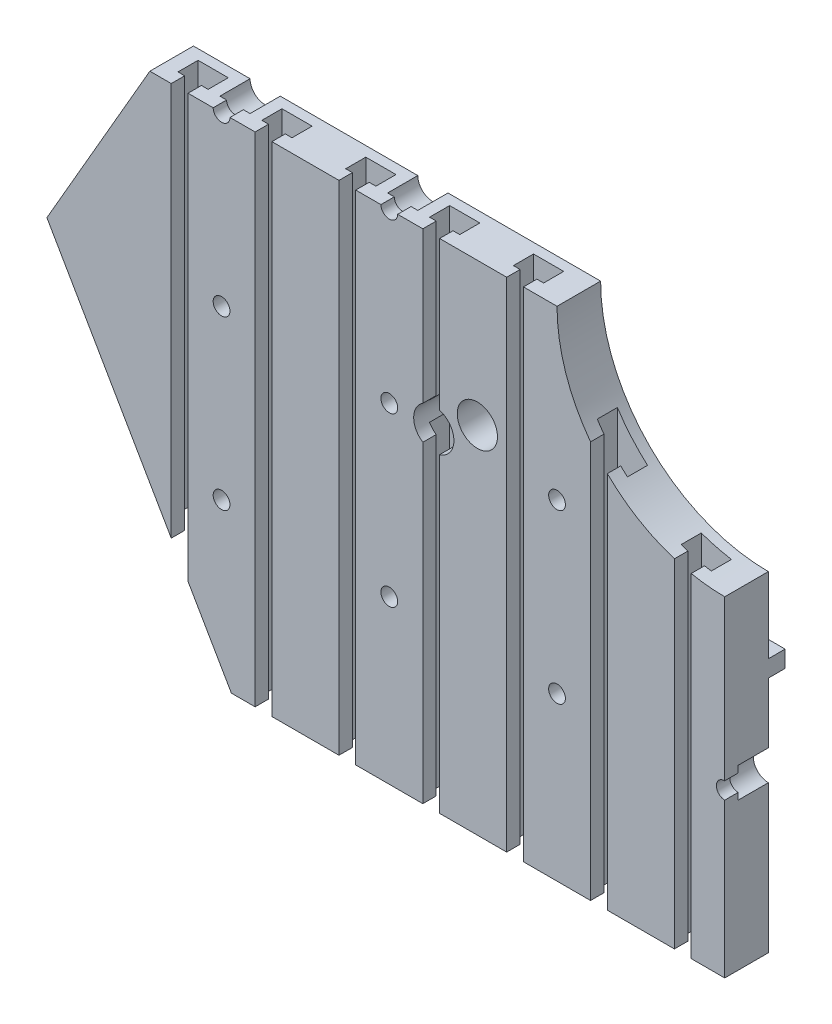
ISO-10303-21;
HEADER;
FILE_DESCRIPTION(('STEP AP214'),'2;1');
FILE_NAME('part.step','',(''),(''),'','','');
FILE_SCHEMA(('AUTOMOTIVE_DESIGN { 1 0 10303 214 1 1 1 1 }'));
ENDSEC;
DATA;
#1=APPLICATION_CONTEXT('core data for automotive mechanical design processes');
#2=APPLICATION_PROTOCOL_DEFINITION('international standard','automotive_design',2000,#1);
#3=PRODUCT_CONTEXT('',#1,'mechanical');
#4=PRODUCT('Part','Part','',(#3));
#5=PRODUCT_RELATED_PRODUCT_CATEGORY('part','',(#4));
#6=PRODUCT_DEFINITION_FORMATION('','',#4);
#7=PRODUCT_DEFINITION_CONTEXT('part definition',#1,'design');
#8=PRODUCT_DEFINITION('design','',#6,#7);
#9=PRODUCT_DEFINITION_SHAPE('','',#8);
#10=(LENGTH_UNIT() NAMED_UNIT(*) SI_UNIT(.MILLI.,.METRE.));
#11=(NAMED_UNIT(*) PLANE_ANGLE_UNIT() SI_UNIT($,.RADIAN.));
#12=(NAMED_UNIT(*) SI_UNIT($,.STERADIAN.) SOLID_ANGLE_UNIT());
#13=UNCERTAINTY_MEASURE_WITH_UNIT(LENGTH_MEASURE(1.E-05),#10,'distance_accuracy_value','');
#14=(GEOMETRIC_REPRESENTATION_CONTEXT(3) GLOBAL_UNCERTAINTY_ASSIGNED_CONTEXT((#13)) GLOBAL_UNIT_ASSIGNED_CONTEXT((#10,
#11,#12)) REPRESENTATION_CONTEXT('',''));
#15=CARTESIAN_POINT('',(0.,0.,0.));
#16=DIRECTION('',(0.,0.,1.));
#17=DIRECTION('',(1.,0.,0.));
#18=AXIS2_PLACEMENT_3D('',#15,#16,#17);
#19=CARTESIAN_POINT('',(-92.,-148.421931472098,3.));
#20=DIRECTION('',(-1.,0.,0.));
#21=DIRECTION('',(0.,0.,1.));
#22=AXIS2_PLACEMENT_3D('',#19,#20,#21);
#23=PLANE('',#22);
#24=DIRECTION('',(0.,0.,-1.));
#25=VECTOR('',#24,1.);
#26=CARTESIAN_POINT('',(-92.,0.,2.99999999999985));
#27=LINE('',#26,#25);
#28=CARTESIAN_POINT('',(-92.,0.,9.));
#29=VERTEX_POINT('',#28);
#30=CARTESIAN_POINT('',(-92.,0.,3.));
#31=VERTEX_POINT('',#30);
#32=EDGE_CURVE('E1288',#29,#31,#27,.T.);
#33=ORIENTED_EDGE('',*,*,#32,.F.);
#34=DIRECTION('',(0.,1.,0.));
#35=VECTOR('',#34,1.);
#36=CARTESIAN_POINT('',(-92.,-148.421931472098,9.));
#37=LINE('',#36,#35);
#38=CARTESIAN_POINT('',(-92.,-47.2022215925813,9.));
#39=VERTEX_POINT('',#38);
#40=EDGE_CURVE('E833',#39,#29,#37,.T.);
#41=ORIENTED_EDGE('',*,*,#40,.F.);
#42=DIRECTION('',(0.,0.,-1.));
#43=VECTOR('',#42,1.);
#44=CARTESIAN_POINT('',(-92.,-47.2022215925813,-5.));
#45=LINE('',#44,#43);
#46=CARTESIAN_POINT('',(-92.,-47.2022215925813,3.));
#47=VERTEX_POINT('',#46);
#48=EDGE_CURVE('E1457',#47,#39,#45,.F.);
#49=ORIENTED_EDGE('',*,*,#48,.F.);
#50=DIRECTION('',(0.,1.,0.));
#51=VECTOR('',#50,1.);
#52=CARTESIAN_POINT('',(-92.,-148.421931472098,3.));
#53=LINE('',#52,#51);
#54=EDGE_CURVE('E838',#47,#31,#53,.T.);
#55=ORIENTED_EDGE('',*,*,#54,.T.);
#56=EDGE_LOOP('',(#33,#41,#49,#55));
#57=FACE_BOUND('',#56,.T.);
#58=ADVANCED_FACE('F47',(#57),#23,.F.);
#59=CARTESIAN_POINT('',(-83.,-148.421931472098,3.));
#60=DIRECTION('',(1.,0.,0.));
#61=DIRECTION('',(0.,0.,-1.));
#62=AXIS2_PLACEMENT_3D('',#59,#60,#61);
#63=PLANE('',#62);
#64=DIRECTION('',(0.,0.,1.));
#65=VECTOR('',#64,1.);
#66=CARTESIAN_POINT('',(-83.,0.,2.99999999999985));
#67=LINE('',#66,#65);
#68=CARTESIAN_POINT('',(-83.,0.,3.));
#69=VERTEX_POINT('',#68);
#70=CARTESIAN_POINT('',(-83.,0.,9.));
#71=VERTEX_POINT('',#70);
#72=EDGE_CURVE('E1294',#69,#71,#67,.T.);
#73=ORIENTED_EDGE('',*,*,#72,.F.);
#74=DIRECTION('',(0.,1.,0.));
#75=VECTOR('',#74,1.);
#76=CARTESIAN_POINT('',(-83.,-148.421931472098,3.));
#77=LINE('',#76,#75);
#78=CARTESIAN_POINT('',(-83.,-45.377249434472,3.));
#79=VERTEX_POINT('',#78);
#80=EDGE_CURVE('E843',#79,#69,#77,.T.);
#81=ORIENTED_EDGE('',*,*,#80,.F.);
#82=DIRECTION('',(0.,0.,-1.));
#83=VECTOR('',#82,1.);
#84=CARTESIAN_POINT('',(-83.,-45.377249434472,-5.));
#85=LINE('',#84,#83);
#86=CARTESIAN_POINT('',(-83.,-45.377249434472,9.));
#87=VERTEX_POINT('',#86);
#88=EDGE_CURVE('E1472',#87,#79,#85,.T.);
#89=ORIENTED_EDGE('',*,*,#88,.F.);
#90=DIRECTION('',(0.,1.,0.));
#91=VECTOR('',#90,1.);
#92=CARTESIAN_POINT('',(-83.,-148.421931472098,9.));
#93=LINE('',#92,#91);
#94=EDGE_CURVE('E848',#87,#71,#93,.T.);
#95=ORIENTED_EDGE('',*,*,#94,.T.);
#96=EDGE_LOOP('',(#73,#81,#89,#95));
#97=FACE_BOUND('',#96,.T.);
#98=ADVANCED_FACE('F1897',(#97),#63,.F.);
#99=CARTESIAN_POINT('',(-85.,-148.421931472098,9.));
#100=DIRECTION('',(1.,0.,0.));
#101=DIRECTION('',(0.,0.,-1.));
#102=AXIS2_PLACEMENT_3D('',#99,#100,#101);
#103=PLANE('',#102);
#104=DIRECTION('',(0.,0.,1.));
#105=VECTOR('',#104,1.);
#106=CARTESIAN_POINT('',(-85.,0.,8.99999999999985));
#107=LINE('',#106,#105);
#108=CARTESIAN_POINT('',(-85.,0.,9.));
#109=VERTEX_POINT('',#108);
#110=CARTESIAN_POINT('',(-85.,0.,13.0000000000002));
#111=VERTEX_POINT('',#110);
#112=EDGE_CURVE('E1300',#109,#111,#107,.T.);
#113=ORIENTED_EDGE('',*,*,#112,.F.);
#114=DIRECTION('',(0.,1.,0.));
#115=VECTOR('',#114,1.);
#116=CARTESIAN_POINT('',(-85.,-148.421931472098,9.));
#117=LINE('',#116,#115);
#118=CARTESIAN_POINT('',(-85.,-44.3305559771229,9.));
#119=VERTEX_POINT('',#118);
#120=EDGE_CURVE('E853',#119,#109,#117,.T.);
#121=ORIENTED_EDGE('',*,*,#120,.F.);
#122=DIRECTION('',(0.,0.,-1.));
#123=VECTOR('',#122,1.);
#124=CARTESIAN_POINT('',(-85.,-44.3305559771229,-5.));
#125=LINE('',#124,#123);
#126=CARTESIAN_POINT('',(-85.,-44.3305559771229,13.));
#127=VERTEX_POINT('',#126);
#128=EDGE_CURVE('E1466',#127,#119,#125,.T.);
#129=ORIENTED_EDGE('',*,*,#128,.F.);
#130=DIRECTION('',(0.,1.,0.));
#131=VECTOR('',#130,1.);
#132=CARTESIAN_POINT('',(-85.,-148.421931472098,13.));
#133=LINE('',#132,#131);
#134=EDGE_CURVE('E858',#127,#111,#133,.T.);
#135=ORIENTED_EDGE('',*,*,#134,.T.);
#136=EDGE_LOOP('',(#113,#121,#129,#135));
#137=FACE_BOUND('',#136,.T.);
#138=ADVANCED_FACE('F1904',(#137),#103,.F.);
#139=CARTESIAN_POINT('',(-90.,-148.421931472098,9.));
#140=DIRECTION('',(-1.,0.,0.));
#141=DIRECTION('',(0.,0.,1.));
#142=AXIS2_PLACEMENT_3D('',#139,#140,#141);
#143=PLANE('',#142);
#144=DIRECTION('',(0.,0.,-1.));
#145=VECTOR('',#144,1.);
#146=CARTESIAN_POINT('',(-90.,0.,8.99999999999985));
#147=LINE('',#146,#145);
#148=CARTESIAN_POINT('',(-90.,0.,13.0000000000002));
#149=VERTEX_POINT('',#148);
#150=CARTESIAN_POINT('',(-90.,0.,9.));
#151=VERTEX_POINT('',#150);
#152=EDGE_CURVE('E1285',#149,#151,#147,.T.);
#153=ORIENTED_EDGE('',*,*,#152,.F.);
#154=DIRECTION('',(0.,1.,0.));
#155=VECTOR('',#154,1.);
#156=CARTESIAN_POINT('',(-90.,-148.421931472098,13.));
#157=LINE('',#156,#155);
#158=CARTESIAN_POINT('',(-90.,-45.0427958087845,13.));
#159=VERTEX_POINT('',#158);
#160=EDGE_CURVE('E862',#159,#149,#157,.T.);
#161=ORIENTED_EDGE('',*,*,#160,.F.);
#162=DIRECTION('',(0.,0.,-1.));
#163=VECTOR('',#162,1.);
#164=CARTESIAN_POINT('',(-90.,-45.0427958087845,-5.));
#165=LINE('',#164,#163);
#166=CARTESIAN_POINT('',(-90.,-45.0427958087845,9.));
#167=VERTEX_POINT('',#166);
#168=EDGE_CURVE('E1454',#167,#159,#165,.F.);
#169=ORIENTED_EDGE('',*,*,#168,.F.);
#170=DIRECTION('',(0.,1.,0.));
#171=VECTOR('',#170,1.);
#172=CARTESIAN_POINT('',(-90.,-148.421931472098,9.));
#173=LINE('',#172,#171);
#174=EDGE_CURVE('E867',#167,#151,#173,.T.);
#175=ORIENTED_EDGE('',*,*,#174,.T.);
#176=EDGE_LOOP('',(#153,#161,#169,#175));
#177=FACE_BOUND('',#176,.T.);
#178=ADVANCED_FACE('F1659',(#177),#143,.F.);
#179=CARTESIAN_POINT('',(0.,0.,0.));
#180=DIRECTION('',(0.,0.,-1.));
#181=DIRECTION('',(-1.,0.,0.));
#182=AXIS2_PLACEMENT_3D('',#179,#180,#181);
#183=PLANE('',#182);
#184=DIRECTION('',(0.499999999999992,-0.866025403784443,0.));
#185=VECTOR('',#184,1.);
#186=CARTESIAN_POINT('',(-72.6619361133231,-34.4458348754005,0.));
#187=LINE('',#186,#185);
#188=CARTESIAN_POINT('',(-72.6619361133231,-34.4458348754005,0.));
#189=VERTEX_POINT('',#188);
#190=CARTESIAN_POINT('',(-66.1619361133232,-45.7041651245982,0.));
#191=VERTEX_POINT('',#190);
#192=EDGE_CURVE('E1517',#189,#191,#187,.T.);
#193=ORIENTED_EDGE('',*,*,#192,.F.);
#194=DIRECTION('',(0.866025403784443,0.499999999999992,0.));
#195=VECTOR('',#194,1.);
#196=CARTESIAN_POINT('',(-94.3125712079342,-46.9458348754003,0.));
#197=LINE('',#196,#195);
#198=CARTESIAN_POINT('',(-94.3125712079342,-46.9458348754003,0.));
#199=VERTEX_POINT('',#198);
#200=EDGE_CURVE('E1498',#199,#189,#197,.T.);
#201=ORIENTED_EDGE('',*,*,#200,.F.);
#202=DIRECTION('',(-0.499999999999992,0.866025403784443,0.));
#203=VECTOR('',#202,1.);
#204=CARTESIAN_POINT('',(-94.3125712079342,-46.9458348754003,0.));
#205=LINE('',#204,#203);
#206=CARTESIAN_POINT('',(-87.8125712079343,-58.204165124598,0.));
#207=VERTEX_POINT('',#206);
#208=EDGE_CURVE('E1504',#207,#199,#205,.T.);
#209=ORIENTED_EDGE('',*,*,#208,.F.);
#210=DIRECTION('',(-0.866025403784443,-0.499999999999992,0.));
#211=VECTOR('',#210,1.);
#212=CARTESIAN_POINT('',(-87.8125712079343,-58.204165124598,0.));
#213=LINE('',#212,#211);
#214=EDGE_CURVE('E1520',#191,#207,#213,.T.);
#215=ORIENTED_EDGE('',*,*,#214,.F.);
#216=EDGE_LOOP('',(#193,#201,#209,#215));
#217=FACE_BOUND('',#216,.T.);
#218=CARTESIAN_POINT('',(-50.,-50.,0.));
#219=DIRECTION('',(0.,0.,-1.));
#220=DIRECTION('',(-1.,0.,0.));
#221=AXIS2_PLACEMENT_3D('',#218,#219,#220);
#222=CIRCLE('',#221,4.5);
#223=CARTESIAN_POINT('',(-54.5,-50.,0.));
#224=VERTEX_POINT('',#223);
#225=EDGE_CURVE('E1619',#224,#224,#222,.T.);
#226=ORIENTED_EDGE('',*,*,#225,.F.);
#227=EDGE_LOOP('',(#226));
#228=FACE_BOUND('',#227,.T.);
#229=CARTESIAN_POINT('',(-100.,-50.,0.));
#230=DIRECTION('',(0.,0.,-1.));
#231=DIRECTION('',(-1.,0.,0.));
#232=AXIS2_PLACEMENT_3D('',#229,#230,#231);
#233=CIRCLE('',#232,4.5);
#234=CARTESIAN_POINT('',(-104.5,-50.,0.));
#235=VERTEX_POINT('',#234);
#236=EDGE_CURVE('E1603',#235,#235,#233,.T.);
#237=ORIENTED_EDGE('',*,*,#236,.F.);
#238=EDGE_LOOP('',(#237));
#239=FACE_BOUND('',#238,.T.);
#240=CARTESIAN_POINT('',(-150.,-50.,0.));
#241=DIRECTION('',(0.,0.,-1.));
#242=DIRECTION('',(-1.,0.,0.));
#243=AXIS2_PLACEMENT_3D('',#240,#241,#242);
#244=CIRCLE('',#243,4.5);
#245=CARTESIAN_POINT('',(-154.5,-50.,0.));
#246=VERTEX_POINT('',#245);
#247=EDGE_CURVE('E1587',#246,#246,#244,.T.);
#248=ORIENTED_EDGE('',*,*,#247,.F.);
#249=EDGE_LOOP('',(#248));
#250=FACE_BOUND('',#249,.T.);
#251=CARTESIAN_POINT('',(-50.,-100.,0.));
#252=DIRECTION('',(0.,0.,-1.));
#253=DIRECTION('',(-1.,0.,0.));
#254=AXIS2_PLACEMENT_3D('',#251,#252,#253);
#255=CIRCLE('',#254,4.5);
#256=CARTESIAN_POINT('',(-54.5,-100.,0.));
#257=VERTEX_POINT('',#256);
#258=EDGE_CURVE('E1571',#257,#257,#255,.T.);
#259=ORIENTED_EDGE('',*,*,#258,.F.);
#260=EDGE_LOOP('',(#259));
#261=FACE_BOUND('',#260,.T.);
#262=CARTESIAN_POINT('',(-100.,-100.,0.));
#263=DIRECTION('',(0.,0.,-1.));
#264=DIRECTION('',(-1.,0.,0.));
#265=AXIS2_PLACEMENT_3D('',#262,#263,#264);
#266=CIRCLE('',#265,4.5);
#267=CARTESIAN_POINT('',(-104.5,-100.,0.));
#268=VERTEX_POINT('',#267);
#269=EDGE_CURVE('E1555',#268,#268,#266,.T.);
#270=ORIENTED_EDGE('',*,*,#269,.F.);
#271=EDGE_LOOP('',(#270));
#272=FACE_BOUND('',#271,.T.);
#273=CARTESIAN_POINT('',(-150.,-100.,0.));
#274=DIRECTION('',(0.,0.,-1.));
#275=DIRECTION('',(-1.,0.,0.));
#276=AXIS2_PLACEMENT_3D('',#273,#274,#275);
#277=CIRCLE('',#276,4.5);
#278=CARTESIAN_POINT('',(-154.5,-100.,0.));
#279=VERTEX_POINT('',#278);
#280=EDGE_CURVE('E1539',#279,#279,#277,.T.);
#281=ORIENTED_EDGE('',*,*,#280,.F.);
#282=EDGE_LOOP('',(#281));
#283=FACE_BOUND('',#282,.T.);
#284=DIRECTION('',(-0.500000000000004,-0.866025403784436,0.));
#285=VECTOR('',#284,1.);
#286=CARTESIAN_POINT('',(-202.072594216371,-53.1581370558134,0.));
#287=LINE('',#286,#285);
#288=CARTESIAN_POINT('',(-171.381729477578,0.,0.));
#289=VERTEX_POINT('',#288);
#290=CARTESIAN_POINT('',(-202.072594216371,-53.1581370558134,0.));
#291=VERTEX_POINT('',#290);
#292=EDGE_CURVE('E1106',#289,#291,#287,.T.);
#293=ORIENTED_EDGE('',*,*,#292,.F.);
#294=DIRECTION('',(1.,0.,0.));
#295=VECTOR('',#294,1.);
#296=CARTESIAN_POINT('',(0.,0.,0.));
#297=LINE('',#296,#295);
#298=CARTESIAN_POINT('',(-154.5,0.,0.));
#299=VERTEX_POINT('',#298);
#300=EDGE_CURVE('E1167',#289,#299,#297,.T.);
#301=ORIENTED_EDGE('',*,*,#300,.T.);
#302=CARTESIAN_POINT('',(-150.,0.,0.));
#303=DIRECTION('',(0.,0.,-1.));
#304=DIRECTION('',(-1.,0.,0.));
#305=AXIS2_PLACEMENT_3D('',#302,#303,#304);
#306=CIRCLE('',#305,4.5);
#307=CARTESIAN_POINT('',(-145.5,0.,0.));
#308=VERTEX_POINT('',#307);
#309=EDGE_CURVE('E1173',#308,#299,#306,.T.);
#310=ORIENTED_EDGE('',*,*,#309,.F.);
#311=CARTESIAN_POINT('',(-104.5,0.,0.));
#312=VERTEX_POINT('',#311);
#313=EDGE_CURVE('E72',#308,#312,#297,.T.);
#314=ORIENTED_EDGE('',*,*,#313,.T.);
#315=CARTESIAN_POINT('',(-100.,0.,0.));
#316=DIRECTION('',(0.,0.,-1.));
#317=DIRECTION('',(-1.,0.,0.));
#318=AXIS2_PLACEMENT_3D('',#315,#316,#317);
#319=CIRCLE('',#318,4.5);
#320=CARTESIAN_POINT('',(-95.5,0.,0.));
#321=VERTEX_POINT('',#320);
#322=EDGE_CURVE('E1186',#321,#312,#319,.T.);
#323=ORIENTED_EDGE('',*,*,#322,.F.);
#324=CARTESIAN_POINT('',(-50.,0.,0.));
#325=VERTEX_POINT('',#324);
#326=EDGE_CURVE('E1242',#321,#325,#297,.T.);
#327=ORIENTED_EDGE('',*,*,#326,.T.);
#328=CARTESIAN_POINT('',(0.,0.,0.));
#329=DIRECTION('',(0.,0.,-1.));
#330=DIRECTION('',(-1.,0.,0.));
#331=AXIS2_PLACEMENT_3D('',#328,#329,#330);
#332=CIRCLE('',#331,50.);
#333=CARTESIAN_POINT('',(0.,-50.,0.));
#334=VERTEX_POINT('',#333);
#335=EDGE_CURVE('E1418',#334,#325,#332,.T.);
#336=ORIENTED_EDGE('',*,*,#335,.F.);
#337=DIRECTION('',(0.,1.,0.));
#338=VECTOR('',#337,1.);
#339=CARTESIAN_POINT('',(0.,0.,0.));
#340=LINE('',#339,#338);
#341=CARTESIAN_POINT('',(0.,-72.5,0.));
#342=VERTEX_POINT('',#341);
#343=EDGE_CURVE('E1682',#342,#334,#340,.T.);
#344=ORIENTED_EDGE('',*,*,#343,.F.);
#345=DIRECTION('',(-1.,0.,0.));
#346=VECTOR('',#345,1.);
#347=CARTESIAN_POINT('',(107.5,-72.5,0.));
#348=LINE('',#347,#346);
#349=CARTESIAN_POINT('',(-107.5,-72.5,0.));
#350=VERTEX_POINT('',#349);
#351=EDGE_CURVE('E1430',#342,#350,#348,.T.);
#352=ORIENTED_EDGE('',*,*,#351,.T.);
#353=DIRECTION('',(0.,-1.,0.));
#354=VECTOR('',#353,1.);
#355=CARTESIAN_POINT('',(-107.5,-72.5,0.));
#356=LINE('',#355,#354);
#357=CARTESIAN_POINT('',(-107.5,-77.5,0.));
#358=VERTEX_POINT('',#357);
#359=EDGE_CURVE('E1433',#350,#358,#356,.T.);
#360=ORIENTED_EDGE('',*,*,#359,.T.);
#361=DIRECTION('',(-1.,0.,0.));
#362=VECTOR('',#361,1.);
#363=CARTESIAN_POINT('',(107.5,-77.5,0.));
#364=LINE('',#363,#362);
#365=CARTESIAN_POINT('',(0.,-77.5,0.));
#366=VERTEX_POINT('',#365);
#367=EDGE_CURVE('E1421',#366,#358,#364,.T.);
#368=ORIENTED_EDGE('',*,*,#367,.F.);
#369=CARTESIAN_POINT('',(0.,-95.5,0.));
#370=VERTEX_POINT('',#369);
#371=EDGE_CURVE('E1689',#370,#366,#340,.T.);
#372=ORIENTED_EDGE('',*,*,#371,.F.);
#373=CARTESIAN_POINT('',(0.,-100.,0.));
#374=DIRECTION('',(0.,0.,-1.));
#375=DIRECTION('',(-1.,0.,0.));
#376=AXIS2_PLACEMENT_3D('',#373,#374,#375);
#377=CIRCLE('',#376,4.5);
#378=CARTESIAN_POINT('',(0.,-104.5,0.));
#379=VERTEX_POINT('',#378);
#380=EDGE_CURVE('E1202',#379,#370,#377,.T.);
#381=ORIENTED_EDGE('',*,*,#380,.F.);
#382=CARTESIAN_POINT('',(1.28587913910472E-13,-148.420931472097,0.));
#383=VERTEX_POINT('',#382);
#384=EDGE_CURVE('E64',#383,#379,#340,.T.);
#385=ORIENTED_EDGE('',*,*,#384,.F.);
#386=DIRECTION('',(1.,0.,0.));
#387=VECTOR('',#386,1.);
#388=CARTESIAN_POINT('',(-147.07259421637,-148.420931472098,0.));
#389=LINE('',#388,#387);
#390=CARTESIAN_POINT('',(-147.07259421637,-148.420931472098,0.));
#391=VERTEX_POINT('',#390);
#392=EDGE_CURVE('E626',#391,#383,#389,.T.);
#393=ORIENTED_EDGE('',*,*,#392,.F.);
#394=DIRECTION('',(0.500000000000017,-0.866025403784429,0.));
#395=VECTOR('',#394,1.);
#396=CARTESIAN_POINT('',(-147.07259421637,-148.420931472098,0.));
#397=LINE('',#396,#395);
#398=EDGE_CURVE('E1115',#291,#391,#397,.T.);
#399=ORIENTED_EDGE('',*,*,#398,.F.);
#400=EDGE_LOOP('',(#293,#301,#310,#314,#323,#327,#336,#344,#352,#360,#368,#372,#381,#385,#393,#399));
#401=FACE_BOUND('',#400,.T.);
#402=ADVANCED_FACE('F1656',(#217,#228,#239,#250,#261,#272,#283,#401),#183,.T.);
#403=CARTESIAN_POINT('',(0.,0.,13.));
#404=DIRECTION('',(0.,0.,-1.));
#405=DIRECTION('',(-1.,0.,0.));
#406=AXIS2_PLACEMENT_3D('',#403,#404,#405);
#407=PLANE('',#406);
#408=CARTESIAN_POINT('',(-50.,-50.,13.));
#409=DIRECTION('',(0.,0.,-1.));
#410=DIRECTION('',(-1.,0.,0.));
#411=AXIS2_PLACEMENT_3D('',#408,#409,#410);
#412=CIRCLE('',#411,2.5);
#413=CARTESIAN_POINT('',(-52.5,-50.,13.));
#414=VERTEX_POINT('',#413);
#415=EDGE_CURVE('E1179',#414,#414,#412,.T.);
#416=ORIENTED_EDGE('',*,*,#415,.T.);
#417=EDGE_LOOP('',(#416));
#418=FACE_BOUND('',#417,.T.);
#419=CARTESIAN_POINT('',(-50.,-100.,13.));
#420=DIRECTION('',(0.,0.,-1.));
#421=DIRECTION('',(-1.,0.,0.));
#422=AXIS2_PLACEMENT_3D('',#419,#420,#421);
#423=CIRCLE('',#422,2.5);
#424=CARTESIAN_POINT('',(-52.5,-100.,13.));
#425=VERTEX_POINT('',#424);
#426=EDGE_CURVE('E1583',#425,#425,#423,.T.);
#427=ORIENTED_EDGE('',*,*,#426,.T.);
#428=EDGE_LOOP('',(#427));
#429=FACE_BOUND('',#428,.T.);
#430=DIRECTION('',(1.,0.,0.));
#431=VECTOR('',#430,1.);
#432=CARTESIAN_POINT('',(0.,0.,13.0000000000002));
#433=LINE('',#432,#431);
#434=CARTESIAN_POINT('',(-60.,0.,13.0000000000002));
#435=VERTEX_POINT('',#434);
#436=CARTESIAN_POINT('',(-50.,0.,13.0000000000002));
#437=VERTEX_POINT('',#436);
#438=EDGE_CURVE('E1730',#435,#437,#433,.T.);
#439=ORIENTED_EDGE('',*,*,#438,.F.);
#440=DIRECTION('',(0.,1.,0.));
#441=VECTOR('',#440,1.);
#442=CARTESIAN_POINT('',(-60.,-148.421931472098,13.));
#443=LINE('',#442,#441);
#444=CARTESIAN_POINT('',(-60.,-148.420931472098,13.));
#445=VERTEX_POINT('',#444);
#446=EDGE_CURVE('E683',#445,#435,#443,.T.);
#447=ORIENTED_EDGE('',*,*,#446,.F.);
#448=DIRECTION('',(1.,0.,0.));
#449=VECTOR('',#448,1.);
#450=CARTESIAN_POINT('',(-147.07259421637,-148.420931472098,13.));
#451=LINE('',#450,#449);
#452=CARTESIAN_POINT('',(-40.,-148.420931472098,13.));
#453=VERTEX_POINT('',#452);
#454=EDGE_CURVE('E644',#445,#453,#451,.T.);
#455=ORIENTED_EDGE('',*,*,#454,.T.);
#456=DIRECTION('',(0.,1.,0.));
#457=VECTOR('',#456,1.);
#458=CARTESIAN_POINT('',(-40.,-148.421931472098,13.));
#459=LINE('',#458,#457);
#460=CARTESIAN_POINT('',(-40.,-30.,13.0000000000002));
#461=VERTEX_POINT('',#460);
#462=EDGE_CURVE('E681',#453,#461,#459,.T.);
#463=ORIENTED_EDGE('',*,*,#462,.T.);
#464=CARTESIAN_POINT('',(0.,0.,13.0000000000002));
#465=DIRECTION('',(0.,0.,-1.));
#466=DIRECTION('',(0.,1.,0.));
#467=AXIS2_PLACEMENT_3D('',#464,#465,#466);
#468=CIRCLE('',#467,50.);
#469=EDGE_CURVE('E615',#461,#437,#468,.T.);
#470=ORIENTED_EDGE('',*,*,#469,.T.);
#471=EDGE_LOOP('',(#439,#447,#455,#463,#470));
#472=FACE_BOUND('',#471,.T.);
#473=ADVANCED_FACE('F679',(#418,#429,#472),#407,.F.);
#474=CARTESIAN_POINT('',(-73.7420631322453,-42.5749999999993,13.));
#475=DIRECTION('',(0.,0.,-1.));
#476=DIRECTION('',(0.499999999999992,-0.866025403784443,0.));
#477=AXIS2_PLACEMENT_3D('',#474,#475,#476);
#478=CIRCLE('',#477,6.00000000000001);
#479=CARTESIAN_POINT('',(-70.7420631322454,-47.771152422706,13.));
#480=VERTEX_POINT('',#479);
#481=EDGE_CURVE('E1482',#480,#480,#478,.T.);
#482=ORIENTED_EDGE('',*,*,#481,.T.);
#483=EDGE_LOOP('',(#482));
#484=FACE_BOUND('',#483,.T.);
#485=CARTESIAN_POINT('',(-65.,0.,13.0000000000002));
#486=VERTEX_POINT('',#485);
#487=EDGE_CURVE('E1738',#111,#486,#433,.T.);
#488=ORIENTED_EDGE('',*,*,#487,.F.);
#489=ORIENTED_EDGE('',*,*,#134,.F.);
#490=CARTESIAN_POINT('',(-86.732444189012,-50.0749999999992,13.));
#491=DIRECTION('',(0.,0.,-1.));
#492=DIRECTION('',(0.499999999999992,-0.866025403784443,0.));
#493=AXIS2_PLACEMENT_3D('',#490,#491,#492);
#494=CIRCLE('',#493,6.00000000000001);
#495=CARTESIAN_POINT('',(-85.,-55.8194440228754,13.));
#496=VERTEX_POINT('',#495);
#497=EDGE_CURVE('E1437',#127,#496,#494,.T.);
#498=ORIENTED_EDGE('',*,*,#497,.T.);
#499=CARTESIAN_POINT('',(-85.,-148.420931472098,13.));
#500=VERTEX_POINT('',#499);
#501=EDGE_CURVE('E854',#500,#496,#133,.T.);
#502=ORIENTED_EDGE('',*,*,#501,.F.);
#503=CARTESIAN_POINT('',(-65.,-148.420931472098,13.));
#504=VERTEX_POINT('',#503);
#505=EDGE_CURVE('E661',#500,#504,#451,.T.);
#506=ORIENTED_EDGE('',*,*,#505,.T.);
#507=DIRECTION('',(0.,1.,0.));
#508=VECTOR('',#507,1.);
#509=CARTESIAN_POINT('',(-65.,-148.421931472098,13.));
#510=LINE('',#509,#508);
#511=EDGE_CURVE('E799',#504,#486,#510,.T.);
#512=ORIENTED_EDGE('',*,*,#511,.T.);
#513=EDGE_LOOP('',(#488,#489,#498,#502,#506,#512));
#514=FACE_BOUND('',#513,.T.);
#515=ADVANCED_FACE('F1972',(#484,#514),#407,.F.);
#516=CARTESIAN_POINT('',(-100.,-50.,13.));
#517=DIRECTION('',(0.,0.,-1.));
#518=DIRECTION('',(-1.,0.,0.));
#519=AXIS2_PLACEMENT_3D('',#516,#517,#518);
#520=CIRCLE('',#519,2.5);
#521=CARTESIAN_POINT('',(-102.5,-50.,13.));
#522=VERTEX_POINT('',#521);
#523=EDGE_CURVE('E1615',#522,#522,#520,.T.);
#524=ORIENTED_EDGE('',*,*,#523,.T.);
#525=EDGE_LOOP('',(#524));
#526=FACE_BOUND('',#525,.T.);
#527=CARTESIAN_POINT('',(-100.,-100.,13.));
#528=DIRECTION('',(0.,0.,-1.));
#529=DIRECTION('',(-1.,0.,0.));
#530=AXIS2_PLACEMENT_3D('',#527,#528,#529);
#531=CIRCLE('',#530,2.5);
#532=CARTESIAN_POINT('',(-102.5,-100.,13.));
#533=VERTEX_POINT('',#532);
#534=EDGE_CURVE('E1567',#533,#533,#531,.T.);
#535=ORIENTED_EDGE('',*,*,#534,.T.);
#536=EDGE_LOOP('',(#535));
#537=FACE_BOUND('',#536,.T.);
#538=CARTESIAN_POINT('',(-110.,0.,13.0000000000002));
#539=VERTEX_POINT('',#538);
#540=CARTESIAN_POINT('',(-102.5,0.,13.0000000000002));
#541=VERTEX_POINT('',#540);
#542=EDGE_CURVE('E1746',#539,#541,#433,.T.);
#543=ORIENTED_EDGE('',*,*,#542,.F.);
#544=DIRECTION('',(0.,1.,0.));
#545=VECTOR('',#544,1.);
#546=CARTESIAN_POINT('',(-110.,-148.421931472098,13.));
#547=LINE('',#546,#545);
#548=CARTESIAN_POINT('',(-110.,-148.420931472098,13.));
#549=VERTEX_POINT('',#548);
#550=EDGE_CURVE('E916',#549,#539,#547,.T.);
#551=ORIENTED_EDGE('',*,*,#550,.F.);
#552=CARTESIAN_POINT('',(-90.,-148.420931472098,13.));
#553=VERTEX_POINT('',#552);
#554=EDGE_CURVE('E654',#549,#553,#451,.T.);
#555=ORIENTED_EDGE('',*,*,#554,.T.);
#556=CARTESIAN_POINT('',(-90.,-55.1072041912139,13.));
#557=VERTEX_POINT('',#556);
#558=EDGE_CURVE('E859',#553,#557,#157,.T.);
#559=ORIENTED_EDGE('',*,*,#558,.T.);
#560=EDGE_CURVE('E1441',#557,#159,#494,.T.);
#561=ORIENTED_EDGE('',*,*,#560,.T.);
#562=ORIENTED_EDGE('',*,*,#160,.T.);
#563=CARTESIAN_POINT('',(-97.5,0.,13.0000000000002));
#564=VERTEX_POINT('',#563);
#565=EDGE_CURVE('E1742',#564,#149,#433,.T.);
#566=ORIENTED_EDGE('',*,*,#565,.F.);
#567=CARTESIAN_POINT('',(-100.,0.,13.));
#568=DIRECTION('',(0.,0.,-1.));
#569=DIRECTION('',(-1.,0.,0.));
#570=AXIS2_PLACEMENT_3D('',#567,#568,#569);
#571=CIRCLE('',#570,2.5);
#572=EDGE_CURVE('E1198',#564,#541,#571,.T.);
#573=ORIENTED_EDGE('',*,*,#572,.T.);
#574=EDGE_LOOP('',(#543,#551,#555,#559,#561,#562,#566,#573));
#575=FACE_BOUND('',#574,.T.);
#576=ADVANCED_FACE('F1822',(#526,#537,#575),#407,.F.);
#577=CARTESIAN_POINT('',(-135.,0.,13.0000000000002));
#578=VERTEX_POINT('',#577);
#579=CARTESIAN_POINT('',(-115.,0.,13.0000000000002));
#580=VERTEX_POINT('',#579);
#581=EDGE_CURVE('E1750',#578,#580,#433,.T.);
#582=ORIENTED_EDGE('',*,*,#581,.F.);
#583=DIRECTION('',(0.,1.,0.));
#584=VECTOR('',#583,1.);
#585=CARTESIAN_POINT('',(-135.,-148.421931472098,13.));
#586=LINE('',#585,#584);
#587=CARTESIAN_POINT('',(-135.,-148.420931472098,13.));
#588=VERTEX_POINT('',#587);
#589=EDGE_CURVE('E974',#588,#578,#586,.T.);
#590=ORIENTED_EDGE('',*,*,#589,.F.);
#591=CARTESIAN_POINT('',(-115.,-148.420931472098,13.));
#592=VERTEX_POINT('',#591);
#593=EDGE_CURVE('E641',#588,#592,#451,.T.);
#594=ORIENTED_EDGE('',*,*,#593,.T.);
#595=DIRECTION('',(0.,1.,0.));
#596=VECTOR('',#595,1.);
#597=CARTESIAN_POINT('',(-115.,-148.421931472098,13.));
#598=LINE('',#597,#596);
#599=EDGE_CURVE('E920',#592,#580,#598,.T.);
#600=ORIENTED_EDGE('',*,*,#599,.T.);
#601=EDGE_LOOP('',(#582,#590,#594,#600));
#602=FACE_BOUND('',#601,.T.);
#603=ADVANCED_FACE('F1794',(#602),#407,.F.);
#604=CARTESIAN_POINT('',(-150.,-50.,13.));
#605=DIRECTION('',(0.,0.,-1.));
#606=DIRECTION('',(-1.,0.,0.));
#607=AXIS2_PLACEMENT_3D('',#604,#605,#606);
#608=CIRCLE('',#607,2.5);
#609=CARTESIAN_POINT('',(-152.5,-50.,13.));
#610=VERTEX_POINT('',#609);
#611=EDGE_CURVE('E1599',#610,#610,#608,.T.);
#612=ORIENTED_EDGE('',*,*,#611,.T.);
#613=EDGE_LOOP('',(#612));
#614=FACE_BOUND('',#613,.T.);
#615=CARTESIAN_POINT('',(-150.,-100.,13.));
#616=DIRECTION('',(0.,0.,-1.));
#617=DIRECTION('',(-1.,0.,0.));
#618=AXIS2_PLACEMENT_3D('',#615,#616,#617);
#619=CIRCLE('',#618,2.5);
#620=CARTESIAN_POINT('',(-152.5,-100.,13.));
#621=VERTEX_POINT('',#620);
#622=EDGE_CURVE('E1551',#621,#621,#619,.T.);
#623=ORIENTED_EDGE('',*,*,#622,.T.);
#624=EDGE_LOOP('',(#623));
#625=FACE_BOUND('',#624,.T.);
#626=CARTESIAN_POINT('',(-160.,0.,13.0000000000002));
#627=VERTEX_POINT('',#626);
#628=CARTESIAN_POINT('',(-152.5,0.,13.0000000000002));
#629=VERTEX_POINT('',#628);
#630=EDGE_CURVE('E1733',#627,#629,#433,.T.);
#631=ORIENTED_EDGE('',*,*,#630,.F.);
#632=DIRECTION('',(0.,1.,0.));
#633=VECTOR('',#632,1.);
#634=CARTESIAN_POINT('',(-160.,-148.421931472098,13.));
#635=LINE('',#634,#633);
#636=CARTESIAN_POINT('',(-160.,-126.030007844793,13.));
#637=VERTEX_POINT('',#636);
#638=EDGE_CURVE('E1032',#637,#627,#635,.T.);
#639=ORIENTED_EDGE('',*,*,#638,.F.);
#640=DIRECTION('',(0.500000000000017,-0.866025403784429,0.));
#641=VECTOR('',#640,1.);
#642=CARTESIAN_POINT('',(-147.07259421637,-148.420931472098,13.));
#643=LINE('',#642,#641);
#644=CARTESIAN_POINT('',(-147.07259421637,-148.420931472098,13.));
#645=VERTEX_POINT('',#644);
#646=EDGE_CURVE('E646',#637,#645,#643,.T.);
#647=ORIENTED_EDGE('',*,*,#646,.T.);
#648=CARTESIAN_POINT('',(-140.,-148.420931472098,13.));
#649=VERTEX_POINT('',#648);
#650=EDGE_CURVE('E640',#645,#649,#451,.T.);
#651=ORIENTED_EDGE('',*,*,#650,.T.);
#652=DIRECTION('',(0.,1.,0.));
#653=VECTOR('',#652,1.);
#654=CARTESIAN_POINT('',(-140.,-148.421931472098,13.));
#655=LINE('',#654,#653);
#656=CARTESIAN_POINT('',(-140.,0.,13.0000000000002));
#657=VERTEX_POINT('',#656);
#658=EDGE_CURVE('E978',#649,#657,#655,.T.);
#659=ORIENTED_EDGE('',*,*,#658,.T.);
#660=CARTESIAN_POINT('',(-147.5,0.,13.0000000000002));
#661=VERTEX_POINT('',#660);
#662=EDGE_CURVE('E1736',#661,#657,#433,.T.);
#663=ORIENTED_EDGE('',*,*,#662,.F.);
#664=CARTESIAN_POINT('',(-150.,0.,13.));
#665=DIRECTION('',(0.,0.,-1.));
#666=DIRECTION('',(-1.,0.,0.));
#667=AXIS2_PLACEMENT_3D('',#664,#665,#666);
#668=CIRCLE('',#667,2.5);
#669=EDGE_CURVE('E1177',#661,#629,#668,.T.);
#670=ORIENTED_EDGE('',*,*,#669,.T.);
#671=EDGE_LOOP('',(#631,#639,#647,#651,#659,#663,#670));
#672=FACE_BOUND('',#671,.T.);
#673=ADVANCED_FACE('F1766',(#614,#625,#672),#407,.F.);
#674=CARTESIAN_POINT('',(-202.072594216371,-53.1581370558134,13.));
#675=DIRECTION('',(0.866025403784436,-0.500000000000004,0.));
#676=DIRECTION('',(0.500000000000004,0.866025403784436,0.));
#677=AXIS2_PLACEMENT_3D('',#674,#675,#676);
#678=PLANE('',#677);
#679=DIRECTION('',(0.,0.,-1.));
#680=VECTOR('',#679,1.);
#681=CARTESIAN_POINT('',(-171.381729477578,0.,13.0000000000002));
#682=LINE('',#681,#680);
#683=CARTESIAN_POINT('',(-171.381729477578,0.,13.0000000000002));
#684=VERTEX_POINT('',#683);
#685=EDGE_CURVE('E1679',#684,#289,#682,.T.);
#686=ORIENTED_EDGE('',*,*,#685,.T.);
#687=ORIENTED_EDGE('',*,*,#292,.T.);
#688=DIRECTION('',(0.,0.,-1.));
#689=VECTOR('',#688,1.);
#690=CARTESIAN_POINT('',(-202.072594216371,-53.1581370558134,13.));
#691=LINE('',#690,#689);
#692=CARTESIAN_POINT('',(-202.072594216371,-53.1581370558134,13.));
#693=VERTEX_POINT('',#692);
#694=EDGE_CURVE('E1122',#693,#291,#691,.T.);
#695=ORIENTED_EDGE('',*,*,#694,.F.);
#696=DIRECTION('',(-0.500000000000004,-0.866025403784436,0.));
#697=VECTOR('',#696,1.);
#698=CARTESIAN_POINT('',(-202.072594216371,-53.1581370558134,13.));
#699=LINE('',#698,#697);
#700=EDGE_CURVE('E1107',#684,#693,#699,.T.);
#701=ORIENTED_EDGE('',*,*,#700,.F.);
#702=EDGE_LOOP('',(#686,#687,#695,#701));
#703=FACE_BOUND('',#702,.T.);
#704=ADVANCED_FACE('F1678',(#703),#678,.F.);
#705=CARTESIAN_POINT('',(-165.,0.,13.0000000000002));
#706=VERTEX_POINT('',#705);
#707=EDGE_CURVE('E629',#684,#706,#433,.T.);
#708=ORIENTED_EDGE('',*,*,#707,.F.);
#709=ORIENTED_EDGE('',*,*,#700,.T.);
#710=CARTESIAN_POINT('',(-165.,-117.369753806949,13.));
#711=VERTEX_POINT('',#710);
#712=EDGE_CURVE('E638',#693,#711,#643,.T.);
#713=ORIENTED_EDGE('',*,*,#712,.T.);
#714=DIRECTION('',(0.,1.,0.));
#715=VECTOR('',#714,1.);
#716=CARTESIAN_POINT('',(-165.,-148.421931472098,13.));
#717=LINE('',#716,#715);
#718=EDGE_CURVE('E1036',#711,#706,#717,.T.);
#719=ORIENTED_EDGE('',*,*,#718,.T.);
#720=EDGE_LOOP('',(#708,#709,#713,#719));
#721=FACE_BOUND('',#720,.T.);
#722=ADVANCED_FACE('F2036',(#721),#407,.F.);
#723=CARTESIAN_POINT('',(-167.,-148.421931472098,3.));
#724=DIRECTION('',(-1.,0.,0.));
#725=DIRECTION('',(0.,0.,1.));
#726=AXIS2_PLACEMENT_3D('',#723,#724,#725);
#727=PLANE('',#726);
#728=DIRECTION('',(0.,0.,-1.));
#729=VECTOR('',#728,1.);
#730=CARTESIAN_POINT('',(-167.,0.,2.99999999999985));
#731=LINE('',#730,#729);
#732=CARTESIAN_POINT('',(-167.,0.,9.));
#733=VERTEX_POINT('',#732);
#734=CARTESIAN_POINT('',(-167.,0.,3.));
#735=VERTEX_POINT('',#734);
#736=EDGE_CURVE('E1351',#733,#735,#731,.T.);
#737=ORIENTED_EDGE('',*,*,#736,.F.);
#738=DIRECTION('',(0.,1.,0.));
#739=VECTOR('',#738,1.);
#740=CARTESIAN_POINT('',(-167.,-148.421931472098,9.));
#741=LINE('',#740,#739);
#742=CARTESIAN_POINT('',(-167.,-113.905652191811,9.));
#743=VERTEX_POINT('',#742);
#744=EDGE_CURVE('E1015',#743,#733,#741,.T.);
#745=ORIENTED_EDGE('',*,*,#744,.F.);
#746=DIRECTION('',(0.,0.,-1.));
#747=VECTOR('',#746,1.);
#748=CARTESIAN_POINT('',(-167.,-113.905652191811,3.));
#749=LINE('',#748,#747);
#750=CARTESIAN_POINT('',(-167.,-113.905652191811,3.));
#751=VERTEX_POINT('',#750);
#752=EDGE_CURVE('E996',#743,#751,#749,.T.);
#753=ORIENTED_EDGE('',*,*,#752,.T.);
#754=DIRECTION('',(0.,1.,0.));
#755=VECTOR('',#754,1.);
#756=CARTESIAN_POINT('',(-167.,-148.421931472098,3.));
#757=LINE('',#756,#755);
#758=EDGE_CURVE('E1016',#751,#735,#757,.T.);
#759=ORIENTED_EDGE('',*,*,#758,.T.);
#760=EDGE_LOOP('',(#737,#745,#753,#759));
#761=FACE_BOUND('',#760,.T.);
#762=ADVANCED_FACE('F2799',(#761),#727,.F.);
#763=CARTESIAN_POINT('',(-158.,-148.421931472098,3.));
#764=DIRECTION('',(0.,0.,-1.));
#765=DIRECTION('',(-1.,0.,0.));
#766=AXIS2_PLACEMENT_3D('',#763,#764,#765);
#767=PLANE('',#766);
#768=DIRECTION('',(1.,0.,0.));
#769=VECTOR('',#768,1.);
#770=CARTESIAN_POINT('',(-158.,0.,3.));
#771=LINE('',#770,#769);
#772=CARTESIAN_POINT('',(-158.,0.,3.));
#773=VERTEX_POINT('',#772);
#774=EDGE_CURVE('E1354',#735,#773,#771,.T.);
#775=ORIENTED_EDGE('',*,*,#774,.F.);
#776=ORIENTED_EDGE('',*,*,#758,.F.);
#777=DIRECTION('',(0.500000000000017,-0.866025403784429,0.));
#778=VECTOR('',#777,1.);
#779=CARTESIAN_POINT('',(-149.804012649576,-143.689975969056,3.));
#780=LINE('',#779,#778);
#781=CARTESIAN_POINT('',(-158.,-129.49410945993,3.));
#782=VERTEX_POINT('',#781);
#783=EDGE_CURVE('E1000',#751,#782,#780,.T.);
#784=ORIENTED_EDGE('',*,*,#783,.T.);
#785=DIRECTION('',(0.,1.,0.));
#786=VECTOR('',#785,1.);
#787=CARTESIAN_POINT('',(-158.,-148.421931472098,3.));
#788=LINE('',#787,#786);
#789=EDGE_CURVE('E1020',#782,#773,#788,.T.);
#790=ORIENTED_EDGE('',*,*,#789,.T.);
#791=EDGE_LOOP('',(#775,#776,#784,#790));
#792=FACE_BOUND('',#791,.T.);
#793=ADVANCED_FACE('F2808',(#792),#767,.F.);
#794=CARTESIAN_POINT('',(-158.,-148.421931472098,3.));
#795=DIRECTION('',(1.,0.,0.));
#796=DIRECTION('',(0.,0.,-1.));
#797=AXIS2_PLACEMENT_3D('',#794,#795,#796);
#798=PLANE('',#797);
#799=DIRECTION('',(0.,0.,1.));
#800=VECTOR('',#799,1.);
#801=CARTESIAN_POINT('',(-158.,0.,2.99999999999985));
#802=LINE('',#801,#800);
#803=CARTESIAN_POINT('',(-158.,0.,9.));
#804=VERTEX_POINT('',#803);
#805=EDGE_CURVE('E1357',#773,#804,#802,.T.);
#806=ORIENTED_EDGE('',*,*,#805,.F.);
#807=ORIENTED_EDGE('',*,*,#789,.F.);
#808=DIRECTION('',(0.,0.,1.));
#809=VECTOR('',#808,1.);
#810=CARTESIAN_POINT('',(-158.,-129.49410945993,3.));
#811=LINE('',#810,#809);
#812=CARTESIAN_POINT('',(-158.,-129.49410945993,9.));
#813=VERTEX_POINT('',#812);
#814=EDGE_CURVE('E1004',#782,#813,#811,.T.);
#815=ORIENTED_EDGE('',*,*,#814,.T.);
#816=DIRECTION('',(0.,1.,0.));
#817=VECTOR('',#816,1.);
#818=CARTESIAN_POINT('',(-158.,-148.421931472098,9.));
#819=LINE('',#818,#817);
#820=EDGE_CURVE('E1024',#813,#804,#819,.T.);
#821=ORIENTED_EDGE('',*,*,#820,.T.);
#822=EDGE_LOOP('',(#806,#807,#815,#821));
#823=FACE_BOUND('',#822,.T.);
#824=ADVANCED_FACE('F2819',(#823),#798,.F.);
#825=CARTESIAN_POINT('',(-158.,-148.421931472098,9.));
#826=DIRECTION('',(0.,0.,1.));
#827=DIRECTION('',(1.,0.,0.));
#828=AXIS2_PLACEMENT_3D('',#825,#826,#827);
#829=PLANE('',#828);
#830=DIRECTION('',(-1.,0.,0.));
#831=VECTOR('',#830,1.);
#832=CARTESIAN_POINT('',(-158.,0.,9.));
#833=LINE('',#832,#831);
#834=CARTESIAN_POINT('',(-160.,0.,9.));
#835=VERTEX_POINT('',#834);
#836=EDGE_CURVE('E1360',#804,#835,#833,.T.);
#837=ORIENTED_EDGE('',*,*,#836,.F.);
#838=ORIENTED_EDGE('',*,*,#820,.F.);
#839=DIRECTION('',(-0.500000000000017,0.866025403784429,0.));
#840=VECTOR('',#839,1.);
#841=CARTESIAN_POINT('',(-149.804012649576,-143.689975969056,9.));
#842=LINE('',#841,#840);
#843=CARTESIAN_POINT('',(-160.,-126.030007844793,9.));
#844=VERTEX_POINT('',#843);
#845=EDGE_CURVE('E1008',#813,#844,#842,.T.);
#846=ORIENTED_EDGE('',*,*,#845,.T.);
#847=DIRECTION('',(0.,1.,0.));
#848=VECTOR('',#847,1.);
#849=CARTESIAN_POINT('',(-160.,-148.421931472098,9.));
#850=LINE('',#849,#848);
#851=EDGE_CURVE('E1028',#844,#835,#850,.T.);
#852=ORIENTED_EDGE('',*,*,#851,.T.);
#853=EDGE_LOOP('',(#837,#838,#846,#852));
#854=FACE_BOUND('',#853,.T.);
#855=ADVANCED_FACE('F2830',(#854),#829,.F.);
#856=CARTESIAN_POINT('',(-160.,-148.421931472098,9.));
#857=DIRECTION('',(1.,0.,0.));
#858=DIRECTION('',(0.,0.,-1.));
#859=AXIS2_PLACEMENT_3D('',#856,#857,#858);
#860=PLANE('',#859);
#861=DIRECTION('',(0.,0.,1.));
#862=VECTOR('',#861,1.);
#863=CARTESIAN_POINT('',(-160.,0.,8.99999999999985));
#864=LINE('',#863,#862);
#865=EDGE_CURVE('E1363',#835,#627,#864,.T.);
#866=ORIENTED_EDGE('',*,*,#865,.F.);
#867=ORIENTED_EDGE('',*,*,#851,.F.);
#868=DIRECTION('',(0.,0.,1.));
#869=VECTOR('',#868,1.);
#870=CARTESIAN_POINT('',(-160.,-126.030007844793,9.00000000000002));
#871=LINE('',#870,#869);
#872=EDGE_CURVE('E1012',#844,#637,#871,.T.);
#873=ORIENTED_EDGE('',*,*,#872,.T.);
#874=ORIENTED_EDGE('',*,*,#638,.T.);
#875=EDGE_LOOP('',(#866,#867,#873,#874));
#876=FACE_BOUND('',#875,.T.);
#877=ADVANCED_FACE('F2841',(#876),#860,.F.);
#878=CARTESIAN_POINT('',(-165.,-148.421931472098,9.));
#879=DIRECTION('',(-1.,0.,0.));
#880=DIRECTION('',(0.,0.,1.));
#881=AXIS2_PLACEMENT_3D('',#878,#879,#880);
#882=PLANE('',#881);
#883=DIRECTION('',(0.,0.,-1.));
#884=VECTOR('',#883,1.);
#885=CARTESIAN_POINT('',(-165.,0.,8.99999999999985));
#886=LINE('',#885,#884);
#887=CARTESIAN_POINT('',(-165.,0.,9.));
#888=VERTEX_POINT('',#887);
#889=EDGE_CURVE('E1348',#706,#888,#886,.T.);
#890=ORIENTED_EDGE('',*,*,#889,.F.);
#891=ORIENTED_EDGE('',*,*,#718,.F.);
#892=DIRECTION('',(0.,0.,-1.));
#893=VECTOR('',#892,1.);
#894=CARTESIAN_POINT('',(-165.,-117.369753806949,9.));
#895=LINE('',#894,#893);
#896=CARTESIAN_POINT('',(-165.,-117.369753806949,9.));
#897=VERTEX_POINT('',#896);
#898=EDGE_CURVE('E992',#711,#897,#895,.T.);
#899=ORIENTED_EDGE('',*,*,#898,.T.);
#900=DIRECTION('',(0.,1.,0.));
#901=VECTOR('',#900,1.);
#902=CARTESIAN_POINT('',(-165.,-148.421931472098,9.));
#903=LINE('',#902,#901);
#904=EDGE_CURVE('E1040',#897,#888,#903,.T.);
#905=ORIENTED_EDGE('',*,*,#904,.T.);
#906=EDGE_LOOP('',(#890,#891,#899,#905));
#907=FACE_BOUND('',#906,.T.);
#908=ADVANCED_FACE('F2852',(#907),#882,.F.);
#909=CARTESIAN_POINT('',(-167.,-148.421931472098,9.));
#910=DIRECTION('',(0.,0.,1.));
#911=DIRECTION('',(1.,0.,0.));
#912=AXIS2_PLACEMENT_3D('',#909,#910,#911);
#913=PLANE('',#912);
#914=DIRECTION('',(-1.,0.,0.));
#915=VECTOR('',#914,1.);
#916=CARTESIAN_POINT('',(-167.,0.,9.));
#917=LINE('',#916,#915);
#918=EDGE_CURVE('E1345',#888,#733,#917,.T.);
#919=ORIENTED_EDGE('',*,*,#918,.F.);
#920=ORIENTED_EDGE('',*,*,#904,.F.);
#921=DIRECTION('',(-0.500000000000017,0.866025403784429,0.));
#922=VECTOR('',#921,1.);
#923=CARTESIAN_POINT('',(-152.054012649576,-139.792861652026,9.));
#924=LINE('',#923,#922);
#925=EDGE_CURVE('E938',#897,#743,#924,.T.);
#926=ORIENTED_EDGE('',*,*,#925,.T.);
#927=ORIENTED_EDGE('',*,*,#744,.T.);
#928=EDGE_LOOP('',(#919,#920,#926,#927));
#929=FACE_BOUND('',#928,.T.);
#930=ADVANCED_FACE('F2863',(#929),#913,.F.);
#931=CARTESIAN_POINT('',(-142.,-148.421931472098,3.));
#932=DIRECTION('',(-1.,0.,0.));
#933=DIRECTION('',(0.,0.,1.));
#934=AXIS2_PLACEMENT_3D('',#931,#932,#933);
#935=PLANE('',#934);
#936=DIRECTION('',(0.,0.,-1.));
#937=VECTOR('',#936,1.);
#938=CARTESIAN_POINT('',(-142.,0.,2.99999999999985));
#939=LINE('',#938,#937);
#940=CARTESIAN_POINT('',(-142.,0.,9.));
#941=VERTEX_POINT('',#940);
#942=CARTESIAN_POINT('',(-142.,0.,3.));
#943=VERTEX_POINT('',#942);
#944=EDGE_CURVE('E1330',#941,#943,#939,.T.);
#945=ORIENTED_EDGE('',*,*,#944,.F.);
#946=DIRECTION('',(0.,1.,0.));
#947=VECTOR('',#946,1.);
#948=CARTESIAN_POINT('',(-142.,-148.421931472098,9.));
#949=LINE('',#948,#947);
#950=CARTESIAN_POINT('',(-142.,-148.420931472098,9.));
#951=VERTEX_POINT('',#950);
#952=EDGE_CURVE('E957',#951,#941,#949,.T.);
#953=ORIENTED_EDGE('',*,*,#952,.F.);
#954=DIRECTION('',(0.,0.,-1.));
#955=VECTOR('',#954,1.);
#956=CARTESIAN_POINT('',(-142.,-148.420931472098,3.));
#957=LINE('',#956,#955);
#958=CARTESIAN_POINT('',(-142.,-148.420931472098,3.));
#959=VERTEX_POINT('',#958);
#960=EDGE_CURVE('E937',#951,#959,#957,.T.);
#961=ORIENTED_EDGE('',*,*,#960,.T.);
#962=DIRECTION('',(0.,1.,0.));
#963=VECTOR('',#962,1.);
#964=CARTESIAN_POINT('',(-142.,-148.421931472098,3.));
#965=LINE('',#964,#963);
#966=EDGE_CURVE('E958',#959,#943,#965,.T.);
#967=ORIENTED_EDGE('',*,*,#966,.T.);
#968=EDGE_LOOP('',(#945,#953,#961,#967));
#969=FACE_BOUND('',#968,.T.);
#970=ADVANCED_FACE('F1779',(#969),#935,.F.);
#971=CARTESIAN_POINT('',(-133.,-148.421931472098,3.));
#972=DIRECTION('',(0.,0.,-1.));
#973=DIRECTION('',(-1.,0.,0.));
#974=AXIS2_PLACEMENT_3D('',#971,#972,#973);
#975=PLANE('',#974);
#976=DIRECTION('',(1.,0.,0.));
#977=VECTOR('',#976,1.);
#978=CARTESIAN_POINT('',(-133.,0.,3.));
#979=LINE('',#978,#977);
#980=CARTESIAN_POINT('',(-133.,0.,3.));
#981=VERTEX_POINT('',#980);
#982=EDGE_CURVE('E1333',#943,#981,#979,.T.);
#983=ORIENTED_EDGE('',*,*,#982,.F.);
#984=ORIENTED_EDGE('',*,*,#966,.F.);
#985=DIRECTION('',(1.,0.,0.));
#986=VECTOR('',#985,1.);
#987=CARTESIAN_POINT('',(-133.,-148.420931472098,3.));
#988=LINE('',#987,#986);
#989=CARTESIAN_POINT('',(-133.,-148.420931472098,3.));
#990=VERTEX_POINT('',#989);
#991=EDGE_CURVE('E942',#959,#990,#988,.T.);
#992=ORIENTED_EDGE('',*,*,#991,.T.);
#993=DIRECTION('',(0.,1.,0.));
#994=VECTOR('',#993,1.);
#995=CARTESIAN_POINT('',(-133.,-148.421931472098,3.));
#996=LINE('',#995,#994);
#997=EDGE_CURVE('E962',#990,#981,#996,.T.);
#998=ORIENTED_EDGE('',*,*,#997,.T.);
#999=EDGE_LOOP('',(#983,#984,#992,#998));
#1000=FACE_BOUND('',#999,.T.);
#1001=ADVANCED_FACE('F1781',(#1000),#975,.F.);
#1002=CARTESIAN_POINT('',(-133.,-148.421931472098,3.));
#1003=DIRECTION('',(1.,0.,0.));
#1004=DIRECTION('',(0.,0.,-1.));
#1005=AXIS2_PLACEMENT_3D('',#1002,#1003,#1004);
#1006=PLANE('',#1005);
#1007=DIRECTION('',(0.,0.,1.));
#1008=VECTOR('',#1007,1.);
#1009=CARTESIAN_POINT('',(-133.,0.,2.99999999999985));
#1010=LINE('',#1009,#1008);
#1011=CARTESIAN_POINT('',(-133.,0.,9.));
#1012=VERTEX_POINT('',#1011);
#1013=EDGE_CURVE('E1336',#981,#1012,#1010,.T.);
#1014=ORIENTED_EDGE('',*,*,#1013,.F.);
#1015=ORIENTED_EDGE('',*,*,#997,.F.);
#1016=DIRECTION('',(0.,0.,1.));
#1017=VECTOR('',#1016,1.);
#1018=CARTESIAN_POINT('',(-133.,-148.420931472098,3.));
#1019=LINE('',#1018,#1017);
#1020=CARTESIAN_POINT('',(-133.,-148.420931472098,9.));
#1021=VERTEX_POINT('',#1020);
#1022=EDGE_CURVE('E946',#990,#1021,#1019,.T.);
#1023=ORIENTED_EDGE('',*,*,#1022,.T.);
#1024=DIRECTION('',(0.,1.,0.));
#1025=VECTOR('',#1024,1.);
#1026=CARTESIAN_POINT('',(-133.,-148.421931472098,9.));
#1027=LINE('',#1026,#1025);
#1028=EDGE_CURVE('E966',#1021,#1012,#1027,.T.);
#1029=ORIENTED_EDGE('',*,*,#1028,.T.);
#1030=EDGE_LOOP('',(#1014,#1015,#1023,#1029));
#1031=FACE_BOUND('',#1030,.T.);
#1032=ADVANCED_FACE('F1786',(#1031),#1006,.F.);
#1033=CARTESIAN_POINT('',(-133.,-148.421931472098,9.));
#1034=DIRECTION('',(0.,0.,1.));
#1035=DIRECTION('',(1.,0.,0.));
#1036=AXIS2_PLACEMENT_3D('',#1033,#1034,#1035);
#1037=PLANE('',#1036);
#1038=DIRECTION('',(-1.,0.,0.));
#1039=VECTOR('',#1038,1.);
#1040=CARTESIAN_POINT('',(-133.,0.,9.));
#1041=LINE('',#1040,#1039);
#1042=CARTESIAN_POINT('',(-135.,0.,9.));
#1043=VERTEX_POINT('',#1042);
#1044=EDGE_CURVE('E1339',#1012,#1043,#1041,.T.);
#1045=ORIENTED_EDGE('',*,*,#1044,.F.);
#1046=ORIENTED_EDGE('',*,*,#1028,.F.);
#1047=DIRECTION('',(-1.,0.,0.));
#1048=VECTOR('',#1047,1.);
#1049=CARTESIAN_POINT('',(-133.,-148.420931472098,9.));
#1050=LINE('',#1049,#1048);
#1051=CARTESIAN_POINT('',(-135.,-148.420931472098,9.));
#1052=VERTEX_POINT('',#1051);
#1053=EDGE_CURVE('E950',#1021,#1052,#1050,.T.);
#1054=ORIENTED_EDGE('',*,*,#1053,.T.);
#1055=DIRECTION('',(0.,1.,0.));
#1056=VECTOR('',#1055,1.);
#1057=CARTESIAN_POINT('',(-135.,-148.421931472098,9.));
#1058=LINE('',#1057,#1056);
#1059=EDGE_CURVE('E970',#1052,#1043,#1058,.T.);
#1060=ORIENTED_EDGE('',*,*,#1059,.T.);
#1061=EDGE_LOOP('',(#1045,#1046,#1054,#1060));
#1062=FACE_BOUND('',#1061,.T.);
#1063=ADVANCED_FACE('F1789',(#1062),#1037,.F.);
#1064=CARTESIAN_POINT('',(-135.,-148.421931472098,9.));
#1065=DIRECTION('',(1.,0.,0.));
#1066=DIRECTION('',(0.,0.,-1.));
#1067=AXIS2_PLACEMENT_3D('',#1064,#1065,#1066);
#1068=PLANE('',#1067);
#1069=DIRECTION('',(0.,0.,1.));
#1070=VECTOR('',#1069,1.);
#1071=CARTESIAN_POINT('',(-135.,0.,8.99999999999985));
#1072=LINE('',#1071,#1070);
#1073=EDGE_CURVE('E1342',#1043,#578,#1072,.T.);
#1074=ORIENTED_EDGE('',*,*,#1073,.F.);
#1075=ORIENTED_EDGE('',*,*,#1059,.F.);
#1076=DIRECTION('',(0.,0.,1.));
#1077=VECTOR('',#1076,1.);
#1078=CARTESIAN_POINT('',(-135.,-148.420931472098,9.));
#1079=LINE('',#1078,#1077);
#1080=EDGE_CURVE('E954',#1052,#588,#1079,.T.);
#1081=ORIENTED_EDGE('',*,*,#1080,.T.);
#1082=ORIENTED_EDGE('',*,*,#589,.T.);
#1083=EDGE_LOOP('',(#1074,#1075,#1081,#1082));
#1084=FACE_BOUND('',#1083,.T.);
#1085=ADVANCED_FACE('F1793',(#1084),#1068,.F.);
#1086=CARTESIAN_POINT('',(-140.,-148.421931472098,9.));
#1087=DIRECTION('',(-1.,0.,0.));
#1088=DIRECTION('',(0.,0.,1.));
#1089=AXIS2_PLACEMENT_3D('',#1086,#1087,#1088);
#1090=PLANE('',#1089);
#1091=DIRECTION('',(0.,0.,-1.));
#1092=VECTOR('',#1091,1.);
#1093=CARTESIAN_POINT('',(-140.,0.,8.99999999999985));
#1094=LINE('',#1093,#1092);
#1095=CARTESIAN_POINT('',(-140.,0.,9.));
#1096=VERTEX_POINT('',#1095);
#1097=EDGE_CURVE('E1327',#657,#1096,#1094,.T.);
#1098=ORIENTED_EDGE('',*,*,#1097,.F.);
#1099=ORIENTED_EDGE('',*,*,#658,.F.);
#1100=DIRECTION('',(0.,0.,-1.));
#1101=VECTOR('',#1100,1.);
#1102=CARTESIAN_POINT('',(-140.,-148.420931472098,9.));
#1103=LINE('',#1102,#1101);
#1104=CARTESIAN_POINT('',(-140.,-148.420931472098,9.));
#1105=VERTEX_POINT('',#1104);
#1106=EDGE_CURVE('E933',#649,#1105,#1103,.T.);
#1107=ORIENTED_EDGE('',*,*,#1106,.T.);
#1108=DIRECTION('',(0.,1.,0.));
#1109=VECTOR('',#1108,1.);
#1110=CARTESIAN_POINT('',(-140.,-148.421931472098,9.));
#1111=LINE('',#1110,#1109);
#1112=EDGE_CURVE('E982',#1105,#1096,#1111,.T.);
#1113=ORIENTED_EDGE('',*,*,#1112,.T.);
#1114=EDGE_LOOP('',(#1098,#1099,#1107,#1113));
#1115=FACE_BOUND('',#1114,.T.);
#1116=ADVANCED_FACE('F1763',(#1115),#1090,.F.);
#1117=CARTESIAN_POINT('',(-142.,-148.421931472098,9.));
#1118=DIRECTION('',(0.,0.,1.));
#1119=DIRECTION('',(1.,0.,0.));
#1120=AXIS2_PLACEMENT_3D('',#1117,#1118,#1119);
#1121=PLANE('',#1120);
#1122=DIRECTION('',(-1.,0.,0.));
#1123=VECTOR('',#1122,1.);
#1124=CARTESIAN_POINT('',(-142.,0.,9.));
#1125=LINE('',#1124,#1123);
#1126=EDGE_CURVE('E1324',#1096,#941,#1125,.T.);
#1127=ORIENTED_EDGE('',*,*,#1126,.F.);
#1128=ORIENTED_EDGE('',*,*,#1112,.F.);
#1129=DIRECTION('',(-1.,0.,0.));
#1130=VECTOR('',#1129,1.);
#1131=CARTESIAN_POINT('',(-142.,-148.420931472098,9.));
#1132=LINE('',#1131,#1130);
#1133=EDGE_CURVE('E880',#1105,#951,#1132,.T.);
#1134=ORIENTED_EDGE('',*,*,#1133,.T.);
#1135=ORIENTED_EDGE('',*,*,#952,.T.);
#1136=EDGE_LOOP('',(#1127,#1128,#1134,#1135));
#1137=FACE_BOUND('',#1136,.T.);
#1138=ADVANCED_FACE('F1775',(#1137),#1121,.F.);
#1139=CARTESIAN_POINT('',(-117.,-148.421931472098,3.));
#1140=DIRECTION('',(-1.,0.,0.));
#1141=DIRECTION('',(0.,0.,1.));
#1142=AXIS2_PLACEMENT_3D('',#1139,#1140,#1141);
#1143=PLANE('',#1142);
#1144=DIRECTION('',(0.,0.,-1.));
#1145=VECTOR('',#1144,1.);
#1146=CARTESIAN_POINT('',(-117.,0.,2.99999999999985));
#1147=LINE('',#1146,#1145);
#1148=CARTESIAN_POINT('',(-117.,0.,9.));
#1149=VERTEX_POINT('',#1148);
#1150=CARTESIAN_POINT('',(-117.,0.,3.));
#1151=VERTEX_POINT('',#1150);
#1152=EDGE_CURVE('E1309',#1149,#1151,#1147,.T.);
#1153=ORIENTED_EDGE('',*,*,#1152,.F.);
#1154=DIRECTION('',(0.,1.,0.));
#1155=VECTOR('',#1154,1.);
#1156=CARTESIAN_POINT('',(-117.,-148.421931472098,9.));
#1157=LINE('',#1156,#1155);
#1158=CARTESIAN_POINT('',(-117.,-148.420931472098,9.));
#1159=VERTEX_POINT('',#1158);
#1160=EDGE_CURVE('E899',#1159,#1149,#1157,.T.);
#1161=ORIENTED_EDGE('',*,*,#1160,.F.);
#1162=DIRECTION('',(0.,0.,-1.));
#1163=VECTOR('',#1162,1.);
#1164=CARTESIAN_POINT('',(-117.,-148.420931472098,3.));
#1165=LINE('',#1164,#1163);
#1166=CARTESIAN_POINT('',(-117.,-148.420931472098,3.));
#1167=VERTEX_POINT('',#1166);
#1168=EDGE_CURVE('E879',#1159,#1167,#1165,.T.);
#1169=ORIENTED_EDGE('',*,*,#1168,.T.);
#1170=DIRECTION('',(0.,1.,0.));
#1171=VECTOR('',#1170,1.);
#1172=CARTESIAN_POINT('',(-117.,-148.421931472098,3.));
#1173=LINE('',#1172,#1171);
#1174=EDGE_CURVE('E900',#1167,#1151,#1173,.T.);
#1175=ORIENTED_EDGE('',*,*,#1174,.T.);
#1176=EDGE_LOOP('',(#1153,#1161,#1169,#1175));
#1177=FACE_BOUND('',#1176,.T.);
#1178=ADVANCED_FACE('F1805',(#1177),#1143,.F.);
#1179=CARTESIAN_POINT('',(-108.,-148.421931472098,3.));
#1180=DIRECTION('',(0.,0.,-1.));
#1181=DIRECTION('',(-1.,0.,0.));
#1182=AXIS2_PLACEMENT_3D('',#1179,#1180,#1181);
#1183=PLANE('',#1182);
#1184=DIRECTION('',(1.,0.,0.));
#1185=VECTOR('',#1184,1.);
#1186=CARTESIAN_POINT('',(-108.,0.,3.));
#1187=LINE('',#1186,#1185);
#1188=CARTESIAN_POINT('',(-108.,0.,3.));
#1189=VERTEX_POINT('',#1188);
#1190=EDGE_CURVE('E1312',#1151,#1189,#1187,.T.);
#1191=ORIENTED_EDGE('',*,*,#1190,.F.);
#1192=ORIENTED_EDGE('',*,*,#1174,.F.);
#1193=DIRECTION('',(1.,0.,0.));
#1194=VECTOR('',#1193,1.);
#1195=CARTESIAN_POINT('',(-108.,-148.420931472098,3.));
#1196=LINE('',#1195,#1194);
#1197=CARTESIAN_POINT('',(-108.,-148.420931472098,3.));
#1198=VERTEX_POINT('',#1197);
#1199=EDGE_CURVE('E884',#1167,#1198,#1196,.T.);
#1200=ORIENTED_EDGE('',*,*,#1199,.T.);
#1201=DIRECTION('',(0.,1.,0.));
#1202=VECTOR('',#1201,1.);
#1203=CARTESIAN_POINT('',(-108.,-148.421931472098,3.));
#1204=LINE('',#1203,#1202);
#1205=EDGE_CURVE('E904',#1198,#1189,#1204,.T.);
#1206=ORIENTED_EDGE('',*,*,#1205,.T.);
#1207=EDGE_LOOP('',(#1191,#1192,#1200,#1206));
#1208=FACE_BOUND('',#1207,.T.);
#1209=ADVANCED_FACE('F1810',(#1208),#1183,.F.);
#1210=CARTESIAN_POINT('',(-108.,-148.421931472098,3.));
#1211=DIRECTION('',(1.,0.,0.));
#1212=DIRECTION('',(0.,0.,-1.));
#1213=AXIS2_PLACEMENT_3D('',#1210,#1211,#1212);
#1214=PLANE('',#1213);
#1215=DIRECTION('',(0.,0.,1.));
#1216=VECTOR('',#1215,1.);
#1217=CARTESIAN_POINT('',(-108.,0.,2.99999999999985));
#1218=LINE('',#1217,#1216);
#1219=CARTESIAN_POINT('',(-108.,0.,9.));
#1220=VERTEX_POINT('',#1219);
#1221=EDGE_CURVE('E1315',#1189,#1220,#1218,.T.);
#1222=ORIENTED_EDGE('',*,*,#1221,.F.);
#1223=ORIENTED_EDGE('',*,*,#1205,.F.);
#1224=DIRECTION('',(0.,0.,1.));
#1225=VECTOR('',#1224,1.);
#1226=CARTESIAN_POINT('',(-108.,-148.420931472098,3.));
#1227=LINE('',#1226,#1225);
#1228=CARTESIAN_POINT('',(-108.,-148.420931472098,9.));
#1229=VERTEX_POINT('',#1228);
#1230=EDGE_CURVE('E888',#1198,#1229,#1227,.T.);
#1231=ORIENTED_EDGE('',*,*,#1230,.T.);
#1232=DIRECTION('',(0.,1.,0.));
#1233=VECTOR('',#1232,1.);
#1234=CARTESIAN_POINT('',(-108.,-148.421931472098,9.));
#1235=LINE('',#1234,#1233);
#1236=EDGE_CURVE('E908',#1229,#1220,#1235,.T.);
#1237=ORIENTED_EDGE('',*,*,#1236,.T.);
#1238=EDGE_LOOP('',(#1222,#1223,#1231,#1237));
#1239=FACE_BOUND('',#1238,.T.);
#1240=ADVANCED_FACE('F1813',(#1239),#1214,.F.);
#1241=CARTESIAN_POINT('',(-108.,-148.421931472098,9.));
#1242=DIRECTION('',(0.,0.,1.));
#1243=DIRECTION('',(1.,0.,0.));
#1244=AXIS2_PLACEMENT_3D('',#1241,#1242,#1243);
#1245=PLANE('',#1244);
#1246=DIRECTION('',(-1.,0.,0.));
#1247=VECTOR('',#1246,1.);
#1248=CARTESIAN_POINT('',(-108.,0.,9.));
#1249=LINE('',#1248,#1247);
#1250=CARTESIAN_POINT('',(-110.,0.,9.));
#1251=VERTEX_POINT('',#1250);
#1252=EDGE_CURVE('E1318',#1220,#1251,#1249,.T.);
#1253=ORIENTED_EDGE('',*,*,#1252,.F.);
#1254=ORIENTED_EDGE('',*,*,#1236,.F.);
#1255=DIRECTION('',(-1.,0.,0.));
#1256=VECTOR('',#1255,1.);
#1257=CARTESIAN_POINT('',(-108.,-148.420931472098,9.));
#1258=LINE('',#1257,#1256);
#1259=CARTESIAN_POINT('',(-110.,-148.420931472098,9.));
#1260=VERTEX_POINT('',#1259);
#1261=EDGE_CURVE('E892',#1229,#1260,#1258,.T.);
#1262=ORIENTED_EDGE('',*,*,#1261,.T.);
#1263=DIRECTION('',(0.,1.,0.));
#1264=VECTOR('',#1263,1.);
#1265=CARTESIAN_POINT('',(-110.,-148.421931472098,9.));
#1266=LINE('',#1265,#1264);
#1267=EDGE_CURVE('E912',#1260,#1251,#1266,.T.);
#1268=ORIENTED_EDGE('',*,*,#1267,.T.);
#1269=EDGE_LOOP('',(#1253,#1254,#1262,#1268));
#1270=FACE_BOUND('',#1269,.T.);
#1271=ADVANCED_FACE('F1818',(#1270),#1245,.F.);
#1272=CARTESIAN_POINT('',(-110.,-148.421931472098,9.));
#1273=DIRECTION('',(1.,0.,0.));
#1274=DIRECTION('',(0.,0.,-1.));
#1275=AXIS2_PLACEMENT_3D('',#1272,#1273,#1274);
#1276=PLANE('',#1275);
#1277=DIRECTION('',(0.,0.,1.));
#1278=VECTOR('',#1277,1.);
#1279=CARTESIAN_POINT('',(-110.,0.,8.99999999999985));
#1280=LINE('',#1279,#1278);
#1281=EDGE_CURVE('E1321',#1251,#539,#1280,.T.);
#1282=ORIENTED_EDGE('',*,*,#1281,.F.);
#1283=ORIENTED_EDGE('',*,*,#1267,.F.);
#1284=DIRECTION('',(0.,0.,1.));
#1285=VECTOR('',#1284,1.);
#1286=CARTESIAN_POINT('',(-110.,-148.420931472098,9.));
#1287=LINE('',#1286,#1285);
#1288=EDGE_CURVE('E896',#1260,#549,#1287,.T.);
#1289=ORIENTED_EDGE('',*,*,#1288,.T.);
#1290=ORIENTED_EDGE('',*,*,#550,.T.);
#1291=EDGE_LOOP('',(#1282,#1283,#1289,#1290));
#1292=FACE_BOUND('',#1291,.T.);
#1293=ADVANCED_FACE('F1821',(#1292),#1276,.F.);
#1294=CARTESIAN_POINT('',(-115.,-148.421931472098,9.));
#1295=DIRECTION('',(-1.,0.,0.));
#1296=DIRECTION('',(0.,0.,1.));
#1297=AXIS2_PLACEMENT_3D('',#1294,#1295,#1296);
#1298=PLANE('',#1297);
#1299=DIRECTION('',(0.,0.,-1.));
#1300=VECTOR('',#1299,1.);
#1301=CARTESIAN_POINT('',(-115.,0.,8.99999999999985));
#1302=LINE('',#1301,#1300);
#1303=CARTESIAN_POINT('',(-115.,0.,9.));
#1304=VERTEX_POINT('',#1303);
#1305=EDGE_CURVE('E1306',#580,#1304,#1302,.T.);
#1306=ORIENTED_EDGE('',*,*,#1305,.F.);
#1307=ORIENTED_EDGE('',*,*,#599,.F.);
#1308=DIRECTION('',(0.,0.,-1.));
#1309=VECTOR('',#1308,1.);
#1310=CARTESIAN_POINT('',(-115.,-148.420931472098,9.));
#1311=LINE('',#1310,#1309);
#1312=CARTESIAN_POINT('',(-115.,-148.420931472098,9.));
#1313=VERTEX_POINT('',#1312);
#1314=EDGE_CURVE('E875',#592,#1313,#1311,.T.);
#1315=ORIENTED_EDGE('',*,*,#1314,.T.);
#1316=DIRECTION('',(0.,1.,0.));
#1317=VECTOR('',#1316,1.);
#1318=CARTESIAN_POINT('',(-115.,-148.421931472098,9.));
#1319=LINE('',#1318,#1317);
#1320=EDGE_CURVE('E923',#1313,#1304,#1319,.T.);
#1321=ORIENTED_EDGE('',*,*,#1320,.T.);
#1322=EDGE_LOOP('',(#1306,#1307,#1315,#1321));
#1323=FACE_BOUND('',#1322,.T.);
#1324=ADVANCED_FACE('F1799',(#1323),#1298,.F.);
#1325=CARTESIAN_POINT('',(-117.,-148.421931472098,9.));
#1326=DIRECTION('',(0.,0.,1.));
#1327=DIRECTION('',(1.,0.,0.));
#1328=AXIS2_PLACEMENT_3D('',#1325,#1326,#1327);
#1329=PLANE('',#1328);
#1330=DIRECTION('',(-1.,0.,0.));
#1331=VECTOR('',#1330,1.);
#1332=CARTESIAN_POINT('',(-117.,0.,9.));
#1333=LINE('',#1332,#1331);
#1334=EDGE_CURVE('E1303',#1304,#1149,#1333,.T.);
#1335=ORIENTED_EDGE('',*,*,#1334,.F.);
#1336=ORIENTED_EDGE('',*,*,#1320,.F.);
#1337=DIRECTION('',(-1.,0.,0.));
#1338=VECTOR('',#1337,1.);
#1339=CARTESIAN_POINT('',(-117.,-148.420931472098,9.));
#1340=LINE('',#1339,#1338);
#1341=EDGE_CURVE('E814',#1313,#1159,#1340,.T.);
#1342=ORIENTED_EDGE('',*,*,#1341,.T.);
#1343=ORIENTED_EDGE('',*,*,#1160,.T.);
#1344=EDGE_LOOP('',(#1335,#1336,#1342,#1343));
#1345=FACE_BOUND('',#1344,.T.);
#1346=ADVANCED_FACE('F1803',(#1345),#1329,.F.);
#1347=CARTESIAN_POINT('',(-83.,-148.421931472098,3.));
#1348=DIRECTION('',(0.,0.,-1.));
#1349=DIRECTION('',(-1.,0.,0.));
#1350=AXIS2_PLACEMENT_3D('',#1347,#1348,#1349);
#1351=PLANE('',#1350);
#1352=CARTESIAN_POINT('',(-86.732444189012,-50.0749999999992,3.));
#1353=DIRECTION('',(0.,0.,-1.));
#1354=DIRECTION('',(0.499999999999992,-0.866025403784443,0.));
#1355=AXIS2_PLACEMENT_3D('',#1352,#1353,#1354);
#1356=CIRCLE('',#1355,2.64999999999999);
#1357=CARTESIAN_POINT('',(-85.407444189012,-52.369967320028,3.));
#1358=VERTEX_POINT('',#1357);
#1359=EDGE_CURVE('E1445',#1358,#1358,#1356,.T.);
#1360=ORIENTED_EDGE('',*,*,#1359,.T.);
#1361=EDGE_LOOP('',(#1360));
#1362=FACE_BOUND('',#1361,.T.);
#1363=DIRECTION('',(1.,0.,0.));
#1364=VECTOR('',#1363,1.);
#1365=CARTESIAN_POINT('',(-83.,0.,3.));
#1366=LINE('',#1365,#1364);
#1367=EDGE_CURVE('E1291',#31,#69,#1366,.T.);
#1368=ORIENTED_EDGE('',*,*,#1367,.F.);
#1369=ORIENTED_EDGE('',*,*,#54,.F.);
#1370=CARTESIAN_POINT('',(-86.732444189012,-50.0749999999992,3.));
#1371=DIRECTION('',(0.,0.,-1.));
#1372=DIRECTION('',(0.499999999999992,-0.866025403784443,0.));
#1373=AXIS2_PLACEMENT_3D('',#1370,#1371,#1372);
#1374=CIRCLE('',#1373,6.00000000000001);
#1375=CARTESIAN_POINT('',(-92.,-52.9477784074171,3.));
#1376=VERTEX_POINT('',#1375);
#1377=EDGE_CURVE('E1442',#1376,#47,#1374,.T.);
#1378=ORIENTED_EDGE('',*,*,#1377,.F.);
#1379=CARTESIAN_POINT('',(-92.,-148.420931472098,3.));
#1380=VERTEX_POINT('',#1379);
#1381=EDGE_CURVE('E834',#1380,#1376,#53,.T.);
#1382=ORIENTED_EDGE('',*,*,#1381,.F.);
#1383=DIRECTION('',(1.,0.,0.));
#1384=VECTOR('',#1383,1.);
#1385=CARTESIAN_POINT('',(-83.,-148.420931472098,3.));
#1386=LINE('',#1385,#1384);
#1387=CARTESIAN_POINT('',(-83.,-148.420931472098,3.));
#1388=VERTEX_POINT('',#1387);
#1389=EDGE_CURVE('E818',#1380,#1388,#1386,.T.);
#1390=ORIENTED_EDGE('',*,*,#1389,.T.);
#1391=CARTESIAN_POINT('',(-83.,-54.7727505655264,3.));
#1392=VERTEX_POINT('',#1391);
#1393=EDGE_CURVE('E839',#1388,#1392,#77,.T.);
#1394=ORIENTED_EDGE('',*,*,#1393,.T.);
#1395=EDGE_CURVE('E1446',#79,#1392,#1374,.T.);
#1396=ORIENTED_EDGE('',*,*,#1395,.F.);
#1397=ORIENTED_EDGE('',*,*,#80,.T.);
#1398=EDGE_LOOP('',(#1368,#1369,#1378,#1382,#1390,#1394,#1396,#1397));
#1399=FACE_BOUND('',#1398,.T.);
#1400=ADVANCED_FACE('F1935',(#1362,#1399),#1351,.F.);
#1401=CARTESIAN_POINT('',(-83.,-148.421931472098,9.));
#1402=DIRECTION('',(0.,0.,1.));
#1403=DIRECTION('',(1.,0.,0.));
#1404=AXIS2_PLACEMENT_3D('',#1401,#1402,#1403);
#1405=PLANE('',#1404);
#1406=DIRECTION('',(-1.,0.,0.));
#1407=VECTOR('',#1406,1.);
#1408=CARTESIAN_POINT('',(-83.,0.,9.));
#1409=LINE('',#1408,#1407);
#1410=EDGE_CURVE('E1297',#71,#109,#1409,.T.);
#1411=ORIENTED_EDGE('',*,*,#1410,.F.);
#1412=ORIENTED_EDGE('',*,*,#94,.F.);
#1413=CARTESIAN_POINT('',(-86.732444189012,-50.0749999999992,9.));
#1414=DIRECTION('',(0.,0.,1.));
#1415=DIRECTION('',(1.,0.,0.));
#1416=AXIS2_PLACEMENT_3D('',#1413,#1414,#1415);
#1417=CIRCLE('',#1416,6.00000000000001);
#1418=EDGE_CURVE('E1469',#119,#87,#1417,.F.);
#1419=ORIENTED_EDGE('',*,*,#1418,.F.);
#1420=ORIENTED_EDGE('',*,*,#120,.T.);
#1421=EDGE_LOOP('',(#1411,#1412,#1419,#1420));
#1422=FACE_BOUND('',#1421,.T.);
#1423=ADVANCED_FACE('F1966',(#1422),#1405,.F.);
#1424=CARTESIAN_POINT('',(-92.,-148.421931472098,9.));
#1425=DIRECTION('',(0.,0.,1.));
#1426=DIRECTION('',(1.,0.,0.));
#1427=AXIS2_PLACEMENT_3D('',#1424,#1425,#1426);
#1428=PLANE('',#1427);
#1429=DIRECTION('',(-1.,0.,0.));
#1430=VECTOR('',#1429,1.);
#1431=CARTESIAN_POINT('',(-92.,0.,9.));
#1432=LINE('',#1431,#1430);
#1433=EDGE_CURVE('E1282',#151,#29,#1432,.T.);
#1434=ORIENTED_EDGE('',*,*,#1433,.F.);
#1435=ORIENTED_EDGE('',*,*,#174,.F.);
#1436=CARTESIAN_POINT('',(-86.732444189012,-50.0749999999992,9.));
#1437=DIRECTION('',(0.,0.,1.));
#1438=DIRECTION('',(1.,0.,0.));
#1439=AXIS2_PLACEMENT_3D('',#1436,#1437,#1438);
#1440=CIRCLE('',#1439,6.00000000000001);
#1441=EDGE_CURVE('E1126',#39,#167,#1440,.F.);
#1442=ORIENTED_EDGE('',*,*,#1441,.F.);
#1443=ORIENTED_EDGE('',*,*,#40,.T.);
#1444=EDGE_LOOP('',(#1434,#1435,#1442,#1443));
#1445=FACE_BOUND('',#1444,.T.);
#1446=ADVANCED_FACE('F2013',(#1445),#1428,.F.);
#1447=CARTESIAN_POINT('',(-67.,-148.421931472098,3.));
#1448=DIRECTION('',(-1.,0.,0.));
#1449=DIRECTION('',(0.,0.,1.));
#1450=AXIS2_PLACEMENT_3D('',#1447,#1448,#1449);
#1451=PLANE('',#1450);
#1452=DIRECTION('',(0.,0.,-1.));
#1453=VECTOR('',#1452,1.);
#1454=CARTESIAN_POINT('',(-67.,0.,2.99999999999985));
#1455=LINE('',#1454,#1453);
#1456=CARTESIAN_POINT('',(-67.,0.,9.));
#1457=VERTEX_POINT('',#1456);
#1458=CARTESIAN_POINT('',(-67.,0.,3.));
#1459=VERTEX_POINT('',#1458);
#1460=EDGE_CURVE('E1267',#1457,#1459,#1455,.T.);
#1461=ORIENTED_EDGE('',*,*,#1460,.F.);
#1462=DIRECTION('',(0.,1.,0.));
#1463=VECTOR('',#1462,1.);
#1464=CARTESIAN_POINT('',(-67.,-148.421931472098,9.));
#1465=LINE('',#1464,#1463);
#1466=CARTESIAN_POINT('',(-67.,-148.420931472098,9.));
#1467=VERTEX_POINT('',#1466);
#1468=EDGE_CURVE('E781',#1467,#1457,#1465,.T.);
#1469=ORIENTED_EDGE('',*,*,#1468,.F.);
#1470=DIRECTION('',(0.,0.,-1.));
#1471=VECTOR('',#1470,1.);
#1472=CARTESIAN_POINT('',(-67.,-148.420931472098,3.));
#1473=LINE('',#1472,#1471);
#1474=CARTESIAN_POINT('',(-67.,-148.420931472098,3.));
#1475=VERTEX_POINT('',#1474);
#1476=EDGE_CURVE('E762',#1467,#1475,#1473,.T.);
#1477=ORIENTED_EDGE('',*,*,#1476,.T.);
#1478=DIRECTION('',(0.,1.,0.));
#1479=VECTOR('',#1478,1.);
#1480=CARTESIAN_POINT('',(-67.,-148.421931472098,3.));
#1481=LINE('',#1480,#1479);
#1482=EDGE_CURVE('E706',#1475,#1459,#1481,.T.);
#1483=ORIENTED_EDGE('',*,*,#1482,.T.);
#1484=EDGE_LOOP('',(#1461,#1469,#1477,#1483));
#1485=FACE_BOUND('',#1484,.T.);
#1486=ADVANCED_FACE('F1986',(#1485),#1451,.F.);
#1487=CARTESIAN_POINT('',(-58.,-148.421931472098,3.));
#1488=DIRECTION('',(0.,0.,-1.));
#1489=DIRECTION('',(-1.,0.,0.));
#1490=AXIS2_PLACEMENT_3D('',#1487,#1488,#1489);
#1491=PLANE('',#1490);
#1492=DIRECTION('',(1.,0.,0.));
#1493=VECTOR('',#1492,1.);
#1494=CARTESIAN_POINT('',(-58.,0.,3.));
#1495=LINE('',#1494,#1493);
#1496=CARTESIAN_POINT('',(-58.,0.,3.));
#1497=VERTEX_POINT('',#1496);
#1498=EDGE_CURVE('E1270',#1459,#1497,#1495,.T.);
#1499=ORIENTED_EDGE('',*,*,#1498,.F.);
#1500=ORIENTED_EDGE('',*,*,#1482,.F.);
#1501=DIRECTION('',(1.,0.,0.));
#1502=VECTOR('',#1501,1.);
#1503=CARTESIAN_POINT('',(-58.,-148.420931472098,3.));
#1504=LINE('',#1503,#1502);
#1505=CARTESIAN_POINT('',(-58.,-148.420931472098,3.));
#1506=VERTEX_POINT('',#1505);
#1507=EDGE_CURVE('E767',#1475,#1506,#1504,.T.);
#1508=ORIENTED_EDGE('',*,*,#1507,.T.);
#1509=DIRECTION('',(0.,1.,0.));
#1510=VECTOR('',#1509,1.);
#1511=CARTESIAN_POINT('',(-58.,-148.421931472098,3.));
#1512=LINE('',#1511,#1510);
#1513=EDGE_CURVE('E785',#1506,#1497,#1512,.T.);
#1514=ORIENTED_EDGE('',*,*,#1513,.T.);
#1515=EDGE_LOOP('',(#1499,#1500,#1508,#1514));
#1516=FACE_BOUND('',#1515,.T.);
#1517=ADVANCED_FACE('F1988',(#1516),#1491,.F.);
#1518=CARTESIAN_POINT('',(-58.,-148.421931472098,3.));
#1519=DIRECTION('',(1.,0.,0.));
#1520=DIRECTION('',(0.,0.,-1.));
#1521=AXIS2_PLACEMENT_3D('',#1518,#1519,#1520);
#1522=PLANE('',#1521);
#1523=DIRECTION('',(0.,0.,1.));
#1524=VECTOR('',#1523,1.);
#1525=CARTESIAN_POINT('',(-58.,0.,2.99999999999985));
#1526=LINE('',#1525,#1524);
#1527=CARTESIAN_POINT('',(-58.,0.,9.));
#1528=VERTEX_POINT('',#1527);
#1529=EDGE_CURVE('E1273',#1497,#1528,#1526,.T.);
#1530=ORIENTED_EDGE('',*,*,#1529,.F.);
#1531=ORIENTED_EDGE('',*,*,#1513,.F.);
#1532=DIRECTION('',(0.,0.,1.));
#1533=VECTOR('',#1532,1.);
#1534=CARTESIAN_POINT('',(-58.,-148.420931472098,3.));
#1535=LINE('',#1534,#1533);
#1536=CARTESIAN_POINT('',(-58.,-148.420931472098,9.));
#1537=VERTEX_POINT('',#1536);
#1538=EDGE_CURVE('E771',#1506,#1537,#1535,.T.);
#1539=ORIENTED_EDGE('',*,*,#1538,.T.);
#1540=DIRECTION('',(0.,1.,0.));
#1541=VECTOR('',#1540,1.);
#1542=CARTESIAN_POINT('',(-58.,-148.421931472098,9.));
#1543=LINE('',#1542,#1541);
#1544=EDGE_CURVE('E789',#1537,#1528,#1543,.T.);
#1545=ORIENTED_EDGE('',*,*,#1544,.T.);
#1546=EDGE_LOOP('',(#1530,#1531,#1539,#1545));
#1547=FACE_BOUND('',#1546,.T.);
#1548=ADVANCED_FACE('F1993',(#1547),#1522,.F.);
#1549=CARTESIAN_POINT('',(-58.,-148.421931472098,9.));
#1550=DIRECTION('',(0.,0.,1.));
#1551=DIRECTION('',(1.,0.,0.));
#1552=AXIS2_PLACEMENT_3D('',#1549,#1550,#1551);
#1553=PLANE('',#1552);
#1554=DIRECTION('',(-1.,0.,0.));
#1555=VECTOR('',#1554,1.);
#1556=CARTESIAN_POINT('',(-58.,0.,9.));
#1557=LINE('',#1556,#1555);
#1558=CARTESIAN_POINT('',(-60.,0.,9.));
#1559=VERTEX_POINT('',#1558);
#1560=EDGE_CURVE('E1276',#1528,#1559,#1557,.T.);
#1561=ORIENTED_EDGE('',*,*,#1560,.F.);
#1562=ORIENTED_EDGE('',*,*,#1544,.F.);
#1563=DIRECTION('',(-1.,0.,0.));
#1564=VECTOR('',#1563,1.);
#1565=CARTESIAN_POINT('',(-58.,-148.420931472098,9.));
#1566=LINE('',#1565,#1564);
#1567=CARTESIAN_POINT('',(-60.,-148.420931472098,9.));
#1568=VERTEX_POINT('',#1567);
#1569=EDGE_CURVE('E775',#1537,#1568,#1566,.T.);
#1570=ORIENTED_EDGE('',*,*,#1569,.T.);
#1571=DIRECTION('',(0.,1.,0.));
#1572=VECTOR('',#1571,1.);
#1573=CARTESIAN_POINT('',(-60.,-148.421931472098,9.));
#1574=LINE('',#1573,#1572);
#1575=EDGE_CURVE('E793',#1568,#1559,#1574,.T.);
#1576=ORIENTED_EDGE('',*,*,#1575,.T.);
#1577=EDGE_LOOP('',(#1561,#1562,#1570,#1576));
#1578=FACE_BOUND('',#1577,.T.);
#1579=ADVANCED_FACE('F1995',(#1578),#1553,.F.);
#1580=CARTESIAN_POINT('',(-60.,-148.421931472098,9.));
#1581=DIRECTION('',(1.,0.,0.));
#1582=DIRECTION('',(0.,0.,-1.));
#1583=AXIS2_PLACEMENT_3D('',#1580,#1581,#1582);
#1584=PLANE('',#1583);
#1585=DIRECTION('',(0.,0.,1.));
#1586=VECTOR('',#1585,1.);
#1587=CARTESIAN_POINT('',(-60.,0.,8.99999999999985));
#1588=LINE('',#1587,#1586);
#1589=EDGE_CURVE('E1279',#1559,#435,#1588,.T.);
#1590=ORIENTED_EDGE('',*,*,#1589,.F.);
#1591=ORIENTED_EDGE('',*,*,#1575,.F.);
#1592=DIRECTION('',(0.,0.,1.));
#1593=VECTOR('',#1592,1.);
#1594=CARTESIAN_POINT('',(-60.,-148.420931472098,9.));
#1595=LINE('',#1594,#1593);
#1596=EDGE_CURVE('E687',#1568,#445,#1595,.T.);
#1597=ORIENTED_EDGE('',*,*,#1596,.T.);
#1598=ORIENTED_EDGE('',*,*,#446,.T.);
#1599=EDGE_LOOP('',(#1590,#1591,#1597,#1598));
#1600=FACE_BOUND('',#1599,.T.);
#1601=ADVANCED_FACE('F1998',(#1600),#1584,.F.);
#1602=CARTESIAN_POINT('',(-65.,-148.421931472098,9.));
#1603=DIRECTION('',(-1.,0.,0.));
#1604=DIRECTION('',(0.,0.,1.));
#1605=AXIS2_PLACEMENT_3D('',#1602,#1603,#1604);
#1606=PLANE('',#1605);
#1607=DIRECTION('',(0.,0.,-1.));
#1608=VECTOR('',#1607,1.);
#1609=CARTESIAN_POINT('',(-65.,0.,8.99999999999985));
#1610=LINE('',#1609,#1608);
#1611=CARTESIAN_POINT('',(-65.,0.,9.));
#1612=VERTEX_POINT('',#1611);
#1613=EDGE_CURVE('E1264',#486,#1612,#1610,.T.);
#1614=ORIENTED_EDGE('',*,*,#1613,.F.);
#1615=ORIENTED_EDGE('',*,*,#511,.F.);
#1616=DIRECTION('',(0.,0.,-1.));
#1617=VECTOR('',#1616,1.);
#1618=CARTESIAN_POINT('',(-65.,-148.420931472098,9.));
#1619=LINE('',#1618,#1617);
#1620=CARTESIAN_POINT('',(-65.,-148.420931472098,9.));
#1621=VERTEX_POINT('',#1620);
#1622=EDGE_CURVE('E758',#504,#1621,#1619,.T.);
#1623=ORIENTED_EDGE('',*,*,#1622,.T.);
#1624=DIRECTION('',(0.,1.,0.));
#1625=VECTOR('',#1624,1.);
#1626=CARTESIAN_POINT('',(-65.,-148.421931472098,9.));
#1627=LINE('',#1626,#1625);
#1628=EDGE_CURVE('E802',#1621,#1612,#1627,.T.);
#1629=ORIENTED_EDGE('',*,*,#1628,.T.);
#1630=EDGE_LOOP('',(#1614,#1615,#1623,#1629));
#1631=FACE_BOUND('',#1630,.T.);
#1632=ADVANCED_FACE('F1975',(#1631),#1606,.F.);
#1633=CARTESIAN_POINT('',(-67.,-148.421931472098,9.));
#1634=DIRECTION('',(0.,0.,1.));
#1635=DIRECTION('',(1.,0.,0.));
#1636=AXIS2_PLACEMENT_3D('',#1633,#1634,#1635);
#1637=PLANE('',#1636);
#1638=DIRECTION('',(-1.,0.,0.));
#1639=VECTOR('',#1638,1.);
#1640=CARTESIAN_POINT('',(-67.,0.,9.));
#1641=LINE('',#1640,#1639);
#1642=EDGE_CURVE('E1261',#1612,#1457,#1641,.T.);
#1643=ORIENTED_EDGE('',*,*,#1642,.F.);
#1644=ORIENTED_EDGE('',*,*,#1628,.F.);
#1645=DIRECTION('',(-1.,0.,0.));
#1646=VECTOR('',#1645,1.);
#1647=CARTESIAN_POINT('',(-67.,-148.420931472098,9.));
#1648=LINE('',#1647,#1646);
#1649=EDGE_CURVE('E698',#1621,#1467,#1648,.T.);
#1650=ORIENTED_EDGE('',*,*,#1649,.T.);
#1651=ORIENTED_EDGE('',*,*,#1468,.T.);
#1652=EDGE_LOOP('',(#1643,#1644,#1650,#1651));
#1653=FACE_BOUND('',#1652,.T.);
#1654=ADVANCED_FACE('F1982',(#1653),#1637,.F.);
#1655=CARTESIAN_POINT('',(-100.,0.,0.));
#1656=DIRECTION('',(0.,0.,-1.));
#1657=DIRECTION('',(-1.,0.,0.));
#1658=AXIS2_PLACEMENT_3D('',#1655,#1656,#1657);
#1659=CYLINDRICAL_SURFACE('',#1658,2.5);
#1660=DIRECTION('',(0.,0.,-1.));
#1661=VECTOR('',#1660,1.);
#1662=CARTESIAN_POINT('',(-97.5,0.,0.));
#1663=LINE('',#1662,#1661);
#1664=CARTESIAN_POINT('',(-97.5,0.,9.));
#1665=VERTEX_POINT('',#1664);
#1666=EDGE_CURVE('E1258',#1665,#564,#1663,.F.);
#1667=ORIENTED_EDGE('',*,*,#1666,.F.);
#1668=CARTESIAN_POINT('',(-100.,0.,9.));
#1669=DIRECTION('',(0.,0.,-1.));
#1670=DIRECTION('',(-1.,0.,0.));
#1671=AXIS2_PLACEMENT_3D('',#1668,#1669,#1670);
#1672=CIRCLE('',#1671,2.5);
#1673=CARTESIAN_POINT('',(-102.5,0.,9.));
#1674=VERTEX_POINT('',#1673);
#1675=EDGE_CURVE('E1194',#1665,#1674,#1672,.T.);
#1676=ORIENTED_EDGE('',*,*,#1675,.T.);
#1677=DIRECTION('',(0.,0.,-1.));
#1678=VECTOR('',#1677,1.);
#1679=CARTESIAN_POINT('',(-102.5,0.,0.));
#1680=LINE('',#1679,#1678);
#1681=EDGE_CURVE('E1251',#541,#1674,#1680,.T.);
#1682=ORIENTED_EDGE('',*,*,#1681,.F.);
#1683=ORIENTED_EDGE('',*,*,#572,.F.);
#1684=EDGE_LOOP('',(#1667,#1676,#1682,#1683));
#1685=FACE_BOUND('',#1684,.T.);
#1686=ADVANCED_FACE('F1827',(#1685),#1659,.F.);
#1687=CARTESIAN_POINT('',(-102.5,0.,9.));
#1688=DIRECTION('',(0.,0.,1.));
#1689=DIRECTION('',(1.,0.,0.));
#1690=AXIS2_PLACEMENT_3D('',#1687,#1688,#1689);
#1691=PLANE('',#1690);
#1692=DIRECTION('',(-1.,0.,0.));
#1693=VECTOR('',#1692,1.);
#1694=CARTESIAN_POINT('',(-102.5,0.,9.));
#1695=LINE('',#1694,#1693);
#1696=CARTESIAN_POINT('',(-95.5,0.,9.));
#1697=VERTEX_POINT('',#1696);
#1698=EDGE_CURVE('E1252',#1697,#1665,#1695,.T.);
#1699=ORIENTED_EDGE('',*,*,#1698,.F.);
#1700=CARTESIAN_POINT('',(-100.,0.,9.));
#1701=DIRECTION('',(0.,0.,-1.));
#1702=DIRECTION('',(-1.,0.,0.));
#1703=AXIS2_PLACEMENT_3D('',#1700,#1701,#1702);
#1704=CIRCLE('',#1703,4.5);
#1705=CARTESIAN_POINT('',(-104.5,0.,9.));
#1706=VERTEX_POINT('',#1705);
#1707=EDGE_CURVE('E1190',#1697,#1706,#1704,.T.);
#1708=ORIENTED_EDGE('',*,*,#1707,.T.);
#1709=EDGE_CURVE('E1248',#1674,#1706,#1695,.T.);
#1710=ORIENTED_EDGE('',*,*,#1709,.F.);
#1711=ORIENTED_EDGE('',*,*,#1675,.F.);
#1712=EDGE_LOOP('',(#1699,#1708,#1710,#1711));
#1713=FACE_BOUND('',#1712,.T.);
#1714=ADVANCED_FACE('F1833',(#1713),#1691,.F.);
#1715=CARTESIAN_POINT('',(-100.,0.,0.));
#1716=DIRECTION('',(0.,0.,-1.));
#1717=DIRECTION('',(-1.,0.,0.));
#1718=AXIS2_PLACEMENT_3D('',#1715,#1716,#1717);
#1719=CYLINDRICAL_SURFACE('',#1718,4.5);
#1720=DIRECTION('',(0.,0.,-1.));
#1721=VECTOR('',#1720,1.);
#1722=CARTESIAN_POINT('',(-95.5,0.,0.));
#1723=LINE('',#1722,#1721);
#1724=EDGE_CURVE('E1255',#321,#1697,#1723,.F.);
#1725=ORIENTED_EDGE('',*,*,#1724,.F.);
#1726=ORIENTED_EDGE('',*,*,#322,.T.);
#1727=DIRECTION('',(0.,0.,-1.));
#1728=VECTOR('',#1727,1.);
#1729=CARTESIAN_POINT('',(-104.5,0.,0.));
#1730=LINE('',#1729,#1728);
#1731=EDGE_CURVE('E1245',#1706,#312,#1730,.T.);
#1732=ORIENTED_EDGE('',*,*,#1731,.F.);
#1733=ORIENTED_EDGE('',*,*,#1707,.F.);
#1734=EDGE_LOOP('',(#1725,#1726,#1732,#1733));
#1735=FACE_BOUND('',#1734,.T.);
#1736=ADVANCED_FACE('F1837',(#1735),#1719,.F.);
#1737=CARTESIAN_POINT('',(-150.,0.,0.));
#1738=DIRECTION('',(0.,0.,-1.));
#1739=DIRECTION('',(-1.,0.,0.));
#1740=AXIS2_PLACEMENT_3D('',#1737,#1738,#1739);
#1741=CYLINDRICAL_SURFACE('',#1740,2.5);
#1742=DIRECTION('',(0.,0.,-1.));
#1743=VECTOR('',#1742,1.);
#1744=CARTESIAN_POINT('',(-147.5,0.,0.));
#1745=LINE('',#1744,#1743);
#1746=CARTESIAN_POINT('',(-147.5,0.,9.));
#1747=VERTEX_POINT('',#1746);
#1748=EDGE_CURVE('E1166',#1747,#661,#1745,.F.);
#1749=ORIENTED_EDGE('',*,*,#1748,.F.);
#1750=CARTESIAN_POINT('',(-150.,0.,9.));
#1751=DIRECTION('',(0.,0.,-1.));
#1752=DIRECTION('',(-1.,0.,0.));
#1753=AXIS2_PLACEMENT_3D('',#1750,#1751,#1752);
#1754=CIRCLE('',#1753,2.5);
#1755=CARTESIAN_POINT('',(-152.5,0.,9.));
#1756=VERTEX_POINT('',#1755);
#1757=EDGE_CURVE('E1164',#1747,#1756,#1754,.T.);
#1758=ORIENTED_EDGE('',*,*,#1757,.T.);
#1759=DIRECTION('',(0.,0.,-1.));
#1760=VECTOR('',#1759,1.);
#1761=CARTESIAN_POINT('',(-152.5,0.,0.));
#1762=LINE('',#1761,#1760);
#1763=EDGE_CURVE('E1236',#629,#1756,#1762,.T.);
#1764=ORIENTED_EDGE('',*,*,#1763,.F.);
#1765=ORIENTED_EDGE('',*,*,#669,.F.);
#1766=EDGE_LOOP('',(#1749,#1758,#1764,#1765));
#1767=FACE_BOUND('',#1766,.T.);
#1768=ADVANCED_FACE('F3099',(#1767),#1741,.F.);
#1769=CARTESIAN_POINT('',(-152.5,0.,9.));
#1770=DIRECTION('',(0.,0.,1.));
#1771=DIRECTION('',(1.,0.,0.));
#1772=AXIS2_PLACEMENT_3D('',#1769,#1770,#1771);
#1773=PLANE('',#1772);
#1774=DIRECTION('',(-1.,0.,0.));
#1775=VECTOR('',#1774,1.);
#1776=CARTESIAN_POINT('',(-152.5,0.,9.));
#1777=LINE('',#1776,#1775);
#1778=CARTESIAN_POINT('',(-145.5,0.,9.));
#1779=VERTEX_POINT('',#1778);
#1780=EDGE_CURVE('E1151',#1779,#1747,#1777,.T.);
#1781=ORIENTED_EDGE('',*,*,#1780,.F.);
#1782=CARTESIAN_POINT('',(-150.,0.,9.));
#1783=DIRECTION('',(0.,0.,-1.));
#1784=DIRECTION('',(-1.,0.,0.));
#1785=AXIS2_PLACEMENT_3D('',#1782,#1783,#1784);
#1786=CIRCLE('',#1785,4.5);
#1787=CARTESIAN_POINT('',(-154.5,0.,9.));
#1788=VERTEX_POINT('',#1787);
#1789=EDGE_CURVE('E1162',#1779,#1788,#1786,.T.);
#1790=ORIENTED_EDGE('',*,*,#1789,.T.);
#1791=EDGE_CURVE('E1169',#1756,#1788,#1777,.T.);
#1792=ORIENTED_EDGE('',*,*,#1791,.F.);
#1793=ORIENTED_EDGE('',*,*,#1757,.F.);
#1794=EDGE_LOOP('',(#1781,#1790,#1792,#1793));
#1795=FACE_BOUND('',#1794,.T.);
#1796=ADVANCED_FACE('F1160',(#1795),#1773,.F.);
#1797=CARTESIAN_POINT('',(-150.,0.,0.));
#1798=DIRECTION('',(0.,0.,-1.));
#1799=DIRECTION('',(-1.,0.,0.));
#1800=AXIS2_PLACEMENT_3D('',#1797,#1798,#1799);
#1801=CYLINDRICAL_SURFACE('',#1800,4.5);
#1802=DIRECTION('',(0.,0.,-1.));
#1803=VECTOR('',#1802,1.);
#1804=CARTESIAN_POINT('',(-145.5,0.,0.));
#1805=LINE('',#1804,#1803);
#1806=EDGE_CURVE('E57',#308,#1779,#1805,.F.);
#1807=ORIENTED_EDGE('',*,*,#1806,.F.);
#1808=ORIENTED_EDGE('',*,*,#309,.T.);
#1809=DIRECTION('',(0.,0.,-1.));
#1810=VECTOR('',#1809,1.);
#1811=CARTESIAN_POINT('',(-154.5,0.,0.));
#1812=LINE('',#1811,#1810);
#1813=EDGE_CURVE('E1146',#1788,#299,#1812,.T.);
#1814=ORIENTED_EDGE('',*,*,#1813,.F.);
#1815=ORIENTED_EDGE('',*,*,#1789,.F.);
#1816=EDGE_LOOP('',(#1807,#1808,#1814,#1815));
#1817=FACE_BOUND('',#1816,.T.);
#1818=ADVANCED_FACE('F1171',(#1817),#1801,.F.);
#1819=CARTESIAN_POINT('',(-8.,-148.421931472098,3.));
#1820=DIRECTION('',(1.,0.,0.));
#1821=DIRECTION('',(0.,0.,-1.));
#1822=AXIS2_PLACEMENT_3D('',#1819,#1820,#1821);
#1823=PLANE('',#1822);
#1824=DIRECTION('',(0.,1.,0.));
#1825=VECTOR('',#1824,1.);
#1826=CARTESIAN_POINT('',(-8.,-148.421931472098,9.));
#1827=LINE('',#1826,#1825);
#1828=CARTESIAN_POINT('',(-8.,-148.420931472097,9.));
#1829=VERTEX_POINT('',#1828);
#1830=CARTESIAN_POINT('',(-8.,-49.3558507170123,9.));
#1831=VERTEX_POINT('',#1830);
#1832=EDGE_CURVE('E1082',#1829,#1831,#1827,.T.);
#1833=ORIENTED_EDGE('',*,*,#1832,.T.);
#1834=DIRECTION('',(0.,0.,-1.));
#1835=VECTOR('',#1834,1.);
#1836=CARTESIAN_POINT('',(-8.,-49.3558507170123,13.0000000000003));
#1837=LINE('',#1836,#1835);
#1838=CARTESIAN_POINT('',(-8.,-49.3558507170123,3.));
#1839=VERTEX_POINT('',#1838);
#1840=EDGE_CURVE('E1406',#1831,#1839,#1837,.T.);
#1841=ORIENTED_EDGE('',*,*,#1840,.T.);
#1842=DIRECTION('',(0.,1.,0.));
#1843=VECTOR('',#1842,1.);
#1844=CARTESIAN_POINT('',(-8.,-148.421931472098,3.));
#1845=LINE('',#1844,#1843);
#1846=CARTESIAN_POINT('',(-8.,-148.420931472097,3.));
#1847=VERTEX_POINT('',#1846);
#1848=EDGE_CURVE('E1078',#1847,#1839,#1845,.T.);
#1849=ORIENTED_EDGE('',*,*,#1848,.F.);
#1850=DIRECTION('',(0.,0.,1.));
#1851=VECTOR('',#1850,1.);
#1852=CARTESIAN_POINT('',(-8.,-148.420931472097,3.));
#1853=LINE('',#1852,#1851);
#1854=EDGE_CURVE('E1061',#1847,#1829,#1853,.T.);
#1855=ORIENTED_EDGE('',*,*,#1854,.T.);
#1856=EDGE_LOOP('',(#1833,#1841,#1849,#1855));
#1857=FACE_BOUND('',#1856,.T.);
#1858=ADVANCED_FACE('F1874',(#1857),#1823,.F.);
#1859=DIRECTION('',(0.,0.,-1.));
#1860=VECTOR('',#1859,1.);
#1861=CARTESIAN_POINT('',(-92.,-52.9477784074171,-5.));
#1862=LINE('',#1861,#1860);
#1863=CARTESIAN_POINT('',(-92.,-52.9477784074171,9.));
#1864=VERTEX_POINT('',#1863);
#1865=EDGE_CURVE('E1463',#1864,#1376,#1862,.T.);
#1866=ORIENTED_EDGE('',*,*,#1865,.F.);
#1867=CARTESIAN_POINT('',(-92.,-148.420931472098,9.));
#1868=VERTEX_POINT('',#1867);
#1869=EDGE_CURVE('E868',#1868,#1864,#37,.T.);
#1870=ORIENTED_EDGE('',*,*,#1869,.F.);
#1871=DIRECTION('',(0.,0.,-1.));
#1872=VECTOR('',#1871,1.);
#1873=CARTESIAN_POINT('',(-92.,-148.420931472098,3.));
#1874=LINE('',#1873,#1872);
#1875=EDGE_CURVE('E813',#1868,#1380,#1874,.T.);
#1876=ORIENTED_EDGE('',*,*,#1875,.T.);
#1877=ORIENTED_EDGE('',*,*,#1381,.T.);
#1878=EDGE_LOOP('',(#1866,#1870,#1876,#1877));
#1879=FACE_BOUND('',#1878,.T.);
#1880=ADVANCED_FACE('F1900',(#1879),#23,.F.);
#1881=DIRECTION('',(0.,0.,-1.));
#1882=VECTOR('',#1881,1.);
#1883=CARTESIAN_POINT('',(-83.,-54.7727505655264,-5.));
#1884=LINE('',#1883,#1882);
#1885=CARTESIAN_POINT('',(-83.,-54.7727505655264,9.));
#1886=VERTEX_POINT('',#1885);
#1887=EDGE_CURVE('E1479',#1392,#1886,#1884,.F.);
#1888=ORIENTED_EDGE('',*,*,#1887,.F.);
#1889=ORIENTED_EDGE('',*,*,#1393,.F.);
#1890=DIRECTION('',(0.,0.,1.));
#1891=VECTOR('',#1890,1.);
#1892=CARTESIAN_POINT('',(-83.,-148.420931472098,3.));
#1893=LINE('',#1892,#1891);
#1894=CARTESIAN_POINT('',(-83.,-148.420931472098,9.));
#1895=VERTEX_POINT('',#1894);
#1896=EDGE_CURVE('E822',#1388,#1895,#1893,.T.);
#1897=ORIENTED_EDGE('',*,*,#1896,.T.);
#1898=EDGE_CURVE('E844',#1895,#1886,#93,.T.);
#1899=ORIENTED_EDGE('',*,*,#1898,.T.);
#1900=EDGE_LOOP('',(#1888,#1889,#1897,#1899));
#1901=FACE_BOUND('',#1900,.T.);
#1902=ADVANCED_FACE('F1907',(#1901),#63,.F.);
#1903=CARTESIAN_POINT('',(-85.,-55.8194440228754,9.));
#1904=VERTEX_POINT('',#1903);
#1905=EDGE_CURVE('E1473',#1886,#1904,#1417,.F.);
#1906=ORIENTED_EDGE('',*,*,#1905,.F.);
#1907=ORIENTED_EDGE('',*,*,#1898,.F.);
#1908=DIRECTION('',(-1.,0.,0.));
#1909=VECTOR('',#1908,1.);
#1910=CARTESIAN_POINT('',(-83.,-148.420931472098,9.));
#1911=LINE('',#1910,#1909);
#1912=CARTESIAN_POINT('',(-85.,-148.420931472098,9.));
#1913=VERTEX_POINT('',#1912);
#1914=EDGE_CURVE('E826',#1895,#1913,#1911,.T.);
#1915=ORIENTED_EDGE('',*,*,#1914,.T.);
#1916=EDGE_CURVE('E849',#1913,#1904,#117,.T.);
#1917=ORIENTED_EDGE('',*,*,#1916,.T.);
#1918=EDGE_LOOP('',(#1906,#1907,#1915,#1917));
#1919=FACE_BOUND('',#1918,.T.);
#1920=ADVANCED_FACE('F1917',(#1919),#1405,.F.);
#1921=DIRECTION('',(0.,0.,-1.));
#1922=VECTOR('',#1921,1.);
#1923=CARTESIAN_POINT('',(-85.,-55.8194440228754,-5.));
#1924=LINE('',#1923,#1922);
#1925=EDGE_CURVE('E1476',#1904,#496,#1924,.F.);
#1926=ORIENTED_EDGE('',*,*,#1925,.F.);
#1927=ORIENTED_EDGE('',*,*,#1916,.F.);
#1928=DIRECTION('',(0.,0.,1.));
#1929=VECTOR('',#1928,1.);
#1930=CARTESIAN_POINT('',(-85.,-148.420931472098,9.));
#1931=LINE('',#1930,#1929);
#1932=EDGE_CURVE('E830',#1913,#500,#1931,.T.);
#1933=ORIENTED_EDGE('',*,*,#1932,.T.);
#1934=ORIENTED_EDGE('',*,*,#501,.T.);
#1935=EDGE_LOOP('',(#1926,#1927,#1933,#1934));
#1936=FACE_BOUND('',#1935,.T.);
#1937=ADVANCED_FACE('F2019',(#1936),#103,.F.);
#1938=DIRECTION('',(0.,0.,-1.));
#1939=VECTOR('',#1938,1.);
#1940=CARTESIAN_POINT('',(-90.,-55.1072041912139,-5.));
#1941=LINE('',#1940,#1939);
#1942=CARTESIAN_POINT('',(-90.,-55.1072041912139,9.));
#1943=VERTEX_POINT('',#1942);
#1944=EDGE_CURVE('E1460',#557,#1943,#1941,.T.);
#1945=ORIENTED_EDGE('',*,*,#1944,.F.);
#1946=ORIENTED_EDGE('',*,*,#558,.F.);
#1947=DIRECTION('',(0.,0.,-1.));
#1948=VECTOR('',#1947,1.);
#1949=CARTESIAN_POINT('',(-90.,-148.420931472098,9.));
#1950=LINE('',#1949,#1948);
#1951=CARTESIAN_POINT('',(-90.,-148.420931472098,9.));
#1952=VERTEX_POINT('',#1951);
#1953=EDGE_CURVE('E809',#553,#1952,#1950,.T.);
#1954=ORIENTED_EDGE('',*,*,#1953,.T.);
#1955=EDGE_CURVE('E863',#1952,#1943,#173,.T.);
#1956=ORIENTED_EDGE('',*,*,#1955,.T.);
#1957=EDGE_LOOP('',(#1945,#1946,#1954,#1956));
#1958=FACE_BOUND('',#1957,.T.);
#1959=ADVANCED_FACE('F2022',(#1958),#143,.F.);
#1960=EDGE_CURVE('E1129',#1943,#1864,#1440,.F.);
#1961=ORIENTED_EDGE('',*,*,#1960,.F.);
#1962=ORIENTED_EDGE('',*,*,#1955,.F.);
#1963=DIRECTION('',(-1.,0.,0.));
#1964=VECTOR('',#1963,1.);
#1965=CARTESIAN_POINT('',(-92.,-148.420931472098,9.));
#1966=LINE('',#1965,#1964);
#1967=EDGE_CURVE('E763',#1952,#1868,#1966,.T.);
#1968=ORIENTED_EDGE('',*,*,#1967,.T.);
#1969=ORIENTED_EDGE('',*,*,#1869,.T.);
#1970=EDGE_LOOP('',(#1961,#1962,#1968,#1969));
#1971=FACE_BOUND('',#1970,.T.);
#1972=ADVANCED_FACE('F1926',(#1971),#1428,.F.);
#1973=DIRECTION('',(0.,1.,0.));
#1974=VECTOR('',#1973,1.);
#1975=CARTESIAN_POINT('',(-15.,-148.421931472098,13.));
#1976=LINE('',#1975,#1974);
#1977=CARTESIAN_POINT('',(-15.,-148.420931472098,13.));
#1978=VERTEX_POINT('',#1977);
#1979=CARTESIAN_POINT('',(-15.,-47.6969600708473,13.0000000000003));
#1980=VERTEX_POINT('',#1979);
#1981=EDGE_CURVE('E1092',#1978,#1980,#1976,.T.);
#1982=ORIENTED_EDGE('',*,*,#1981,.T.);
#1983=CARTESIAN_POINT('',(-35.,-35.7071421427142,13.0000000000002));
#1984=VERTEX_POINT('',#1983);
#1985=EDGE_CURVE('E1731',#1980,#1984,#468,.T.);
#1986=ORIENTED_EDGE('',*,*,#1985,.T.);
#1987=DIRECTION('',(0.,1.,0.));
#1988=VECTOR('',#1987,1.);
#1989=CARTESIAN_POINT('',(-35.,-148.421931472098,13.));
#1990=LINE('',#1989,#1988);
#1991=CARTESIAN_POINT('',(-35.,-148.420931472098,13.));
#1992=VERTEX_POINT('',#1991);
#1993=EDGE_CURVE('E743',#1992,#1984,#1990,.T.);
#1994=ORIENTED_EDGE('',*,*,#1993,.F.);
#1995=EDGE_CURVE('E637',#1992,#1978,#451,.T.);
#1996=ORIENTED_EDGE('',*,*,#1995,.T.);
#1997=EDGE_LOOP('',(#1982,#1986,#1994,#1996));
#1998=FACE_BOUND('',#1997,.T.);
#1999=ADVANCED_FACE('F1852',(#1998),#407,.F.);
#2000=CARTESIAN_POINT('',(-10.,-148.420931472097,13.));
#2001=VERTEX_POINT('',#2000);
#2002=CARTESIAN_POINT('',(1.28587913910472E-13,-148.420931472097,13.0000000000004));
#2003=VERTEX_POINT('',#2002);
#2004=EDGE_CURVE('E623',#2001,#2003,#451,.T.);
#2005=ORIENTED_EDGE('',*,*,#2004,.T.);
#2006=DIRECTION('',(0.,1.,0.));
#2007=VECTOR('',#2006,1.);
#2008=CARTESIAN_POINT('',(0.,0.,13.0000000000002));
#2009=LINE('',#2008,#2007);
#2010=CARTESIAN_POINT('',(0.,-102.5,13.0000000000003));
#2011=VERTEX_POINT('',#2010);
#2012=EDGE_CURVE('E604',#2003,#2011,#2009,.T.);
#2013=ORIENTED_EDGE('',*,*,#2012,.T.);
#2014=CARTESIAN_POINT('',(0.,-100.,13.));
#2015=DIRECTION('',(0.,0.,-1.));
#2016=DIRECTION('',(-1.,0.,0.));
#2017=AXIS2_PLACEMENT_3D('',#2014,#2015,#2016);
#2018=CIRCLE('',#2017,2.5);
#2019=CARTESIAN_POINT('',(0.,-97.5,13.0000000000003));
#2020=VERTEX_POINT('',#2019);
#2021=EDGE_CURVE('E709',#2011,#2020,#2018,.T.);
#2022=ORIENTED_EDGE('',*,*,#2021,.T.);
#2023=CARTESIAN_POINT('',(0.,-50.,13.0000000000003));
#2024=VERTEX_POINT('',#2023);
#2025=EDGE_CURVE('E616',#2020,#2024,#2009,.T.);
#2026=ORIENTED_EDGE('',*,*,#2025,.T.);
#2027=CARTESIAN_POINT('',(-10.,-48.9897948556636,13.0000000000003));
#2028=VERTEX_POINT('',#2027);
#2029=EDGE_CURVE('E1728',#2024,#2028,#468,.T.);
#2030=ORIENTED_EDGE('',*,*,#2029,.T.);
#2031=DIRECTION('',(0.,1.,0.));
#2032=VECTOR('',#2031,1.);
#2033=CARTESIAN_POINT('',(-10.,-148.421931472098,13.));
#2034=LINE('',#2033,#2032);
#2035=EDGE_CURVE('E635',#2001,#2028,#2034,.T.);
#2036=ORIENTED_EDGE('',*,*,#2035,.F.);
#2037=EDGE_LOOP('',(#2005,#2013,#2022,#2026,#2030,#2036));
#2038=FACE_BOUND('',#2037,.T.);
#2039=ADVANCED_FACE('F632',(#2038),#407,.F.);
#2040=CARTESIAN_POINT('',(-147.07259421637,-148.420931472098,13.));
#2041=DIRECTION('',(0.866025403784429,0.500000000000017,0.));
#2042=DIRECTION('',(-0.500000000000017,0.866025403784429,0.));
#2043=AXIS2_PLACEMENT_3D('',#2040,#2041,#2042);
#2044=PLANE('',#2043);
#2045=ORIENTED_EDGE('',*,*,#646,.F.);
#2046=ORIENTED_EDGE('',*,*,#872,.F.);
#2047=ORIENTED_EDGE('',*,*,#845,.F.);
#2048=ORIENTED_EDGE('',*,*,#814,.F.);
#2049=ORIENTED_EDGE('',*,*,#783,.F.);
#2050=ORIENTED_EDGE('',*,*,#752,.F.);
#2051=ORIENTED_EDGE('',*,*,#925,.F.);
#2052=ORIENTED_EDGE('',*,*,#898,.F.);
#2053=ORIENTED_EDGE('',*,*,#712,.F.);
#2054=ORIENTED_EDGE('',*,*,#694,.T.);
#2055=ORIENTED_EDGE('',*,*,#398,.T.);
#2056=DIRECTION('',(0.,0.,-1.));
#2057=VECTOR('',#2056,1.);
#2058=CARTESIAN_POINT('',(-147.07259421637,-148.420931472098,13.));
#2059=LINE('',#2058,#2057);
#2060=EDGE_CURVE('E651',#645,#391,#2059,.T.);
#2061=ORIENTED_EDGE('',*,*,#2060,.F.);
#2062=EDGE_LOOP('',(#2045,#2046,#2047,#2048,#2049,#2050,#2051,#2052,#2053,#2054,#2055,#2061));
#2063=FACE_BOUND('',#2062,.T.);
#2064=ADVANCED_FACE('F2475',(#2063),#2044,.F.);
#2065=CARTESIAN_POINT('',(-147.07259421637,-148.420931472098,13.));
#2066=DIRECTION('',(0.,1.,0.));
#2067=DIRECTION('',(-1.,0.,0.));
#2068=AXIS2_PLACEMENT_3D('',#2065,#2066,#2067);
#2069=PLANE('',#2068);
#2070=ORIENTED_EDGE('',*,*,#392,.T.);
#2071=DIRECTION('',(0.,0.,-1.));
#2072=VECTOR('',#2071,1.);
#2073=CARTESIAN_POINT('',(1.28587913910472E-13,-148.420931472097,13.0000000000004));
#2074=LINE('',#2073,#2072);
#2075=EDGE_CURVE('E607',#2003,#383,#2074,.T.);
#2076=ORIENTED_EDGE('',*,*,#2075,.F.);
#2077=ORIENTED_EDGE('',*,*,#2004,.F.);
#2078=DIRECTION('',(0.,0.,1.));
#2079=VECTOR('',#2078,1.);
#2080=CARTESIAN_POINT('',(-10.,-148.420931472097,9.));
#2081=LINE('',#2080,#2079);
#2082=CARTESIAN_POINT('',(-10.,-148.420931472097,9.));
#2083=VERTEX_POINT('',#2082);
#2084=EDGE_CURVE('E1069',#2083,#2001,#2081,.T.);
#2085=ORIENTED_EDGE('',*,*,#2084,.F.);
#2086=DIRECTION('',(-1.,0.,0.));
#2087=VECTOR('',#2086,1.);
#2088=CARTESIAN_POINT('',(-8.,-148.420931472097,9.));
#2089=LINE('',#2088,#2087);
#2090=EDGE_CURVE('E1065',#1829,#2083,#2089,.T.);
#2091=ORIENTED_EDGE('',*,*,#2090,.F.);
#2092=ORIENTED_EDGE('',*,*,#1854,.F.);
#2093=DIRECTION('',(1.,0.,0.));
#2094=VECTOR('',#2093,1.);
#2095=CARTESIAN_POINT('',(-8.,-148.420931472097,3.));
#2096=LINE('',#2095,#2094);
#2097=CARTESIAN_POINT('',(-17.,-148.420931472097,3.));
#2098=VERTEX_POINT('',#2097);
#2099=EDGE_CURVE('E1057',#2098,#1847,#2096,.T.);
#2100=ORIENTED_EDGE('',*,*,#2099,.F.);
#2101=DIRECTION('',(0.,0.,-1.));
#2102=VECTOR('',#2101,1.);
#2103=CARTESIAN_POINT('',(-17.,-148.420931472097,3.));
#2104=LINE('',#2103,#2102);
#2105=CARTESIAN_POINT('',(-17.,-148.420931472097,9.));
#2106=VERTEX_POINT('',#2105);
#2107=EDGE_CURVE('E1053',#2106,#2098,#2104,.T.);
#2108=ORIENTED_EDGE('',*,*,#2107,.F.);
#2109=DIRECTION('',(-1.,0.,0.));
#2110=VECTOR('',#2109,1.);
#2111=CARTESIAN_POINT('',(-17.,-148.420931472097,9.));
#2112=LINE('',#2111,#2110);
#2113=CARTESIAN_POINT('',(-15.,-148.420931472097,9.));
#2114=VERTEX_POINT('',#2113);
#2115=EDGE_CURVE('E1077',#2114,#2106,#2112,.T.);
#2116=ORIENTED_EDGE('',*,*,#2115,.F.);
#2117=DIRECTION('',(0.,0.,-1.));
#2118=VECTOR('',#2117,1.);
#2119=CARTESIAN_POINT('',(-15.,-148.420931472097,9.));
#2120=LINE('',#2119,#2118);
#2121=EDGE_CURVE('E757',#1978,#2114,#2120,.T.);
#2122=ORIENTED_EDGE('',*,*,#2121,.F.);
#2123=ORIENTED_EDGE('',*,*,#1995,.F.);
#2124=DIRECTION('',(0.,0.,1.));
#2125=VECTOR('',#2124,1.);
#2126=CARTESIAN_POINT('',(-35.,-148.420931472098,9.));
#2127=LINE('',#2126,#2125);
#2128=CARTESIAN_POINT('',(-35.,-148.420931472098,9.));
#2129=VERTEX_POINT('',#2128);
#2130=EDGE_CURVE('E723',#2129,#1992,#2127,.T.);
#2131=ORIENTED_EDGE('',*,*,#2130,.F.);
#2132=DIRECTION('',(-1.,0.,0.));
#2133=VECTOR('',#2132,1.);
#2134=CARTESIAN_POINT('',(-33.,-148.420931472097,9.));
#2135=LINE('',#2134,#2133);
#2136=CARTESIAN_POINT('',(-33.,-148.420931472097,9.));
#2137=VERTEX_POINT('',#2136);
#2138=EDGE_CURVE('E719',#2137,#2129,#2135,.T.);
#2139=ORIENTED_EDGE('',*,*,#2138,.F.);
#2140=DIRECTION('',(0.,0.,1.));
#2141=VECTOR('',#2140,1.);
#2142=CARTESIAN_POINT('',(-33.,-148.420931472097,3.));
#2143=LINE('',#2142,#2141);
#2144=CARTESIAN_POINT('',(-33.,-148.420931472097,3.));
#2145=VERTEX_POINT('',#2144);
#2146=EDGE_CURVE('E715',#2145,#2137,#2143,.T.);
#2147=ORIENTED_EDGE('',*,*,#2146,.F.);
#2148=DIRECTION('',(1.,0.,0.));
#2149=VECTOR('',#2148,1.);
#2150=CARTESIAN_POINT('',(-33.,-148.420931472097,3.));
#2151=LINE('',#2150,#2149);
#2152=CARTESIAN_POINT('',(-42.,-148.420931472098,3.));
#2153=VERTEX_POINT('',#2152);
#2154=EDGE_CURVE('E703',#2153,#2145,#2151,.T.);
#2155=ORIENTED_EDGE('',*,*,#2154,.F.);
#2156=DIRECTION('',(0.,0.,-1.));
#2157=VECTOR('',#2156,1.);
#2158=CARTESIAN_POINT('',(-42.,-148.420931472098,3.));
#2159=LINE('',#2158,#2157);
#2160=CARTESIAN_POINT('',(-42.,-148.420931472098,9.));
#2161=VERTEX_POINT('',#2160);
#2162=EDGE_CURVE('E697',#2161,#2153,#2159,.T.);
#2163=ORIENTED_EDGE('',*,*,#2162,.F.);
#2164=DIRECTION('',(-1.,0.,0.));
#2165=VECTOR('',#2164,1.);
#2166=CARTESIAN_POINT('',(-42.,-148.420931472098,9.));
#2167=LINE('',#2166,#2165);
#2168=CARTESIAN_POINT('',(-40.,-148.420931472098,9.));
#2169=VERTEX_POINT('',#2168);
#2170=EDGE_CURVE('E693',#2169,#2161,#2167,.T.);
#2171=ORIENTED_EDGE('',*,*,#2170,.F.);
#2172=DIRECTION('',(0.,0.,-1.));
#2173=VECTOR('',#2172,1.);
#2174=CARTESIAN_POINT('',(-40.,-148.420931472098,9.));
#2175=LINE('',#2174,#2173);
#2176=EDGE_CURVE('E690',#453,#2169,#2175,.T.);
#2177=ORIENTED_EDGE('',*,*,#2176,.F.);
#2178=ORIENTED_EDGE('',*,*,#454,.F.);
#2179=ORIENTED_EDGE('',*,*,#1596,.F.);
#2180=ORIENTED_EDGE('',*,*,#1569,.F.);
#2181=ORIENTED_EDGE('',*,*,#1538,.F.);
#2182=ORIENTED_EDGE('',*,*,#1507,.F.);
#2183=ORIENTED_EDGE('',*,*,#1476,.F.);
#2184=ORIENTED_EDGE('',*,*,#1649,.F.);
#2185=ORIENTED_EDGE('',*,*,#1622,.F.);
#2186=ORIENTED_EDGE('',*,*,#505,.F.);
#2187=ORIENTED_EDGE('',*,*,#1932,.F.);
#2188=ORIENTED_EDGE('',*,*,#1914,.F.);
#2189=ORIENTED_EDGE('',*,*,#1896,.F.);
#2190=ORIENTED_EDGE('',*,*,#1389,.F.);
#2191=ORIENTED_EDGE('',*,*,#1875,.F.);
#2192=ORIENTED_EDGE('',*,*,#1967,.F.);
#2193=ORIENTED_EDGE('',*,*,#1953,.F.);
#2194=ORIENTED_EDGE('',*,*,#554,.F.);
#2195=ORIENTED_EDGE('',*,*,#1288,.F.);
#2196=ORIENTED_EDGE('',*,*,#1261,.F.);
#2197=ORIENTED_EDGE('',*,*,#1230,.F.);
#2198=ORIENTED_EDGE('',*,*,#1199,.F.);
#2199=ORIENTED_EDGE('',*,*,#1168,.F.);
#2200=ORIENTED_EDGE('',*,*,#1341,.F.);
#2201=ORIENTED_EDGE('',*,*,#1314,.F.);
#2202=ORIENTED_EDGE('',*,*,#593,.F.);
#2203=ORIENTED_EDGE('',*,*,#1080,.F.);
#2204=ORIENTED_EDGE('',*,*,#1053,.F.);
#2205=ORIENTED_EDGE('',*,*,#1022,.F.);
#2206=ORIENTED_EDGE('',*,*,#991,.F.);
#2207=ORIENTED_EDGE('',*,*,#960,.F.);
#2208=ORIENTED_EDGE('',*,*,#1133,.F.);
#2209=ORIENTED_EDGE('',*,*,#1106,.F.);
#2210=ORIENTED_EDGE('',*,*,#650,.F.);
#2211=ORIENTED_EDGE('',*,*,#2060,.T.);
#2212=EDGE_LOOP('',(#2070,#2076,#2077,#2085,#2091,#2092,#2100,#2108,#2116,#2122,#2123,#2131,
#2139,#2147,#2155,#2163,#2171,#2177,#2178,#2179,#2180,#2181,#2182,#2183,#2184,#2185,#2186,#2187,
#2188,#2189,#2190,#2191,#2192,#2193,#2194,#2195,#2196,#2197,#2198,#2199,#2200,#2201,#2202,#2203,
#2204,#2205,#2206,#2207,#2208,#2209,#2210,#2211));
#2213=FACE_BOUND('',#2212,.T.);
#2214=ADVANCED_FACE('F621',(#2213),#2069,.F.);
#2215=CARTESIAN_POINT('',(-17.,-148.421931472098,3.));
#2216=DIRECTION('',(-1.,0.,0.));
#2217=DIRECTION('',(0.,0.,1.));
#2218=AXIS2_PLACEMENT_3D('',#2215,#2216,#2217);
#2219=PLANE('',#2218);
#2220=DIRECTION('',(0.,1.,0.));
#2221=VECTOR('',#2220,1.);
#2222=CARTESIAN_POINT('',(-17.,-148.421931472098,3.));
#2223=LINE('',#2222,#2221);
#2224=CARTESIAN_POINT('',(-17.,-47.021271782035,3.));
#2225=VERTEX_POINT('',#2224);
#2226=EDGE_CURVE('E1073',#2098,#2225,#2223,.T.);
#2227=ORIENTED_EDGE('',*,*,#2226,.T.);
#2228=DIRECTION('',(0.,0.,-1.));
#2229=VECTOR('',#2228,1.);
#2230=CARTESIAN_POINT('',(-17.,-47.021271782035,13.0000000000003));
#2231=LINE('',#2230,#2229);
#2232=CARTESIAN_POINT('',(-17.,-47.021271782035,9.));
#2233=VERTEX_POINT('',#2232);
#2234=EDGE_CURVE('E1398',#2225,#2233,#2231,.F.);
#2235=ORIENTED_EDGE('',*,*,#2234,.T.);
#2236=DIRECTION('',(0.,1.,0.));
#2237=VECTOR('',#2236,1.);
#2238=CARTESIAN_POINT('',(-17.,-148.421931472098,9.));
#2239=LINE('',#2238,#2237);
#2240=EDGE_CURVE('E1072',#2106,#2233,#2239,.T.);
#2241=ORIENTED_EDGE('',*,*,#2240,.F.);
#2242=ORIENTED_EDGE('',*,*,#2107,.T.);
#2243=EDGE_LOOP('',(#2227,#2235,#2241,#2242));
#2244=FACE_BOUND('',#2243,.T.);
#2245=ADVANCED_FACE('F1868',(#2244),#2219,.F.);
#2246=CARTESIAN_POINT('',(-8.,-148.421931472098,3.));
#2247=DIRECTION('',(0.,0.,-1.));
#2248=DIRECTION('',(-1.,0.,0.));
#2249=AXIS2_PLACEMENT_3D('',#2246,#2247,#2248);
#2250=PLANE('',#2249);
#2251=ORIENTED_EDGE('',*,*,#1848,.T.);
#2252=CARTESIAN_POINT('',(0.,0.,3.));
#2253=DIRECTION('',(0.,0.,-1.));
#2254=DIRECTION('',(-1.,0.,0.));
#2255=AXIS2_PLACEMENT_3D('',#2252,#2253,#2254);
#2256=CIRCLE('',#2255,50.);
#2257=EDGE_CURVE('E1402',#1839,#2225,#2256,.T.);
#2258=ORIENTED_EDGE('',*,*,#2257,.T.);
#2259=ORIENTED_EDGE('',*,*,#2226,.F.);
#2260=ORIENTED_EDGE('',*,*,#2099,.T.);
#2261=EDGE_LOOP('',(#2251,#2258,#2259,#2260));
#2262=FACE_BOUND('',#2261,.T.);
#2263=ADVANCED_FACE('F1871',(#2262),#2250,.F.);
#2264=CARTESIAN_POINT('',(-8.,-148.421931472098,9.));
#2265=DIRECTION('',(0.,0.,1.));
#2266=DIRECTION('',(1.,0.,0.));
#2267=AXIS2_PLACEMENT_3D('',#2264,#2265,#2266);
#2268=PLANE('',#2267);
#2269=DIRECTION('',(0.,1.,0.));
#2270=VECTOR('',#2269,1.);
#2271=CARTESIAN_POINT('',(-10.,-148.421931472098,9.));
#2272=LINE('',#2271,#2270);
#2273=CARTESIAN_POINT('',(-10.,-48.9897948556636,9.));
#2274=VERTEX_POINT('',#2273);
#2275=EDGE_CURVE('E1086',#2083,#2274,#2272,.T.);
#2276=ORIENTED_EDGE('',*,*,#2275,.T.);
#2277=CARTESIAN_POINT('',(0.,0.,9.));
#2278=DIRECTION('',(0.,0.,1.));
#2279=DIRECTION('',(1.,0.,0.));
#2280=AXIS2_PLACEMENT_3D('',#2277,#2278,#2279);
#2281=CIRCLE('',#2280,50.);
#2282=EDGE_CURVE('E1410',#2274,#1831,#2281,.T.);
#2283=ORIENTED_EDGE('',*,*,#2282,.T.);
#2284=ORIENTED_EDGE('',*,*,#1832,.F.);
#2285=ORIENTED_EDGE('',*,*,#2090,.T.);
#2286=EDGE_LOOP('',(#2276,#2283,#2284,#2285));
#2287=FACE_BOUND('',#2286,.T.);
#2288=ADVANCED_FACE('F1877',(#2287),#2268,.F.);
#2289=CARTESIAN_POINT('',(-10.,-148.421931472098,9.));
#2290=DIRECTION('',(1.,0.,0.));
#2291=DIRECTION('',(0.,0.,-1.));
#2292=AXIS2_PLACEMENT_3D('',#2289,#2290,#2291);
#2293=PLANE('',#2292);
#2294=ORIENTED_EDGE('',*,*,#2035,.T.);
#2295=DIRECTION('',(0.,0.,-1.));
#2296=VECTOR('',#2295,1.);
#2297=CARTESIAN_POINT('',(-10.,-48.9897948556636,13.0000000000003));
#2298=LINE('',#2297,#2296);
#2299=EDGE_CURVE('E1414',#2028,#2274,#2298,.T.);
#2300=ORIENTED_EDGE('',*,*,#2299,.T.);
#2301=ORIENTED_EDGE('',*,*,#2275,.F.);
#2302=ORIENTED_EDGE('',*,*,#2084,.T.);
#2303=EDGE_LOOP('',(#2294,#2300,#2301,#2302));
#2304=FACE_BOUND('',#2303,.T.);
#2305=ADVANCED_FACE('F1879',(#2304),#2293,.F.);
#2306=CARTESIAN_POINT('',(-15.,-148.421931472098,9.));
#2307=DIRECTION('',(-1.,0.,0.));
#2308=DIRECTION('',(0.,0.,1.));
#2309=AXIS2_PLACEMENT_3D('',#2306,#2307,#2308);
#2310=PLANE('',#2309);
#2311=DIRECTION('',(0.,1.,0.));
#2312=VECTOR('',#2311,1.);
#2313=CARTESIAN_POINT('',(-15.,-148.421931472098,9.));
#2314=LINE('',#2313,#2312);
#2315=CARTESIAN_POINT('',(-15.,-47.6969600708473,9.));
#2316=VERTEX_POINT('',#2315);
#2317=EDGE_CURVE('E1096',#2114,#2316,#2314,.T.);
#2318=ORIENTED_EDGE('',*,*,#2317,.T.);
#2319=DIRECTION('',(0.,0.,-1.));
#2320=VECTOR('',#2319,1.);
#2321=CARTESIAN_POINT('',(-15.,-47.6969600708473,13.0000000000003));
#2322=LINE('',#2321,#2320);
#2323=EDGE_CURVE('E1394',#2316,#1980,#2322,.F.);
#2324=ORIENTED_EDGE('',*,*,#2323,.T.);
#2325=ORIENTED_EDGE('',*,*,#1981,.F.);
#2326=ORIENTED_EDGE('',*,*,#2121,.T.);
#2327=EDGE_LOOP('',(#2318,#2324,#2325,#2326));
#2328=FACE_BOUND('',#2327,.T.);
#2329=ADVANCED_FACE('F1863',(#2328),#2310,.F.);
#2330=CARTESIAN_POINT('',(-17.,-148.421931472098,9.));
#2331=DIRECTION('',(0.,0.,1.));
#2332=DIRECTION('',(1.,0.,0.));
#2333=AXIS2_PLACEMENT_3D('',#2330,#2331,#2332);
#2334=PLANE('',#2333);
#2335=ORIENTED_EDGE('',*,*,#2240,.T.);
#2336=CARTESIAN_POINT('',(0.,0.,9.));
#2337=DIRECTION('',(0.,0.,1.));
#2338=DIRECTION('',(1.,0.,0.));
#2339=AXIS2_PLACEMENT_3D('',#2336,#2337,#2338);
#2340=CIRCLE('',#2339,50.);
#2341=EDGE_CURVE('E1390',#2233,#2316,#2340,.T.);
#2342=ORIENTED_EDGE('',*,*,#2341,.T.);
#2343=ORIENTED_EDGE('',*,*,#2317,.F.);
#2344=ORIENTED_EDGE('',*,*,#2115,.T.);
#2345=EDGE_LOOP('',(#2335,#2342,#2343,#2344));
#2346=FACE_BOUND('',#2345,.T.);
#2347=ADVANCED_FACE('F1865',(#2346),#2334,.F.);
#2348=CARTESIAN_POINT('',(-42.,-148.421931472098,3.));
#2349=DIRECTION('',(-1.,0.,0.));
#2350=DIRECTION('',(0.,0.,1.));
#2351=AXIS2_PLACEMENT_3D('',#2348,#2349,#2350);
#2352=PLANE('',#2351);
#2353=DIRECTION('',(0.,1.,0.));
#2354=VECTOR('',#2353,1.);
#2355=CARTESIAN_POINT('',(-42.,-148.421931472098,3.));
#2356=LINE('',#2355,#2354);
#2357=CARTESIAN_POINT('',(-42.,-27.1293199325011,3.));
#2358=VERTEX_POINT('',#2357);
#2359=EDGE_CURVE('E727',#2153,#2358,#2356,.T.);
#2360=ORIENTED_EDGE('',*,*,#2359,.T.);
#2361=DIRECTION('',(0.,0.,-1.));
#2362=VECTOR('',#2361,1.);
#2363=CARTESIAN_POINT('',(-42.,-27.1293199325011,13.0000000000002));
#2364=LINE('',#2363,#2362);
#2365=CARTESIAN_POINT('',(-42.,-27.1293199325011,9.));
#2366=VERTEX_POINT('',#2365);
#2367=EDGE_CURVE('E1370',#2358,#2366,#2364,.F.);
#2368=ORIENTED_EDGE('',*,*,#2367,.T.);
#2369=DIRECTION('',(0.,1.,0.));
#2370=VECTOR('',#2369,1.);
#2371=CARTESIAN_POINT('',(-42.,-148.421931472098,9.));
#2372=LINE('',#2371,#2370);
#2373=EDGE_CURVE('E726',#2161,#2366,#2372,.T.);
#2374=ORIENTED_EDGE('',*,*,#2373,.F.);
#2375=ORIENTED_EDGE('',*,*,#2162,.T.);
#2376=EDGE_LOOP('',(#2360,#2368,#2374,#2375));
#2377=FACE_BOUND('',#2376,.T.);
#2378=ADVANCED_FACE('F2402',(#2377),#2352,.F.);
#2379=CARTESIAN_POINT('',(-33.,-148.421931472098,3.));
#2380=DIRECTION('',(0.,0.,-1.));
#2381=DIRECTION('',(-1.,0.,0.));
#2382=AXIS2_PLACEMENT_3D('',#2379,#2380,#2381);
#2383=PLANE('',#2382);
#2384=DIRECTION('',(0.,1.,0.));
#2385=VECTOR('',#2384,1.);
#2386=CARTESIAN_POINT('',(-33.,-148.421931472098,3.));
#2387=LINE('',#2386,#2385);
#2388=CARTESIAN_POINT('',(-33.,-37.5632799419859,3.));
#2389=VERTEX_POINT('',#2388);
#2390=EDGE_CURVE('E731',#2145,#2389,#2387,.T.);
#2391=ORIENTED_EDGE('',*,*,#2390,.T.);
#2392=CARTESIAN_POINT('',(0.,0.,3.));
#2393=DIRECTION('',(0.,0.,-1.));
#2394=DIRECTION('',(-1.,0.,0.));
#2395=AXIS2_PLACEMENT_3D('',#2392,#2393,#2394);
#2396=CIRCLE('',#2395,50.);
#2397=EDGE_CURVE('E1374',#2389,#2358,#2396,.T.);
#2398=ORIENTED_EDGE('',*,*,#2397,.T.);
#2399=ORIENTED_EDGE('',*,*,#2359,.F.);
#2400=ORIENTED_EDGE('',*,*,#2154,.T.);
#2401=EDGE_LOOP('',(#2391,#2398,#2399,#2400));
#2402=FACE_BOUND('',#2401,.T.);
#2403=ADVANCED_FACE('F2392',(#2402),#2383,.F.);
#2404=CARTESIAN_POINT('',(-33.,-148.421931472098,3.));
#2405=DIRECTION('',(1.,0.,0.));
#2406=DIRECTION('',(0.,0.,-1.));
#2407=AXIS2_PLACEMENT_3D('',#2404,#2405,#2406);
#2408=PLANE('',#2407);
#2409=DIRECTION('',(0.,1.,0.));
#2410=VECTOR('',#2409,1.);
#2411=CARTESIAN_POINT('',(-33.,-148.421931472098,9.));
#2412=LINE('',#2411,#2410);
#2413=CARTESIAN_POINT('',(-33.,-37.5632799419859,9.));
#2414=VERTEX_POINT('',#2413);
#2415=EDGE_CURVE('E735',#2137,#2414,#2412,.T.);
#2416=ORIENTED_EDGE('',*,*,#2415,.T.);
#2417=DIRECTION('',(0.,0.,-1.));
#2418=VECTOR('',#2417,1.);
#2419=CARTESIAN_POINT('',(-33.,-37.5632799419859,13.0000000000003));
#2420=LINE('',#2419,#2418);
#2421=EDGE_CURVE('E1378',#2414,#2389,#2420,.T.);
#2422=ORIENTED_EDGE('',*,*,#2421,.T.);
#2423=ORIENTED_EDGE('',*,*,#2390,.F.);
#2424=ORIENTED_EDGE('',*,*,#2146,.T.);
#2425=EDGE_LOOP('',(#2416,#2422,#2423,#2424));
#2426=FACE_BOUND('',#2425,.T.);
#2427=ADVANCED_FACE('F2382',(#2426),#2408,.F.);
#2428=CARTESIAN_POINT('',(-33.,-148.421931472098,9.));
#2429=DIRECTION('',(0.,0.,1.));
#2430=DIRECTION('',(1.,0.,0.));
#2431=AXIS2_PLACEMENT_3D('',#2428,#2429,#2430);
#2432=PLANE('',#2431);
#2433=DIRECTION('',(0.,1.,0.));
#2434=VECTOR('',#2433,1.);
#2435=CARTESIAN_POINT('',(-35.,-148.421931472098,9.));
#2436=LINE('',#2435,#2434);
#2437=CARTESIAN_POINT('',(-35.,-35.7071421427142,9.));
#2438=VERTEX_POINT('',#2437);
#2439=EDGE_CURVE('E739',#2129,#2438,#2436,.T.);
#2440=ORIENTED_EDGE('',*,*,#2439,.T.);
#2441=CARTESIAN_POINT('',(0.,0.,9.));
#2442=DIRECTION('',(0.,0.,1.));
#2443=DIRECTION('',(1.,0.,0.));
#2444=AXIS2_PLACEMENT_3D('',#2441,#2442,#2443);
#2445=CIRCLE('',#2444,50.);
#2446=EDGE_CURVE('E1382',#2438,#2414,#2445,.T.);
#2447=ORIENTED_EDGE('',*,*,#2446,.T.);
#2448=ORIENTED_EDGE('',*,*,#2415,.F.);
#2449=ORIENTED_EDGE('',*,*,#2138,.T.);
#2450=EDGE_LOOP('',(#2440,#2447,#2448,#2449));
#2451=FACE_BOUND('',#2450,.T.);
#2452=ADVANCED_FACE('F2373',(#2451),#2432,.F.);
#2453=CARTESIAN_POINT('',(-35.,-148.421931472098,9.));
#2454=DIRECTION('',(1.,0.,0.));
#2455=DIRECTION('',(0.,0.,-1.));
#2456=AXIS2_PLACEMENT_3D('',#2453,#2454,#2455);
#2457=PLANE('',#2456);
#2458=ORIENTED_EDGE('',*,*,#1993,.T.);
#2459=DIRECTION('',(0.,0.,-1.));
#2460=VECTOR('',#2459,1.);
#2461=CARTESIAN_POINT('',(-35.,-35.7071421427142,13.0000000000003));
#2462=LINE('',#2461,#2460);
#2463=EDGE_CURVE('E1386',#1984,#2438,#2462,.T.);
#2464=ORIENTED_EDGE('',*,*,#2463,.T.);
#2465=ORIENTED_EDGE('',*,*,#2439,.F.);
#2466=ORIENTED_EDGE('',*,*,#2130,.T.);
#2467=EDGE_LOOP('',(#2458,#2464,#2465,#2466));
#2468=FACE_BOUND('',#2467,.T.);
#2469=ADVANCED_FACE('F1856',(#2468),#2457,.F.);
#2470=CARTESIAN_POINT('',(-40.,-148.421931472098,9.));
#2471=DIRECTION('',(-1.,0.,0.));
#2472=DIRECTION('',(0.,0.,1.));
#2473=AXIS2_PLACEMENT_3D('',#2470,#2471,#2472);
#2474=PLANE('',#2473);
#2475=DIRECTION('',(0.,1.,0.));
#2476=VECTOR('',#2475,1.);
#2477=CARTESIAN_POINT('',(-40.,-148.421931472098,9.));
#2478=LINE('',#2477,#2476);
#2479=CARTESIAN_POINT('',(-40.,-30.,9.));
#2480=VERTEX_POINT('',#2479);
#2481=EDGE_CURVE('E749',#2169,#2480,#2478,.T.);
#2482=ORIENTED_EDGE('',*,*,#2481,.T.);
#2483=DIRECTION('',(0.,0.,-1.));
#2484=VECTOR('',#2483,1.);
#2485=CARTESIAN_POINT('',(-40.,-30.,13.0000000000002));
#2486=LINE('',#2485,#2484);
#2487=EDGE_CURVE('E1366',#2480,#461,#2486,.F.);
#2488=ORIENTED_EDGE('',*,*,#2487,.T.);
#2489=ORIENTED_EDGE('',*,*,#462,.F.);
#2490=ORIENTED_EDGE('',*,*,#2176,.T.);
#2491=EDGE_LOOP('',(#2482,#2488,#2489,#2490));
#2492=FACE_BOUND('',#2491,.T.);
#2493=ADVANCED_FACE('F2355',(#2492),#2474,.F.);
#2494=CARTESIAN_POINT('',(-42.,-148.421931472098,9.));
#2495=DIRECTION('',(0.,0.,1.));
#2496=DIRECTION('',(1.,0.,0.));
#2497=AXIS2_PLACEMENT_3D('',#2494,#2495,#2496);
#2498=PLANE('',#2497);
#2499=ORIENTED_EDGE('',*,*,#2373,.T.);
#2500=CARTESIAN_POINT('',(0.,0.,9.));
#2501=DIRECTION('',(0.,0.,1.));
#2502=DIRECTION('',(1.,0.,0.));
#2503=AXIS2_PLACEMENT_3D('',#2500,#2501,#2502);
#2504=CIRCLE('',#2503,50.);
#2505=EDGE_CURVE('E11',#2366,#2480,#2504,.T.);
#2506=ORIENTED_EDGE('',*,*,#2505,.T.);
#2507=ORIENTED_EDGE('',*,*,#2481,.F.);
#2508=ORIENTED_EDGE('',*,*,#2170,.T.);
#2509=EDGE_LOOP('',(#2499,#2506,#2507,#2508));
#2510=FACE_BOUND('',#2509,.T.);
#2511=ADVANCED_FACE('F2346',(#2510),#2498,.F.);
#2512=CARTESIAN_POINT('',(0.,-100.,0.));
#2513=DIRECTION('',(0.,0.,-1.));
#2514=DIRECTION('',(-1.,0.,0.));
#2515=AXIS2_PLACEMENT_3D('',#2512,#2513,#2514);
#2516=CYLINDRICAL_SURFACE('',#2515,2.5);
#2517=CARTESIAN_POINT('',(0.,-100.,9.));
#2518=DIRECTION('',(0.,0.,-1.));
#2519=DIRECTION('',(-1.,0.,0.));
#2520=AXIS2_PLACEMENT_3D('',#2517,#2518,#2519);
#2521=CIRCLE('',#2520,2.5);
#2522=CARTESIAN_POINT('',(0.,-102.5,9.));
#2523=VERTEX_POINT('',#2522);
#2524=CARTESIAN_POINT('',(0.,-97.5,9.));
#2525=VERTEX_POINT('',#2524);
#2526=EDGE_CURVE('E1209',#2523,#2525,#2521,.T.);
#2527=ORIENTED_EDGE('',*,*,#2526,.T.);
#2528=DIRECTION('',(0.,0.,-1.));
#2529=VECTOR('',#2528,1.);
#2530=CARTESIAN_POINT('',(0.,-97.5,0.));
#2531=LINE('',#2530,#2529);
#2532=EDGE_CURVE('E1218',#2525,#2020,#2531,.F.);
#2533=ORIENTED_EDGE('',*,*,#2532,.T.);
#2534=ORIENTED_EDGE('',*,*,#2021,.F.);
#2535=DIRECTION('',(0.,0.,-1.));
#2536=VECTOR('',#2535,1.);
#2537=CARTESIAN_POINT('',(0.,-102.5,0.));
#2538=LINE('',#2537,#2536);
#2539=EDGE_CURVE('E609',#2011,#2523,#2538,.T.);
#2540=ORIENTED_EDGE('',*,*,#2539,.T.);
#2541=EDGE_LOOP('',(#2527,#2533,#2534,#2540));
#2542=FACE_BOUND('',#2541,.T.);
#2543=ADVANCED_FACE('F1217',(#2542),#2516,.F.);
#2544=CARTESIAN_POINT('',(-2.5,-100.,9.));
#2545=DIRECTION('',(0.,0.,1.));
#2546=DIRECTION('',(1.,0.,0.));
#2547=AXIS2_PLACEMENT_3D('',#2544,#2545,#2546);
#2548=PLANE('',#2547);
#2549=CARTESIAN_POINT('',(0.,-100.,9.));
#2550=DIRECTION('',(0.,0.,-1.));
#2551=DIRECTION('',(-1.,0.,0.));
#2552=AXIS2_PLACEMENT_3D('',#2549,#2550,#2551);
#2553=CIRCLE('',#2552,4.5);
#2554=CARTESIAN_POINT('',(0.,-104.5,9.));
#2555=VERTEX_POINT('',#2554);
#2556=CARTESIAN_POINT('',(0.,-95.5,9.));
#2557=VERTEX_POINT('',#2556);
#2558=EDGE_CURVE('E1206',#2555,#2557,#2553,.T.);
#2559=ORIENTED_EDGE('',*,*,#2558,.T.);
#2560=DIRECTION('',(0.,-1.,0.));
#2561=VECTOR('',#2560,1.);
#2562=CARTESIAN_POINT('',(0.,-100.,9.));
#2563=LINE('',#2562,#2561);
#2564=EDGE_CURVE('E1223',#2557,#2525,#2563,.T.);
#2565=ORIENTED_EDGE('',*,*,#2564,.T.);
#2566=ORIENTED_EDGE('',*,*,#2526,.F.);
#2567=EDGE_CURVE('E1227',#2523,#2555,#2563,.T.);
#2568=ORIENTED_EDGE('',*,*,#2567,.T.);
#2569=EDGE_LOOP('',(#2559,#2565,#2566,#2568));
#2570=FACE_BOUND('',#2569,.T.);
#2571=ADVANCED_FACE('F1711',(#2570),#2548,.F.);
#2572=CARTESIAN_POINT('',(0.,-100.,0.));
#2573=DIRECTION('',(0.,0.,-1.));
#2574=DIRECTION('',(-1.,0.,0.));
#2575=AXIS2_PLACEMENT_3D('',#2572,#2573,#2574);
#2576=CYLINDRICAL_SURFACE('',#2575,4.5);
#2577=ORIENTED_EDGE('',*,*,#380,.T.);
#2578=DIRECTION('',(0.,0.,-1.));
#2579=VECTOR('',#2578,1.);
#2580=CARTESIAN_POINT('',(0.,-95.5,0.));
#2581=LINE('',#2580,#2579);
#2582=EDGE_CURVE('E1229',#370,#2557,#2581,.F.);
#2583=ORIENTED_EDGE('',*,*,#2582,.T.);
#2584=ORIENTED_EDGE('',*,*,#2558,.F.);
#2585=DIRECTION('',(0.,0.,-1.));
#2586=VECTOR('',#2585,1.);
#2587=CARTESIAN_POINT('',(0.,-104.5,0.));
#2588=LINE('',#2587,#2586);
#2589=EDGE_CURVE('E1222',#2555,#379,#2588,.T.);
#2590=ORIENTED_EDGE('',*,*,#2589,.T.);
#2591=EDGE_LOOP('',(#2577,#2583,#2584,#2590));
#2592=FACE_BOUND('',#2591,.T.);
#2593=ADVANCED_FACE('F1640',(#2592),#2576,.F.);
#2594=CARTESIAN_POINT('',(-50.,-50.,0.));
#2595=DIRECTION('',(0.,0.,-1.));
#2596=DIRECTION('',(-1.,0.,0.));
#2597=AXIS2_PLACEMENT_3D('',#2594,#2595,#2596);
#2598=CYLINDRICAL_SURFACE('',#2597,2.5);
#2599=ORIENTED_EDGE('',*,*,#415,.F.);
#2600=EDGE_LOOP('',(#2599));
#2601=FACE_BOUND('',#2600,.T.);
#2602=CARTESIAN_POINT('',(-50.,-50.,9.));
#2603=DIRECTION('',(0.,0.,-1.));
#2604=DIRECTION('',(-1.,0.,0.));
#2605=AXIS2_PLACEMENT_3D('',#2602,#2603,#2604);
#2606=CIRCLE('',#2605,2.5);
#2607=CARTESIAN_POINT('',(-52.5,-50.,9.));
#2608=VERTEX_POINT('',#2607);
#2609=EDGE_CURVE('E1627',#2608,#2608,#2606,.T.);
#2610=ORIENTED_EDGE('',*,*,#2609,.T.);
#2611=EDGE_LOOP('',(#2610));
#2612=FACE_BOUND('',#2611,.T.);
#2613=ADVANCED_FACE('F1636',(#2601,#2612),#2598,.F.);
#2614=CARTESIAN_POINT('',(-52.5,-50.,9.));
#2615=DIRECTION('',(0.,0.,1.));
#2616=DIRECTION('',(1.,0.,0.));
#2617=AXIS2_PLACEMENT_3D('',#2614,#2615,#2616);
#2618=PLANE('',#2617);
#2619=ORIENTED_EDGE('',*,*,#2609,.F.);
#2620=EDGE_LOOP('',(#2619));
#2621=FACE_BOUND('',#2620,.T.);
#2622=CARTESIAN_POINT('',(-50.,-50.,9.));
#2623=DIRECTION('',(0.,0.,-1.));
#2624=DIRECTION('',(-1.,0.,0.));
#2625=AXIS2_PLACEMENT_3D('',#2622,#2623,#2624);
#2626=CIRCLE('',#2625,4.5);
#2627=CARTESIAN_POINT('',(-54.5,-50.,9.));
#2628=VERTEX_POINT('',#2627);
#2629=EDGE_CURVE('E1623',#2628,#2628,#2626,.T.);
#2630=ORIENTED_EDGE('',*,*,#2629,.T.);
#2631=EDGE_LOOP('',(#2630));
#2632=FACE_BOUND('',#2631,.T.);
#2633=ADVANCED_FACE('F1639',(#2621,#2632),#2618,.F.);
#2634=CARTESIAN_POINT('',(-50.,-50.,0.));
#2635=DIRECTION('',(0.,0.,-1.));
#2636=DIRECTION('',(-1.,0.,0.));
#2637=AXIS2_PLACEMENT_3D('',#2634,#2635,#2636);
#2638=CYLINDRICAL_SURFACE('',#2637,4.5);
#2639=ORIENTED_EDGE('',*,*,#2629,.F.);
#2640=EDGE_LOOP('',(#2639));
#2641=FACE_BOUND('',#2640,.T.);
#2642=ORIENTED_EDGE('',*,*,#225,.T.);
#2643=EDGE_LOOP('',(#2642));
#2644=FACE_BOUND('',#2643,.T.);
#2645=ADVANCED_FACE('F1646',(#2641,#2644),#2638,.F.);
#2646=CARTESIAN_POINT('',(-100.,-50.,0.));
#2647=DIRECTION('',(0.,0.,-1.));
#2648=DIRECTION('',(-1.,0.,0.));
#2649=AXIS2_PLACEMENT_3D('',#2646,#2647,#2648);
#2650=CYLINDRICAL_SURFACE('',#2649,2.5);
#2651=ORIENTED_EDGE('',*,*,#523,.F.);
#2652=EDGE_LOOP('',(#2651));
#2653=FACE_BOUND('',#2652,.T.);
#2654=CARTESIAN_POINT('',(-100.,-50.,9.));
#2655=DIRECTION('',(0.,0.,-1.));
#2656=DIRECTION('',(-1.,0.,0.));
#2657=AXIS2_PLACEMENT_3D('',#2654,#2655,#2656);
#2658=CIRCLE('',#2657,2.5);
#2659=CARTESIAN_POINT('',(-102.5,-50.,9.));
#2660=VERTEX_POINT('',#2659);
#2661=EDGE_CURVE('E1611',#2660,#2660,#2658,.T.);
#2662=ORIENTED_EDGE('',*,*,#2661,.T.);
#2663=EDGE_LOOP('',(#2662));
#2664=FACE_BOUND('',#2663,.T.);
#2665=ADVANCED_FACE('F1652',(#2653,#2664),#2650,.F.);
#2666=CARTESIAN_POINT('',(-102.5,-50.,9.));
#2667=DIRECTION('',(0.,0.,1.));
#2668=DIRECTION('',(1.,0.,0.));
#2669=AXIS2_PLACEMENT_3D('',#2666,#2667,#2668);
#2670=PLANE('',#2669);
#2671=ORIENTED_EDGE('',*,*,#2661,.F.);
#2672=EDGE_LOOP('',(#2671));
#2673=FACE_BOUND('',#2672,.T.);
#2674=CARTESIAN_POINT('',(-100.,-50.,9.));
#2675=DIRECTION('',(0.,0.,-1.));
#2676=DIRECTION('',(-1.,0.,0.));
#2677=AXIS2_PLACEMENT_3D('',#2674,#2675,#2676);
#2678=CIRCLE('',#2677,4.5);
#2679=CARTESIAN_POINT('',(-104.5,-50.,9.));
#2680=VERTEX_POINT('',#2679);
#2681=EDGE_CURVE('E1607',#2680,#2680,#2678,.T.);
#2682=ORIENTED_EDGE('',*,*,#2681,.T.);
#2683=EDGE_LOOP('',(#2682));
#2684=FACE_BOUND('',#2683,.T.);
#2685=ADVANCED_FACE('F2284',(#2673,#2684),#2670,.F.);
#2686=CARTESIAN_POINT('',(-100.,-50.,0.));
#2687=DIRECTION('',(0.,0.,-1.));
#2688=DIRECTION('',(-1.,0.,0.));
#2689=AXIS2_PLACEMENT_3D('',#2686,#2687,#2688);
#2690=CYLINDRICAL_SURFACE('',#2689,4.5);
#2691=ORIENTED_EDGE('',*,*,#2681,.F.);
#2692=EDGE_LOOP('',(#2691));
#2693=FACE_BOUND('',#2692,.T.);
#2694=ORIENTED_EDGE('',*,*,#236,.T.);
#2695=EDGE_LOOP('',(#2694));
#2696=FACE_BOUND('',#2695,.T.);
#2697=ADVANCED_FACE('F2274',(#2693,#2696),#2690,.F.);
#2698=CARTESIAN_POINT('',(-150.,-50.,0.));
#2699=DIRECTION('',(0.,0.,-1.));
#2700=DIRECTION('',(-1.,0.,0.));
#2701=AXIS2_PLACEMENT_3D('',#2698,#2699,#2700);
#2702=CYLINDRICAL_SURFACE('',#2701,2.5);
#2703=ORIENTED_EDGE('',*,*,#611,.F.);
#2704=EDGE_LOOP('',(#2703));
#2705=FACE_BOUND('',#2704,.T.);
#2706=CARTESIAN_POINT('',(-150.,-50.,9.));
#2707=DIRECTION('',(0.,0.,-1.));
#2708=DIRECTION('',(-1.,0.,0.));
#2709=AXIS2_PLACEMENT_3D('',#2706,#2707,#2708);
#2710=CIRCLE('',#2709,2.5);
#2711=CARTESIAN_POINT('',(-152.5,-50.,9.));
#2712=VERTEX_POINT('',#2711);
#2713=EDGE_CURVE('E1595',#2712,#2712,#2710,.T.);
#2714=ORIENTED_EDGE('',*,*,#2713,.T.);
#2715=EDGE_LOOP('',(#2714));
#2716=FACE_BOUND('',#2715,.T.);
#2717=ADVANCED_FACE('F2264',(#2705,#2716),#2702,.F.);
#2718=CARTESIAN_POINT('',(-152.5,-50.,9.));
#2719=DIRECTION('',(0.,0.,1.));
#2720=DIRECTION('',(1.,0.,0.));
#2721=AXIS2_PLACEMENT_3D('',#2718,#2719,#2720);
#2722=PLANE('',#2721);
#2723=ORIENTED_EDGE('',*,*,#2713,.F.);
#2724=EDGE_LOOP('',(#2723));
#2725=FACE_BOUND('',#2724,.T.);
#2726=CARTESIAN_POINT('',(-150.,-50.,9.));
#2727=DIRECTION('',(0.,0.,-1.));
#2728=DIRECTION('',(-1.,0.,0.));
#2729=AXIS2_PLACEMENT_3D('',#2726,#2727,#2728);
#2730=CIRCLE('',#2729,4.5);
#2731=CARTESIAN_POINT('',(-154.5,-50.,9.));
#2732=VERTEX_POINT('',#2731);
#2733=EDGE_CURVE('E1591',#2732,#2732,#2730,.T.);
#2734=ORIENTED_EDGE('',*,*,#2733,.T.);
#2735=EDGE_LOOP('',(#2734));
#2736=FACE_BOUND('',#2735,.T.);
#2737=ADVANCED_FACE('F2254',(#2725,#2736),#2722,.F.);
#2738=CARTESIAN_POINT('',(-150.,-50.,0.));
#2739=DIRECTION('',(0.,0.,-1.));
#2740=DIRECTION('',(-1.,0.,0.));
#2741=AXIS2_PLACEMENT_3D('',#2738,#2739,#2740);
#2742=CYLINDRICAL_SURFACE('',#2741,4.5);
#2743=ORIENTED_EDGE('',*,*,#2733,.F.);
#2744=EDGE_LOOP('',(#2743));
#2745=FACE_BOUND('',#2744,.T.);
#2746=ORIENTED_EDGE('',*,*,#247,.T.);
#2747=EDGE_LOOP('',(#2746));
#2748=FACE_BOUND('',#2747,.T.);
#2749=ADVANCED_FACE('F2244',(#2745,#2748),#2742,.F.);
#2750=CARTESIAN_POINT('',(-50.,-100.,0.));
#2751=DIRECTION('',(0.,0.,-1.));
#2752=DIRECTION('',(-1.,0.,0.));
#2753=AXIS2_PLACEMENT_3D('',#2750,#2751,#2752);
#2754=CYLINDRICAL_SURFACE('',#2753,2.5);
#2755=ORIENTED_EDGE('',*,*,#426,.F.);
#2756=EDGE_LOOP('',(#2755));
#2757=FACE_BOUND('',#2756,.T.);
#2758=CARTESIAN_POINT('',(-50.,-100.,9.));
#2759=DIRECTION('',(0.,0.,-1.));
#2760=DIRECTION('',(-1.,0.,0.));
#2761=AXIS2_PLACEMENT_3D('',#2758,#2759,#2760);
#2762=CIRCLE('',#2761,2.5);
#2763=CARTESIAN_POINT('',(-52.5,-100.,9.));
#2764=VERTEX_POINT('',#2763);
#2765=EDGE_CURVE('E1579',#2764,#2764,#2762,.T.);
#2766=ORIENTED_EDGE('',*,*,#2765,.T.);
#2767=EDGE_LOOP('',(#2766));
#2768=FACE_BOUND('',#2767,.T.);
#2769=ADVANCED_FACE('F2234',(#2757,#2768),#2754,.F.);
#2770=CARTESIAN_POINT('',(-52.5,-100.,9.));
#2771=DIRECTION('',(0.,0.,1.));
#2772=DIRECTION('',(1.,0.,0.));
#2773=AXIS2_PLACEMENT_3D('',#2770,#2771,#2772);
#2774=PLANE('',#2773);
#2775=ORIENTED_EDGE('',*,*,#2765,.F.);
#2776=EDGE_LOOP('',(#2775));
#2777=FACE_BOUND('',#2776,.T.);
#2778=CARTESIAN_POINT('',(-50.,-100.,9.));
#2779=DIRECTION('',(0.,0.,-1.));
#2780=DIRECTION('',(-1.,0.,0.));
#2781=AXIS2_PLACEMENT_3D('',#2778,#2779,#2780);
#2782=CIRCLE('',#2781,4.5);
#2783=CARTESIAN_POINT('',(-54.5,-100.,9.));
#2784=VERTEX_POINT('',#2783);
#2785=EDGE_CURVE('E1575',#2784,#2784,#2782,.T.);
#2786=ORIENTED_EDGE('',*,*,#2785,.T.);
#2787=EDGE_LOOP('',(#2786));
#2788=FACE_BOUND('',#2787,.T.);
#2789=ADVANCED_FACE('F2224',(#2777,#2788),#2774,.F.);
#2790=CARTESIAN_POINT('',(-50.,-100.,0.));
#2791=DIRECTION('',(0.,0.,-1.));
#2792=DIRECTION('',(-1.,0.,0.));
#2793=AXIS2_PLACEMENT_3D('',#2790,#2791,#2792);
#2794=CYLINDRICAL_SURFACE('',#2793,4.5);
#2795=ORIENTED_EDGE('',*,*,#2785,.F.);
#2796=EDGE_LOOP('',(#2795));
#2797=FACE_BOUND('',#2796,.T.);
#2798=ORIENTED_EDGE('',*,*,#258,.T.);
#2799=EDGE_LOOP('',(#2798));
#2800=FACE_BOUND('',#2799,.T.);
#2801=ADVANCED_FACE('F2214',(#2797,#2800),#2794,.F.);
#2802=CARTESIAN_POINT('',(-100.,-100.,0.));
#2803=DIRECTION('',(0.,0.,-1.));
#2804=DIRECTION('',(-1.,0.,0.));
#2805=AXIS2_PLACEMENT_3D('',#2802,#2803,#2804);
#2806=CYLINDRICAL_SURFACE('',#2805,2.5);
#2807=ORIENTED_EDGE('',*,*,#534,.F.);
#2808=EDGE_LOOP('',(#2807));
#2809=FACE_BOUND('',#2808,.T.);
#2810=CARTESIAN_POINT('',(-100.,-100.,9.));
#2811=DIRECTION('',(0.,0.,-1.));
#2812=DIRECTION('',(-1.,0.,0.));
#2813=AXIS2_PLACEMENT_3D('',#2810,#2811,#2812);
#2814=CIRCLE('',#2813,2.5);
#2815=CARTESIAN_POINT('',(-102.5,-100.,9.));
#2816=VERTEX_POINT('',#2815);
#2817=EDGE_CURVE('E1563',#2816,#2816,#2814,.T.);
#2818=ORIENTED_EDGE('',*,*,#2817,.T.);
#2819=EDGE_LOOP('',(#2818));
#2820=FACE_BOUND('',#2819,.T.);
#2821=ADVANCED_FACE('F2204',(#2809,#2820),#2806,.F.);
#2822=CARTESIAN_POINT('',(-102.5,-100.,9.));
#2823=DIRECTION('',(0.,0.,1.));
#2824=DIRECTION('',(1.,0.,0.));
#2825=AXIS2_PLACEMENT_3D('',#2822,#2823,#2824);
#2826=PLANE('',#2825);
#2827=ORIENTED_EDGE('',*,*,#2817,.F.);
#2828=EDGE_LOOP('',(#2827));
#2829=FACE_BOUND('',#2828,.T.);
#2830=CARTESIAN_POINT('',(-100.,-100.,9.));
#2831=DIRECTION('',(0.,0.,-1.));
#2832=DIRECTION('',(-1.,0.,0.));
#2833=AXIS2_PLACEMENT_3D('',#2830,#2831,#2832);
#2834=CIRCLE('',#2833,4.5);
#2835=CARTESIAN_POINT('',(-104.5,-100.,9.));
#2836=VERTEX_POINT('',#2835);
#2837=EDGE_CURVE('E1559',#2836,#2836,#2834,.T.);
#2838=ORIENTED_EDGE('',*,*,#2837,.T.);
#2839=EDGE_LOOP('',(#2838));
#2840=FACE_BOUND('',#2839,.T.);
#2841=ADVANCED_FACE('F2194',(#2829,#2840),#2826,.F.);
#2842=CARTESIAN_POINT('',(-100.,-100.,0.));
#2843=DIRECTION('',(0.,0.,-1.));
#2844=DIRECTION('',(-1.,0.,0.));
#2845=AXIS2_PLACEMENT_3D('',#2842,#2843,#2844);
#2846=CYLINDRICAL_SURFACE('',#2845,4.5);
#2847=ORIENTED_EDGE('',*,*,#2837,.F.);
#2848=EDGE_LOOP('',(#2847));
#2849=FACE_BOUND('',#2848,.T.);
#2850=ORIENTED_EDGE('',*,*,#269,.T.);
#2851=EDGE_LOOP('',(#2850));
#2852=FACE_BOUND('',#2851,.T.);
#2853=ADVANCED_FACE('F2184',(#2849,#2852),#2846,.F.);
#2854=CARTESIAN_POINT('',(-150.,-100.,0.));
#2855=DIRECTION('',(0.,0.,-1.));
#2856=DIRECTION('',(-1.,0.,0.));
#2857=AXIS2_PLACEMENT_3D('',#2854,#2855,#2856);
#2858=CYLINDRICAL_SURFACE('',#2857,2.5);
#2859=ORIENTED_EDGE('',*,*,#622,.F.);
#2860=EDGE_LOOP('',(#2859));
#2861=FACE_BOUND('',#2860,.T.);
#2862=CARTESIAN_POINT('',(-150.,-100.,9.));
#2863=DIRECTION('',(0.,0.,-1.));
#2864=DIRECTION('',(-1.,0.,0.));
#2865=AXIS2_PLACEMENT_3D('',#2862,#2863,#2864);
#2866=CIRCLE('',#2865,2.5);
#2867=CARTESIAN_POINT('',(-152.5,-100.,9.));
#2868=VERTEX_POINT('',#2867);
#2869=EDGE_CURVE('E1547',#2868,#2868,#2866,.T.);
#2870=ORIENTED_EDGE('',*,*,#2869,.T.);
#2871=EDGE_LOOP('',(#2870));
#2872=FACE_BOUND('',#2871,.T.);
#2873=ADVANCED_FACE('F2174',(#2861,#2872),#2858,.F.);
#2874=CARTESIAN_POINT('',(-152.5,-100.,9.));
#2875=DIRECTION('',(0.,0.,1.));
#2876=DIRECTION('',(1.,0.,0.));
#2877=AXIS2_PLACEMENT_3D('',#2874,#2875,#2876);
#2878=PLANE('',#2877);
#2879=ORIENTED_EDGE('',*,*,#2869,.F.);
#2880=EDGE_LOOP('',(#2879));
#2881=FACE_BOUND('',#2880,.T.);
#2882=CARTESIAN_POINT('',(-150.,-100.,9.));
#2883=DIRECTION('',(0.,0.,-1.));
#2884=DIRECTION('',(-1.,0.,0.));
#2885=AXIS2_PLACEMENT_3D('',#2882,#2883,#2884);
#2886=CIRCLE('',#2885,4.5);
#2887=CARTESIAN_POINT('',(-154.5,-100.,9.));
#2888=VERTEX_POINT('',#2887);
#2889=EDGE_CURVE('E1543',#2888,#2888,#2886,.T.);
#2890=ORIENTED_EDGE('',*,*,#2889,.T.);
#2891=EDGE_LOOP('',(#2890));
#2892=FACE_BOUND('',#2891,.T.);
#2893=ADVANCED_FACE('F2165',(#2881,#2892),#2878,.F.);
#2894=CARTESIAN_POINT('',(-150.,-100.,0.));
#2895=DIRECTION('',(0.,0.,-1.));
#2896=DIRECTION('',(-1.,0.,0.));
#2897=AXIS2_PLACEMENT_3D('',#2894,#2895,#2896);
#2898=CYLINDRICAL_SURFACE('',#2897,4.5);
#2899=ORIENTED_EDGE('',*,*,#2889,.F.);
#2900=EDGE_LOOP('',(#2899));
#2901=FACE_BOUND('',#2900,.T.);
#2902=ORIENTED_EDGE('',*,*,#280,.T.);
#2903=EDGE_LOOP('',(#2902));
#2904=FACE_BOUND('',#2903,.T.);
#2905=ADVANCED_FACE('F2155',(#2901,#2904),#2898,.F.);
#2906=CARTESIAN_POINT('',(-94.3125712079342,-46.9458348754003,-5.));
#2907=DIRECTION('',(0.499999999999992,-0.866025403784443,0.));
#2908=DIRECTION('',(0.866025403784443,0.499999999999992,0.));
#2909=AXIS2_PLACEMENT_3D('',#2906,#2907,#2908);
#2910=PLANE('',#2909);
#2911=ORIENTED_EDGE('',*,*,#200,.T.);
#2912=DIRECTION('',(0.,0.,1.));
#2913=VECTOR('',#2912,1.);
#2914=CARTESIAN_POINT('',(-72.6619361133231,-34.4458348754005,-5.));
#2915=LINE('',#2914,#2913);
#2916=CARTESIAN_POINT('',(-72.6619361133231,-34.4458348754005,-5.));
#2917=VERTEX_POINT('',#2916);
#2918=EDGE_CURVE('E1536',#2917,#189,#2915,.T.);
#2919=ORIENTED_EDGE('',*,*,#2918,.F.);
#2920=DIRECTION('',(0.866025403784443,0.499999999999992,0.));
#2921=VECTOR('',#2920,1.);
#2922=CARTESIAN_POINT('',(-94.3125712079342,-46.9458348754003,-5.));
#2923=LINE('',#2922,#2921);
#2924=CARTESIAN_POINT('',(-94.3125712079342,-46.9458348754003,-5.));
#2925=VERTEX_POINT('',#2924);
#2926=EDGE_CURVE('E1499',#2925,#2917,#2923,.T.);
#2927=ORIENTED_EDGE('',*,*,#2926,.F.);
#2928=DIRECTION('',(0.,0.,1.));
#2929=VECTOR('',#2928,1.);
#2930=CARTESIAN_POINT('',(-94.3125712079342,-46.9458348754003,-5.));
#2931=LINE('',#2930,#2929);
#2932=EDGE_CURVE('E1513',#2925,#199,#2931,.T.);
#2933=ORIENTED_EDGE('',*,*,#2932,.T.);
#2934=EDGE_LOOP('',(#2911,#2919,#2927,#2933));
#2935=FACE_BOUND('',#2934,.T.);
#2936=ADVANCED_FACE('F2145',(#2935),#2910,.F.);
#2937=CARTESIAN_POINT('',(-72.6619361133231,-34.4458348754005,-5.));
#2938=DIRECTION('',(-0.866025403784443,-0.499999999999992,0.));
#2939=DIRECTION('',(0.499999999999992,-0.866025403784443,0.));
#2940=AXIS2_PLACEMENT_3D('',#2937,#2938,#2939);
#2941=PLANE('',#2940);
#2942=ORIENTED_EDGE('',*,*,#192,.T.);
#2943=DIRECTION('',(0.,0.,1.));
#2944=VECTOR('',#2943,1.);
#2945=CARTESIAN_POINT('',(-66.1619361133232,-45.7041651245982,-5.));
#2946=LINE('',#2945,#2944);
#2947=CARTESIAN_POINT('',(-66.1619361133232,-45.7041651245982,-5.));
#2948=VERTEX_POINT('',#2947);
#2949=EDGE_CURVE('E1532',#2948,#191,#2946,.T.);
#2950=ORIENTED_EDGE('',*,*,#2949,.F.);
#2951=DIRECTION('',(0.499999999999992,-0.866025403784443,0.));
#2952=VECTOR('',#2951,1.);
#2953=CARTESIAN_POINT('',(-72.6619361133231,-34.4458348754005,-5.));
#2954=LINE('',#2953,#2952);
#2955=EDGE_CURVE('E1503',#2917,#2948,#2954,.T.);
#2956=ORIENTED_EDGE('',*,*,#2955,.F.);
#2957=ORIENTED_EDGE('',*,*,#2918,.T.);
#2958=EDGE_LOOP('',(#2942,#2950,#2956,#2957));
#2959=FACE_BOUND('',#2958,.T.);
#2960=ADVANCED_FACE('F2135',(#2959),#2941,.F.);
#2961=CARTESIAN_POINT('',(-87.8125712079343,-58.204165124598,-5.));
#2962=DIRECTION('',(-0.499999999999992,0.866025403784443,0.));
#2963=DIRECTION('',(-0.866025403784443,-0.499999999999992,0.));
#2964=AXIS2_PLACEMENT_3D('',#2961,#2962,#2963);
#2965=PLANE('',#2964);
#2966=ORIENTED_EDGE('',*,*,#214,.T.);
#2967=DIRECTION('',(0.,0.,1.));
#2968=VECTOR('',#2967,1.);
#2969=CARTESIAN_POINT('',(-87.8125712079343,-58.204165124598,-5.));
#2970=LINE('',#2969,#2968);
#2971=CARTESIAN_POINT('',(-87.8125712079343,-58.204165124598,-5.));
#2972=VERTEX_POINT('',#2971);
#2973=EDGE_CURVE('E1529',#2972,#207,#2970,.T.);
#2974=ORIENTED_EDGE('',*,*,#2973,.F.);
#2975=DIRECTION('',(-0.866025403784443,-0.499999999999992,0.));
#2976=VECTOR('',#2975,1.);
#2977=CARTESIAN_POINT('',(-87.8125712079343,-58.204165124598,-5.));
#2978=LINE('',#2977,#2976);
#2979=EDGE_CURVE('E1507',#2948,#2972,#2978,.T.);
#2980=ORIENTED_EDGE('',*,*,#2979,.F.);
#2981=ORIENTED_EDGE('',*,*,#2949,.T.);
#2982=EDGE_LOOP('',(#2966,#2974,#2980,#2981));
#2983=FACE_BOUND('',#2982,.T.);
#2984=ADVANCED_FACE('F2125',(#2983),#2965,.F.);
#2985=CARTESIAN_POINT('',(-94.3125712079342,-46.9458348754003,-5.));
#2986=DIRECTION('',(0.866025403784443,0.499999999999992,0.));
#2987=DIRECTION('',(-0.499999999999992,0.866025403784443,0.));
#2988=AXIS2_PLACEMENT_3D('',#2985,#2986,#2987);
#2989=PLANE('',#2988);
#2990=ORIENTED_EDGE('',*,*,#208,.T.);
#2991=ORIENTED_EDGE('',*,*,#2932,.F.);
#2992=DIRECTION('',(-0.499999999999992,0.866025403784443,0.));
#2993=VECTOR('',#2992,1.);
#2994=CARTESIAN_POINT('',(-94.3125712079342,-46.9458348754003,-5.));
#2995=LINE('',#2994,#2993);
#2996=EDGE_CURVE('E1510',#2972,#2925,#2995,.T.);
#2997=ORIENTED_EDGE('',*,*,#2996,.F.);
#2998=ORIENTED_EDGE('',*,*,#2973,.T.);
#2999=EDGE_LOOP('',(#2990,#2991,#2997,#2998));
#3000=FACE_BOUND('',#2999,.T.);
#3001=ADVANCED_FACE('F2115',(#3000),#2989,.F.);
#3002=CARTESIAN_POINT('',(0.,0.,-5.));
#3003=DIRECTION('',(0.,0.,-1.));
#3004=DIRECTION('',(0.499999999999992,-0.866025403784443,0.));
#3005=AXIS2_PLACEMENT_3D('',#3002,#3003,#3004);
#3006=PLANE('',#3005);
#3007=CARTESIAN_POINT('',(-86.732444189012,-50.0749999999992,-5.));
#3008=DIRECTION('',(0.,0.,-1.));
#3009=DIRECTION('',(0.499999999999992,-0.866025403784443,0.));
#3010=AXIS2_PLACEMENT_3D('',#3007,#3008,#3009);
#3011=CIRCLE('',#3010,2.65);
#3012=CARTESIAN_POINT('',(-85.407444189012,-52.369967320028,-5.));
#3013=VERTEX_POINT('',#3012);
#3014=EDGE_CURVE('E1450',#3013,#3013,#3011,.T.);
#3015=ORIENTED_EDGE('',*,*,#3014,.F.);
#3016=EDGE_LOOP('',(#3015));
#3017=FACE_BOUND('',#3016,.T.);
#3018=CARTESIAN_POINT('',(-73.7420631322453,-42.5749999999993,-5.));
#3019=DIRECTION('',(0.,0.,-1.));
#3020=DIRECTION('',(0.499999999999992,-0.866025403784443,0.));
#3021=AXIS2_PLACEMENT_3D('',#3018,#3019,#3020);
#3022=CIRCLE('',#3021,2.65);
#3023=CARTESIAN_POINT('',(-72.4170631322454,-44.8699673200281,-5.));
#3024=VERTEX_POINT('',#3023);
#3025=EDGE_CURVE('E1494',#3024,#3024,#3022,.T.);
#3026=ORIENTED_EDGE('',*,*,#3025,.F.);
#3027=EDGE_LOOP('',(#3026));
#3028=FACE_BOUND('',#3027,.T.);
#3029=ORIENTED_EDGE('',*,*,#2926,.T.);
#3030=ORIENTED_EDGE('',*,*,#2955,.T.);
#3031=ORIENTED_EDGE('',*,*,#2979,.T.);
#3032=ORIENTED_EDGE('',*,*,#2996,.T.);
#3033=EDGE_LOOP('',(#3029,#3030,#3031,#3032));
#3034=FACE_BOUND('',#3033,.T.);
#3035=ADVANCED_FACE('F2105',(#3017,#3028,#3034),#3006,.T.);
#3036=CARTESIAN_POINT('',(-73.7420631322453,-42.5749999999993,-5.));
#3037=DIRECTION('',(0.,0.,-1.));
#3038=DIRECTION('',(0.499999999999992,-0.866025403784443,0.));
#3039=AXIS2_PLACEMENT_3D('',#3036,#3037,#3038);
#3040=CYLINDRICAL_SURFACE('',#3039,2.64999999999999);
#3041=ORIENTED_EDGE('',*,*,#3025,.T.);
#3042=EDGE_LOOP('',(#3041));
#3043=FACE_BOUND('',#3042,.T.);
#3044=CARTESIAN_POINT('',(-73.7420631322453,-42.5749999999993,3.));
#3045=DIRECTION('',(0.,0.,-1.));
#3046=DIRECTION('',(0.499999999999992,-0.866025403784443,0.));
#3047=AXIS2_PLACEMENT_3D('',#3044,#3045,#3046);
#3048=CIRCLE('',#3047,2.64999999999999);
#3049=CARTESIAN_POINT('',(-72.4170631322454,-44.8699673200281,3.));
#3050=VERTEX_POINT('',#3049);
#3051=EDGE_CURVE('E1490',#3050,#3050,#3048,.T.);
#3052=ORIENTED_EDGE('',*,*,#3051,.F.);
#3053=EDGE_LOOP('',(#3052));
#3054=FACE_BOUND('',#3053,.T.);
#3055=ADVANCED_FACE('F2095',(#3043,#3054),#3040,.F.);
#3056=CARTESIAN_POINT('',(-68.5459107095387,-39.5749999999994,3.));
#3057=DIRECTION('',(0.,0.,1.));
#3058=DIRECTION('',(-0.499999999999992,0.866025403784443,0.));
#3059=AXIS2_PLACEMENT_3D('',#3056,#3057,#3058);
#3060=PLANE('',#3059);
#3061=ORIENTED_EDGE('',*,*,#3051,.T.);
#3062=EDGE_LOOP('',(#3061));
#3063=FACE_BOUND('',#3062,.T.);
#3064=CARTESIAN_POINT('',(-73.7420631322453,-42.5749999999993,3.));
#3065=DIRECTION('',(0.,0.,-1.));
#3066=DIRECTION('',(0.499999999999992,-0.866025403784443,0.));
#3067=AXIS2_PLACEMENT_3D('',#3064,#3065,#3066);
#3068=CIRCLE('',#3067,6.00000000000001);
#3069=CARTESIAN_POINT('',(-70.7420631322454,-47.771152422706,3.));
#3070=VERTEX_POINT('',#3069);
#3071=EDGE_CURVE('E1486',#3070,#3070,#3068,.T.);
#3072=ORIENTED_EDGE('',*,*,#3071,.F.);
#3073=EDGE_LOOP('',(#3072));
#3074=FACE_BOUND('',#3073,.T.);
#3075=ADVANCED_FACE('F2085',(#3063,#3074),#3060,.T.);
#3076=CARTESIAN_POINT('',(-73.7420631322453,-42.5749999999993,-5.));
#3077=DIRECTION('',(0.,0.,-1.));
#3078=DIRECTION('',(0.499999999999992,-0.866025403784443,0.));
#3079=AXIS2_PLACEMENT_3D('',#3076,#3077,#3078);
#3080=CYLINDRICAL_SURFACE('',#3079,6.00000000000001);
#3081=ORIENTED_EDGE('',*,*,#3071,.T.);
#3082=EDGE_LOOP('',(#3081));
#3083=FACE_BOUND('',#3082,.T.);
#3084=ORIENTED_EDGE('',*,*,#481,.F.);
#3085=EDGE_LOOP('',(#3084));
#3086=FACE_BOUND('',#3085,.T.);
#3087=ADVANCED_FACE('F2080',(#3083,#3086),#3080,.F.);
#3088=CARTESIAN_POINT('',(-86.732444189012,-50.0749999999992,-5.));
#3089=DIRECTION('',(0.,0.,-1.));
#3090=DIRECTION('',(0.499999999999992,-0.866025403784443,0.));
#3091=AXIS2_PLACEMENT_3D('',#3088,#3089,#3090);
#3092=CYLINDRICAL_SURFACE('',#3091,2.64999999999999);
#3093=ORIENTED_EDGE('',*,*,#3014,.T.);
#3094=EDGE_LOOP('',(#3093));
#3095=FACE_BOUND('',#3094,.T.);
#3096=ORIENTED_EDGE('',*,*,#1359,.F.);
#3097=EDGE_LOOP('',(#3096));
#3098=FACE_BOUND('',#3097,.T.);
#3099=ADVANCED_FACE('F2084',(#3095,#3098),#3092,.F.);
#3100=CARTESIAN_POINT('',(-86.732444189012,-50.0749999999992,-5.));
#3101=DIRECTION('',(0.,0.,-1.));
#3102=DIRECTION('',(0.499999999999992,-0.866025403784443,0.));
#3103=AXIS2_PLACEMENT_3D('',#3100,#3101,#3102);
#3104=CYLINDRICAL_SURFACE('',#3103,6.00000000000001);
#3105=ORIENTED_EDGE('',*,*,#1865,.T.);
#3106=ORIENTED_EDGE('',*,*,#1377,.T.);
#3107=ORIENTED_EDGE('',*,*,#48,.T.);
#3108=ORIENTED_EDGE('',*,*,#1441,.T.);
#3109=ORIENTED_EDGE('',*,*,#168,.T.);
#3110=ORIENTED_EDGE('',*,*,#560,.F.);
#3111=ORIENTED_EDGE('',*,*,#1944,.T.);
#3112=ORIENTED_EDGE('',*,*,#1960,.T.);
#3113=EDGE_LOOP('',(#3105,#3106,#3107,#3108,#3109,#3110,#3111,#3112));
#3114=FACE_BOUND('',#3113,.T.);
#3115=ADVANCED_FACE('F1940',(#3114),#3104,.F.);
#3116=ORIENTED_EDGE('',*,*,#1887,.T.);
#3117=ORIENTED_EDGE('',*,*,#1905,.T.);
#3118=ORIENTED_EDGE('',*,*,#1925,.T.);
#3119=ORIENTED_EDGE('',*,*,#497,.F.);
#3120=ORIENTED_EDGE('',*,*,#128,.T.);
#3121=ORIENTED_EDGE('',*,*,#1418,.T.);
#3122=ORIENTED_EDGE('',*,*,#88,.T.);
#3123=ORIENTED_EDGE('',*,*,#1395,.T.);
#3124=EDGE_LOOP('',(#3116,#3117,#3118,#3119,#3120,#3121,#3122,#3123));
#3125=FACE_BOUND('',#3124,.T.);
#3126=ADVANCED_FACE('F2049',(#3125),#3104,.F.);
#3127=CARTESIAN_POINT('',(107.5,-77.5,0.));
#3128=DIRECTION('',(0.,1.,0.));
#3129=DIRECTION('',(0.,0.,1.));
#3130=AXIS2_PLACEMENT_3D('',#3127,#3128,#3129);
#3131=PLANE('',#3130);
#3132=DIRECTION('',(-1.,0.,0.));
#3133=VECTOR('',#3132,1.);
#3134=CARTESIAN_POINT('',(107.5,-77.5,-5.00000000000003));
#3135=LINE('',#3134,#3133);
#3136=CARTESIAN_POINT('',(0.,-77.5,-5.00000000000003));
#3137=VERTEX_POINT('',#3136);
#3138=CARTESIAN_POINT('',(-98.8397459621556,-77.5,-5.00000000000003));
#3139=VERTEX_POINT('',#3138);
#3140=EDGE_CURVE('E1424',#3137,#3139,#3135,.T.);
#3141=ORIENTED_EDGE('',*,*,#3140,.F.);
#3142=DIRECTION('',(0.,0.,1.));
#3143=VECTOR('',#3142,1.);
#3144=CARTESIAN_POINT('',(0.,-77.5,0.));
#3145=LINE('',#3144,#3143);
#3146=EDGE_CURVE('E1687',#3137,#366,#3145,.T.);
#3147=ORIENTED_EDGE('',*,*,#3146,.T.);
#3148=ORIENTED_EDGE('',*,*,#367,.T.);
#3149=DIRECTION('',(-0.866025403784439,0.,0.499999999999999));
#3150=VECTOR('',#3149,1.);
#3151=CARTESIAN_POINT('',(-98.8397459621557,-77.5,-5.00000000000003));
#3152=LINE('',#3151,#3150);
#3153=EDGE_CURVE('E1138',#358,#3139,#3152,.F.);
#3154=ORIENTED_EDGE('',*,*,#3153,.T.);
#3155=EDGE_LOOP('',(#3141,#3147,#3148,#3154));
#3156=FACE_BOUND('',#3155,.T.);
#3157=ADVANCED_FACE('F1718',(#3156),#3131,.F.);
#3158=CARTESIAN_POINT('',(107.5,-72.5,-5.00000000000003));
#3159=DIRECTION('',(0.,0.,1.));
#3160=DIRECTION('',(0.,-1.,0.));
#3161=AXIS2_PLACEMENT_3D('',#3158,#3159,#3160);
#3162=PLANE('',#3161);
#3163=DIRECTION('',(-1.,0.,0.));
#3164=VECTOR('',#3163,1.);
#3165=CARTESIAN_POINT('',(107.5,-72.5,-5.00000000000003));
#3166=LINE('',#3165,#3164);
#3167=CARTESIAN_POINT('',(0.,-72.5,-5.00000000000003));
#3168=VERTEX_POINT('',#3167);
#3169=CARTESIAN_POINT('',(-98.8397459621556,-72.5,-5.00000000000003));
#3170=VERTEX_POINT('',#3169);
#3171=EDGE_CURVE('E1427',#3168,#3170,#3166,.T.);
#3172=ORIENTED_EDGE('',*,*,#3171,.F.);
#3173=DIRECTION('',(0.,1.,0.));
#3174=VECTOR('',#3173,1.);
#3175=CARTESIAN_POINT('',(0.,0.,-5.00000000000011));
#3176=LINE('',#3175,#3174);
#3177=EDGE_CURVE('E1693',#3137,#3168,#3176,.T.);
#3178=ORIENTED_EDGE('',*,*,#3177,.F.);
#3179=ORIENTED_EDGE('',*,*,#3140,.T.);
#3180=DIRECTION('',(0.,1.,0.));
#3181=VECTOR('',#3180,1.);
#3182=CARTESIAN_POINT('',(-98.8397459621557,-72.5,-5.00000000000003));
#3183=LINE('',#3182,#3181);
#3184=EDGE_CURVE('E1134',#3139,#3170,#3183,.T.);
#3185=ORIENTED_EDGE('',*,*,#3184,.T.);
#3186=EDGE_LOOP('',(#3172,#3178,#3179,#3185));
#3187=FACE_BOUND('',#3186,.T.);
#3188=ADVANCED_FACE('F1724',(#3187),#3162,.F.);
#3189=CARTESIAN_POINT('',(107.5,-72.5,0.));
#3190=DIRECTION('',(0.,-1.,0.));
#3191=DIRECTION('',(0.,0.,-1.));
#3192=AXIS2_PLACEMENT_3D('',#3189,#3190,#3191);
#3193=PLANE('',#3192);
#3194=ORIENTED_EDGE('',*,*,#351,.F.);
#3195=DIRECTION('',(0.,0.,-1.));
#3196=VECTOR('',#3195,1.);
#3197=CARTESIAN_POINT('',(0.,-72.5,0.));
#3198=LINE('',#3197,#3196);
#3199=EDGE_CURVE('E1142',#342,#3168,#3198,.T.);
#3200=ORIENTED_EDGE('',*,*,#3199,.T.);
#3201=ORIENTED_EDGE('',*,*,#3171,.T.);
#3202=DIRECTION('',(0.866025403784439,0.,-0.499999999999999));
#3203=VECTOR('',#3202,1.);
#3204=CARTESIAN_POINT('',(-98.8397459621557,-72.5,-5.00000000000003));
#3205=LINE('',#3204,#3203);
#3206=EDGE_CURVE('E1130',#3170,#350,#3205,.F.);
#3207=ORIENTED_EDGE('',*,*,#3206,.T.);
#3208=EDGE_LOOP('',(#3194,#3200,#3201,#3207));
#3209=FACE_BOUND('',#3208,.T.);
#3210=ADVANCED_FACE('F1883',(#3209),#3193,.F.);
#3211=CARTESIAN_POINT('',(-98.8397459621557,-72.5,-5.00000000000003));
#3212=DIRECTION('',(0.499999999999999,0.,0.866025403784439));
#3213=DIRECTION('',(0.,1.,0.));
#3214=AXIS2_PLACEMENT_3D('',#3211,#3212,#3213);
#3215=PLANE('',#3214);
#3216=ORIENTED_EDGE('',*,*,#3153,.F.);
#3217=ORIENTED_EDGE('',*,*,#359,.F.);
#3218=ORIENTED_EDGE('',*,*,#3206,.F.);
#3219=ORIENTED_EDGE('',*,*,#3184,.F.);
#3220=EDGE_LOOP('',(#3216,#3217,#3218,#3219));
#3221=FACE_BOUND('',#3220,.T.);
#3222=ADVANCED_FACE('F50',(#3221),#3215,.F.);
#3223=CARTESIAN_POINT('',(0.,0.,13.0000000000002));
#3224=DIRECTION('',(0.,1.,0.));
#3225=DIRECTION('',(0.,0.,1.));
#3226=AXIS2_PLACEMENT_3D('',#3223,#3224,#3225);
#3227=PLANE('',#3226);
#3228=ORIENTED_EDGE('',*,*,#112,.T.);
#3229=ORIENTED_EDGE('',*,*,#487,.T.);
#3230=ORIENTED_EDGE('',*,*,#1613,.T.);
#3231=ORIENTED_EDGE('',*,*,#1642,.T.);
#3232=ORIENTED_EDGE('',*,*,#1460,.T.);
#3233=ORIENTED_EDGE('',*,*,#1498,.T.);
#3234=ORIENTED_EDGE('',*,*,#1529,.T.);
#3235=ORIENTED_EDGE('',*,*,#1560,.T.);
#3236=ORIENTED_EDGE('',*,*,#1589,.T.);
#3237=ORIENTED_EDGE('',*,*,#438,.T.);
#3238=DIRECTION('',(0.,0.,-1.));
#3239=VECTOR('',#3238,1.);
#3240=CARTESIAN_POINT('',(-50.,0.,13.0000000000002));
#3241=LINE('',#3240,#3239);
#3242=EDGE_CURVE('E1683',#437,#325,#3241,.T.);
#3243=ORIENTED_EDGE('',*,*,#3242,.T.);
#3244=ORIENTED_EDGE('',*,*,#326,.F.);
#3245=ORIENTED_EDGE('',*,*,#1724,.T.);
#3246=ORIENTED_EDGE('',*,*,#1698,.T.);
#3247=ORIENTED_EDGE('',*,*,#1666,.T.);
#3248=ORIENTED_EDGE('',*,*,#565,.T.);
#3249=ORIENTED_EDGE('',*,*,#152,.T.);
#3250=ORIENTED_EDGE('',*,*,#1433,.T.);
#3251=ORIENTED_EDGE('',*,*,#32,.T.);
#3252=ORIENTED_EDGE('',*,*,#1367,.T.);
#3253=ORIENTED_EDGE('',*,*,#72,.T.);
#3254=ORIENTED_EDGE('',*,*,#1410,.T.);
#3255=EDGE_LOOP('',(#3228,#3229,#3230,#3231,#3232,#3233,#3234,#3235,#3236,#3237,#3243,#3244,
#3245,#3246,#3247,#3248,#3249,#3250,#3251,#3252,#3253,#3254));
#3256=FACE_BOUND('',#3255,.T.);
#3257=ADVANCED_FACE('F1844',(#3256),#3227,.T.);
#3258=CARTESIAN_POINT('',(0.,0.,13.0000000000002));
#3259=DIRECTION('',(-1.,0.,0.));
#3260=DIRECTION('',(0.,-1.,0.));
#3261=AXIS2_PLACEMENT_3D('',#3258,#3259,#3260);
#3262=PLANE('',#3261);
#3263=ORIENTED_EDGE('',*,*,#2564,.F.);
#3264=ORIENTED_EDGE('',*,*,#2582,.F.);
#3265=ORIENTED_EDGE('',*,*,#371,.T.);
#3266=ORIENTED_EDGE('',*,*,#3146,.F.);
#3267=ORIENTED_EDGE('',*,*,#3177,.T.);
#3268=ORIENTED_EDGE('',*,*,#3199,.F.);
#3269=ORIENTED_EDGE('',*,*,#343,.T.);
#3270=DIRECTION('',(0.,0.,-1.));
#3271=VECTOR('',#3270,1.);
#3272=CARTESIAN_POINT('',(0.,-50.,13.0000000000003));
#3273=LINE('',#3272,#3271);
#3274=EDGE_CURVE('E628',#2024,#334,#3273,.T.);
#3275=ORIENTED_EDGE('',*,*,#3274,.F.);
#3276=ORIENTED_EDGE('',*,*,#2025,.F.);
#3277=ORIENTED_EDGE('',*,*,#2532,.F.);
#3278=EDGE_LOOP('',(#3263,#3264,#3265,#3266,#3267,#3268,#3269,#3275,#3276,#3277));
#3279=FACE_BOUND('',#3278,.T.);
#3280=ADVANCED_FACE('F1721',(#3279),#3262,.F.);
#3281=CARTESIAN_POINT('',(0.,0.,13.0000000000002));
#3282=DIRECTION('',(0.,0.,-1.));
#3283=DIRECTION('',(0.,1.,0.));
#3284=AXIS2_PLACEMENT_3D('',#3281,#3282,#3283);
#3285=CYLINDRICAL_SURFACE('',#3284,50.);
#3286=ORIENTED_EDGE('',*,*,#335,.T.);
#3287=ORIENTED_EDGE('',*,*,#3242,.F.);
#3288=ORIENTED_EDGE('',*,*,#469,.F.);
#3289=ORIENTED_EDGE('',*,*,#2487,.F.);
#3290=ORIENTED_EDGE('',*,*,#2505,.F.);
#3291=ORIENTED_EDGE('',*,*,#2367,.F.);
#3292=ORIENTED_EDGE('',*,*,#2397,.F.);
#3293=ORIENTED_EDGE('',*,*,#2421,.F.);
#3294=ORIENTED_EDGE('',*,*,#2446,.F.);
#3295=ORIENTED_EDGE('',*,*,#2463,.F.);
#3296=ORIENTED_EDGE('',*,*,#1985,.F.);
#3297=ORIENTED_EDGE('',*,*,#2323,.F.);
#3298=ORIENTED_EDGE('',*,*,#2341,.F.);
#3299=ORIENTED_EDGE('',*,*,#2234,.F.);
#3300=ORIENTED_EDGE('',*,*,#2257,.F.);
#3301=ORIENTED_EDGE('',*,*,#1840,.F.);
#3302=ORIENTED_EDGE('',*,*,#2282,.F.);
#3303=ORIENTED_EDGE('',*,*,#2299,.F.);
#3304=ORIENTED_EDGE('',*,*,#2029,.F.);
#3305=ORIENTED_EDGE('',*,*,#3274,.T.);
#3306=EDGE_LOOP('',(#3286,#3287,#3288,#3289,#3290,#3291,#3292,#3293,#3294,#3295,#3296,#3297,
#3298,#3299,#3300,#3301,#3302,#3303,#3304,#3305));
#3307=FACE_BOUND('',#3306,.T.);
#3308=ADVANCED_FACE('F1846',(#3307),#3285,.F.);
#3309=ORIENTED_EDGE('',*,*,#865,.T.);
#3310=ORIENTED_EDGE('',*,*,#630,.T.);
#3311=ORIENTED_EDGE('',*,*,#1763,.T.);
#3312=ORIENTED_EDGE('',*,*,#1791,.T.);
#3313=ORIENTED_EDGE('',*,*,#1813,.T.);
#3314=ORIENTED_EDGE('',*,*,#300,.F.);
#3315=ORIENTED_EDGE('',*,*,#685,.F.);
#3316=ORIENTED_EDGE('',*,*,#707,.T.);
#3317=ORIENTED_EDGE('',*,*,#889,.T.);
#3318=ORIENTED_EDGE('',*,*,#918,.T.);
#3319=ORIENTED_EDGE('',*,*,#736,.T.);
#3320=ORIENTED_EDGE('',*,*,#774,.T.);
#3321=ORIENTED_EDGE('',*,*,#805,.T.);
#3322=ORIENTED_EDGE('',*,*,#836,.T.);
#3323=EDGE_LOOP('',(#3309,#3310,#3311,#3312,#3313,#3314,#3315,#3316,#3317,#3318,#3319,#3320,
#3321,#3322));
#3324=FACE_BOUND('',#3323,.T.);
#3325=ADVANCED_FACE('F1893',(#3324),#3227,.T.);
#3326=ORIENTED_EDGE('',*,*,#1073,.T.);
#3327=ORIENTED_EDGE('',*,*,#581,.T.);
#3328=ORIENTED_EDGE('',*,*,#1305,.T.);
#3329=ORIENTED_EDGE('',*,*,#1334,.T.);
#3330=ORIENTED_EDGE('',*,*,#1152,.T.);
#3331=ORIENTED_EDGE('',*,*,#1190,.T.);
#3332=ORIENTED_EDGE('',*,*,#1221,.T.);
#3333=ORIENTED_EDGE('',*,*,#1252,.T.);
#3334=ORIENTED_EDGE('',*,*,#1281,.T.);
#3335=ORIENTED_EDGE('',*,*,#542,.T.);
#3336=ORIENTED_EDGE('',*,*,#1681,.T.);
#3337=ORIENTED_EDGE('',*,*,#1709,.T.);
#3338=ORIENTED_EDGE('',*,*,#1731,.T.);
#3339=ORIENTED_EDGE('',*,*,#313,.F.);
#3340=ORIENTED_EDGE('',*,*,#1806,.T.);
#3341=ORIENTED_EDGE('',*,*,#1780,.T.);
#3342=ORIENTED_EDGE('',*,*,#1748,.T.);
#3343=ORIENTED_EDGE('',*,*,#662,.T.);
#3344=ORIENTED_EDGE('',*,*,#1097,.T.);
#3345=ORIENTED_EDGE('',*,*,#1126,.T.);
#3346=ORIENTED_EDGE('',*,*,#944,.T.);
#3347=ORIENTED_EDGE('',*,*,#982,.T.);
#3348=ORIENTED_EDGE('',*,*,#1013,.T.);
#3349=ORIENTED_EDGE('',*,*,#1044,.T.);
#3350=EDGE_LOOP('',(#3326,#3327,#3328,#3329,#3330,#3331,#3332,#3333,#3334,#3335,#3336,#3337,
#3338,#3339,#3340,#3341,#3342,#3343,#3344,#3345,#3346,#3347,#3348,#3349));
#3351=FACE_BOUND('',#3350,.T.);
#3352=ADVANCED_FACE('F1150',(#3351),#3227,.T.);
#3353=ORIENTED_EDGE('',*,*,#384,.T.);
#3354=ORIENTED_EDGE('',*,*,#2589,.F.);
#3355=ORIENTED_EDGE('',*,*,#2567,.F.);
#3356=ORIENTED_EDGE('',*,*,#2539,.F.);
#3357=ORIENTED_EDGE('',*,*,#2012,.F.);
#3358=ORIENTED_EDGE('',*,*,#2075,.T.);
#3359=EDGE_LOOP('',(#3353,#3354,#3355,#3356,#3357,#3358));
#3360=FACE_BOUND('',#3359,.T.);
#3361=ADVANCED_FACE('F606',(#3360),#3262,.F.);
#3362=CLOSED_SHELL('',(#58,#98,#138,#178,#402,#473,#515,#576,#603,#673,#704,#722,#762,#793,#824,
#855,#877,#908,#930,#970,#1001,#1032,#1063,#1085,#1116,#1138,#1178,#1209,#1240,#1271,#1293,
#1324,#1346,#1400,#1423,#1446,#1486,#1517,#1548,#1579,#1601,#1632,#1654,#1686,#1714,#1736,#1768,
#1796,#1818,#1858,#1880,#1902,#1920,#1937,#1959,#1972,#1999,#2039,#2064,#2214,#2245,#2263,#2288,
#2305,#2329,#2347,#2378,#2403,#2427,#2452,#2469,#2493,#2511,#2543,#2571,#2593,#2613,#2633,#2645,
#2665,#2685,#2697,#2717,#2737,#2749,#2769,#2789,#2801,#2821,#2841,#2853,#2873,#2893,#2905,#2936,
#2960,#2984,#3001,#3035,#3055,#3075,#3087,#3099,#3115,#3126,#3157,#3188,#3210,#3222,#3257,#3280,
#3308,#3325,#3352,#3361));
#3363=MANIFOLD_SOLID_BREP('B2',#3362);
#3364=ADVANCED_BREP_SHAPE_REPRESENTATION('',(#18,#3363),#14);
#3365=SHAPE_DEFINITION_REPRESENTATION(#9,#3364);
ENDSEC;
END-ISO-10303-21;
